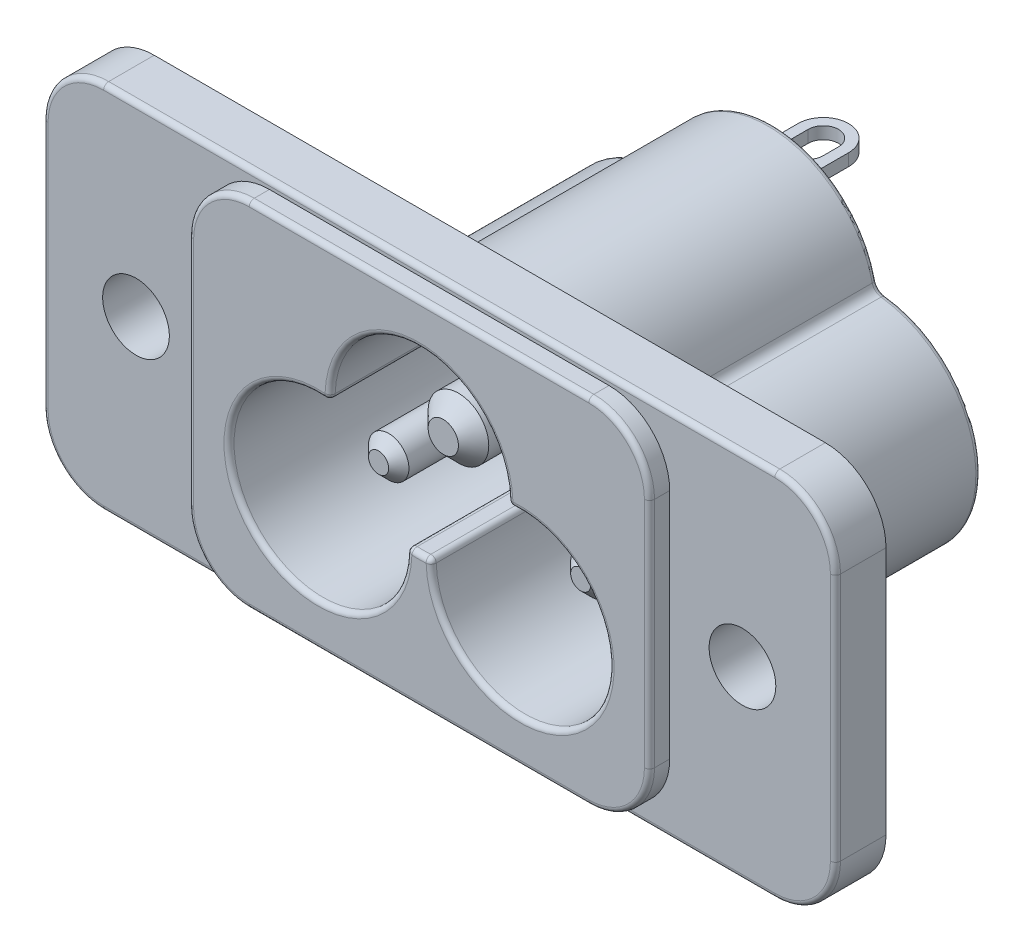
ISO-10303-21;
HEADER;
FILE_DESCRIPTION(('STEP AP214'),'2;1');
FILE_NAME('part.step','',(''),(''),'','','');
FILE_SCHEMA(('AUTOMOTIVE_DESIGN { 1 0 10303 214 1 1 1 1 }'));
ENDSEC;
DATA;
#1=APPLICATION_CONTEXT('core data for automotive mechanical design processes');
#2=APPLICATION_PROTOCOL_DEFINITION('international standard','automotive_design',2000,#1);
#3=PRODUCT_CONTEXT('',#1,'mechanical');
#4=PRODUCT('Part','Part','',(#3));
#5=PRODUCT_RELATED_PRODUCT_CATEGORY('part','',(#4));
#6=PRODUCT_DEFINITION_FORMATION('','',#4);
#7=PRODUCT_DEFINITION_CONTEXT('part definition',#1,'design');
#8=PRODUCT_DEFINITION('design','',#6,#7);
#9=PRODUCT_DEFINITION_SHAPE('','',#8);
#10=(LENGTH_UNIT() NAMED_UNIT(*) SI_UNIT(.MILLI.,.METRE.));
#11=(NAMED_UNIT(*) PLANE_ANGLE_UNIT() SI_UNIT($,.RADIAN.));
#12=(NAMED_UNIT(*) SI_UNIT($,.STERADIAN.) SOLID_ANGLE_UNIT());
#13=UNCERTAINTY_MEASURE_WITH_UNIT(LENGTH_MEASURE(1.E-05),#10,'distance_accuracy_value','');
#14=(GEOMETRIC_REPRESENTATION_CONTEXT(3) GLOBAL_UNCERTAINTY_ASSIGNED_CONTEXT((#13)) GLOBAL_UNIT_ASSIGNED_CONTEXT((#10,
#11,#12)) REPRESENTATION_CONTEXT('',''));
#15=CARTESIAN_POINT('',(0.,0.,0.));
#16=DIRECTION('',(0.,0.,1.));
#17=DIRECTION('',(1.,0.,0.));
#18=AXIS2_PLACEMENT_3D('',#15,#16,#17);
#19=CARTESIAN_POINT('',(17.1,9.15000000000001,-14.));
#20=DIRECTION('',(0.,0.,-1.));
#21=DIRECTION('',(-1.,0.,0.));
#22=AXIS2_PLACEMENT_3D('',#19,#20,#21);
#23=PLANE('',#22);
#24=DIRECTION('',(0.,1.,0.));
#25=VECTOR('',#24,1.);
#26=CARTESIAN_POINT('',(14.395985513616,3.19758289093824,-14.));
#27=LINE('',#26,#25);
#28=CARTESIAN_POINT('',(14.395985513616,3.19758289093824,-14.));
#29=VERTEX_POINT('',#28);
#30=CARTESIAN_POINT('',(14.395985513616,5.19758289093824,-14.));
#31=VERTEX_POINT('',#30);
#32=EDGE_CURVE('E725',#29,#31,#27,.T.);
#33=ORIENTED_EDGE('',*,*,#32,.T.);
#34=DIRECTION('',(-1.,0.,0.));
#35=VECTOR('',#34,1.);
#36=CARTESIAN_POINT('',(14.395985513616,5.19758289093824,-14.));
#37=LINE('',#36,#35);
#38=CARTESIAN_POINT('',(14.2164983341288,5.19758289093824,-14.));
#39=VERTEX_POINT('',#38);
#40=EDGE_CURVE('E694',#31,#39,#37,.T.);
#41=ORIENTED_EDGE('',*,*,#40,.T.);
#42=DIRECTION('',(0.,-1.,0.));
#43=VECTOR('',#42,1.);
#44=CARTESIAN_POINT('',(14.2164983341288,5.19758289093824,-14.));
#45=LINE('',#44,#43);
#46=CARTESIAN_POINT('',(14.2164983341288,3.40271109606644,-14.));
#47=VERTEX_POINT('',#46);
#48=EDGE_CURVE('E728',#39,#47,#45,.T.);
#49=ORIENTED_EDGE('',*,*,#48,.T.);
#50=DIRECTION('',(-1.,0.,0.));
#51=VECTOR('',#50,1.);
#52=CARTESIAN_POINT('',(14.2164983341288,3.40271109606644,-14.));
#53=LINE('',#52,#51);
#54=CARTESIAN_POINT('',(13.4472675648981,3.40271109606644,-14.));
#55=VERTEX_POINT('',#54);
#56=EDGE_CURVE('E730',#47,#55,#53,.T.);
#57=ORIENTED_EDGE('',*,*,#56,.T.);
#58=DIRECTION('',(0.,-1.,0.));
#59=VECTOR('',#58,1.);
#60=CARTESIAN_POINT('',(13.4472675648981,3.40271109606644,-14.));
#61=LINE('',#60,#59);
#62=CARTESIAN_POINT('',(13.4472675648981,3.19758289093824,-14.));
#63=VERTEX_POINT('',#62);
#64=EDGE_CURVE('E57',#55,#63,#61,.T.);
#65=ORIENTED_EDGE('',*,*,#64,.T.);
#66=DIRECTION('',(1.,0.,0.));
#67=VECTOR('',#66,1.);
#68=CARTESIAN_POINT('',(13.4472675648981,3.19758289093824,-14.));
#69=LINE('',#68,#67);
#70=EDGE_CURVE('E52',#63,#29,#69,.T.);
#71=ORIENTED_EDGE('',*,*,#70,.T.);
#72=EDGE_LOOP('',(#33,#41,#49,#57,#65,#71));
#73=FACE_BOUND('',#72,.T.);
#74=DIRECTION('',(1.,0.,0.));
#75=VECTOR('',#74,1.);
#76=CARTESIAN_POINT('',(25.4985496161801,3.19758289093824,-14.));
#77=LINE('',#76,#75);
#78=CARTESIAN_POINT('',(25.4985496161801,3.19758289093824,-14.));
#79=VERTEX_POINT('',#78);
#80=CARTESIAN_POINT('',(25.6780367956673,3.19758289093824,-14.));
#81=VERTEX_POINT('',#80);
#82=EDGE_CURVE('E734',#79,#81,#77,.T.);
#83=ORIENTED_EDGE('',*,*,#82,.T.);
#84=DIRECTION('',(0.,1.,0.));
#85=VECTOR('',#84,1.);
#86=CARTESIAN_POINT('',(25.6780367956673,3.19758289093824,-14.));
#87=LINE('',#86,#85);
#88=CARTESIAN_POINT('',(25.6780367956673,5.19758289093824,-14.));
#89=VERTEX_POINT('',#88);
#90=EDGE_CURVE('E777',#81,#89,#87,.T.);
#91=ORIENTED_EDGE('',*,*,#90,.T.);
#92=DIRECTION('',(-1.,0.,0.));
#93=VECTOR('',#92,1.);
#94=CARTESIAN_POINT('',(25.6780367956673,5.19758289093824,-14.));
#95=LINE('',#94,#93);
#96=CARTESIAN_POINT('',(25.640376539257,5.19758289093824,-14.));
#97=VERTEX_POINT('',#96);
#98=EDGE_CURVE('E779',#89,#97,#95,.T.);
#99=ORIENTED_EDGE('',*,*,#98,.T.);
#100=DIRECTION('',(-0.642922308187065,-0.765931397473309,0.));
#101=VECTOR('',#100,1.);
#102=CARTESIAN_POINT('',(25.640376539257,5.19758289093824,-14.));
#103=LINE('',#102,#101);
#104=CARTESIAN_POINT('',(24.3190624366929,3.62346430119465,-14.));
#105=VERTEX_POINT('',#104);
#106=EDGE_CURVE('E781',#97,#105,#103,.T.);
#107=ORIENTED_EDGE('',*,*,#106,.T.);
#108=DIRECTION('',(0.,1.,0.));
#109=VECTOR('',#108,1.);
#110=CARTESIAN_POINT('',(24.3190624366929,3.62346430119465,-14.));
#111=LINE('',#110,#109);
#112=CARTESIAN_POINT('',(24.3190624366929,5.19758289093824,-14.));
#113=VERTEX_POINT('',#112);
#114=EDGE_CURVE('E783',#105,#113,#111,.T.);
#115=ORIENTED_EDGE('',*,*,#114,.T.);
#116=DIRECTION('',(-1.,0.,0.));
#117=VECTOR('',#116,1.);
#118=CARTESIAN_POINT('',(24.3190624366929,5.19758289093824,-14.));
#119=LINE('',#118,#117);
#120=CARTESIAN_POINT('',(24.1395752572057,5.19758289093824,-14.));
#121=VERTEX_POINT('',#120);
#122=EDGE_CURVE('E785',#113,#121,#119,.T.);
#123=ORIENTED_EDGE('',*,*,#122,.T.);
#124=DIRECTION('',(0.,-1.,0.));
#125=VECTOR('',#124,1.);
#126=CARTESIAN_POINT('',(24.1395752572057,5.19758289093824,-14.));
#127=LINE('',#126,#125);
#128=CARTESIAN_POINT('',(24.1395752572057,3.19758289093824,-14.));
#129=VERTEX_POINT('',#128);
#130=EDGE_CURVE('E787',#121,#129,#127,.T.);
#131=ORIENTED_EDGE('',*,*,#130,.T.);
#132=DIRECTION('',(1.,0.,0.));
#133=VECTOR('',#132,1.);
#134=CARTESIAN_POINT('',(24.1395752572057,3.19758289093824,-14.));
#135=LINE('',#134,#133);
#136=CARTESIAN_POINT('',(24.1804406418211,3.19758289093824,-14.));
#137=VERTEX_POINT('',#136);
#138=EDGE_CURVE('E789',#129,#137,#135,.T.);
#139=ORIENTED_EDGE('',*,*,#138,.T.);
#140=DIRECTION('',(0.642871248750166,0.765974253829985,0.));
#141=VECTOR('',#140,1.);
#142=CARTESIAN_POINT('',(24.1804406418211,3.19758289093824,-14.));
#143=LINE('',#142,#141);
#144=CARTESIAN_POINT('',(25.4985496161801,4.76809571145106,-14.));
#145=VERTEX_POINT('',#144);
#146=EDGE_CURVE('E791',#137,#145,#143,.T.);
#147=ORIENTED_EDGE('',*,*,#146,.T.);
#148=DIRECTION('',(0.,-1.,0.));
#149=VECTOR('',#148,1.);
#150=CARTESIAN_POINT('',(25.4985496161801,4.76809571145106,-14.));
#151=LINE('',#150,#149);
#152=EDGE_CURVE('E748',#145,#79,#151,.T.);
#153=ORIENTED_EDGE('',*,*,#152,.T.);
#154=EDGE_LOOP('',(#83,#91,#99,#107,#115,#123,#131,#139,#147,#153));
#155=FACE_BOUND('',#154,.T.);
#156=DIRECTION('',(0.,1.,0.));
#157=VECTOR('',#156,1.);
#158=CARTESIAN_POINT('',(23.0441084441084,11.3436254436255,-14.));
#159=LINE('',#158,#157);
#160=CARTESIAN_POINT('',(23.0441084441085,11.3436254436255,-14.));
#161=VERTEX_POINT('',#160);
#162=CARTESIAN_POINT('',(23.0441084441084,13.3436254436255,-14.));
#163=VERTEX_POINT('',#162);
#164=EDGE_CURVE('E797',#161,#163,#159,.T.);
#165=ORIENTED_EDGE('',*,*,#164,.T.);
#166=DIRECTION('',(-1.,0.,0.));
#167=VECTOR('',#166,1.);
#168=CARTESIAN_POINT('',(23.0441084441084,13.3436254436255,-14.));
#169=LINE('',#168,#167);
#170=CARTESIAN_POINT('',(21.9159033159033,13.3436254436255,-14.));
#171=VERTEX_POINT('',#170);
#172=EDGE_CURVE('E863',#163,#171,#169,.T.);
#173=ORIENTED_EDGE('',*,*,#172,.T.);
#174=DIRECTION('',(0.,-1.,0.));
#175=VECTOR('',#174,1.);
#176=CARTESIAN_POINT('',(21.9159033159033,13.3436254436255,-14.));
#177=LINE('',#176,#175);
#178=CARTESIAN_POINT('',(21.9159033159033,13.1384972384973,-14.));
#179=VERTEX_POINT('',#178);
#180=EDGE_CURVE('E865',#171,#179,#177,.T.);
#181=ORIENTED_EDGE('',*,*,#180,.T.);
#182=DIRECTION('',(1.,0.,0.));
#183=VECTOR('',#182,1.);
#184=CARTESIAN_POINT('',(21.9159033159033,13.1384972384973,-14.));
#185=LINE('',#184,#183);
#186=CARTESIAN_POINT('',(22.8646212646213,13.1384972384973,-14.));
#187=VERTEX_POINT('',#186);
#188=EDGE_CURVE('E867',#179,#187,#185,.T.);
#189=ORIENTED_EDGE('',*,*,#188,.T.);
#190=DIRECTION('',(0.,-1.,0.));
#191=VECTOR('',#190,1.);
#192=CARTESIAN_POINT('',(22.8646212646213,13.1384972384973,-14.));
#193=LINE('',#192,#191);
#194=CARTESIAN_POINT('',(22.8646212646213,12.5231126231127,-14.));
#195=VERTEX_POINT('',#194);
#196=EDGE_CURVE('E869',#187,#195,#193,.T.);
#197=ORIENTED_EDGE('',*,*,#196,.T.);
#198=DIRECTION('',(-1.,0.,0.));
#199=VECTOR('',#198,1.);
#200=CARTESIAN_POINT('',(22.8646212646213,12.5231126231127,-14.));
#201=LINE('',#200,#199);
#202=CARTESIAN_POINT('',(21.9159033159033,12.5231126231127,-14.));
#203=VERTEX_POINT('',#202);
#204=EDGE_CURVE('E871',#195,#203,#201,.T.);
#205=ORIENTED_EDGE('',*,*,#204,.T.);
#206=DIRECTION('',(0.,-1.,0.));
#207=VECTOR('',#206,1.);
#208=CARTESIAN_POINT('',(21.9159033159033,12.5231126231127,-14.));
#209=LINE('',#208,#207);
#210=CARTESIAN_POINT('',(21.9159033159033,12.3179844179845,-14.));
#211=VERTEX_POINT('',#210);
#212=EDGE_CURVE('E873',#203,#211,#209,.T.);
#213=ORIENTED_EDGE('',*,*,#212,.T.);
#214=DIRECTION('',(1.,0.,0.));
#215=VECTOR('',#214,1.);
#216=CARTESIAN_POINT('',(21.9159033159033,12.3179844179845,-14.));
#217=LINE('',#216,#215);
#218=CARTESIAN_POINT('',(22.8646212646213,12.3179844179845,-14.));
#219=VERTEX_POINT('',#218);
#220=EDGE_CURVE('E875',#211,#219,#217,.T.);
#221=ORIENTED_EDGE('',*,*,#220,.T.);
#222=DIRECTION('',(0.,-1.,0.));
#223=VECTOR('',#222,1.);
#224=CARTESIAN_POINT('',(22.8646212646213,12.3179844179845,-14.));
#225=LINE('',#224,#223);
#226=CARTESIAN_POINT('',(22.8646212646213,11.5487536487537,-14.));
#227=VERTEX_POINT('',#226);
#228=EDGE_CURVE('E877',#219,#227,#225,.T.);
#229=ORIENTED_EDGE('',*,*,#228,.T.);
#230=DIRECTION('',(-1.,0.,0.));
#231=VECTOR('',#230,1.);
#232=CARTESIAN_POINT('',(22.8646212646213,11.5487536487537,-14.));
#233=LINE('',#232,#231);
#234=CARTESIAN_POINT('',(21.9159033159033,11.5487536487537,-14.));
#235=VERTEX_POINT('',#234);
#236=EDGE_CURVE('E879',#227,#235,#233,.T.);
#237=ORIENTED_EDGE('',*,*,#236,.T.);
#238=DIRECTION('',(0.,-1.,0.));
#239=VECTOR('',#238,1.);
#240=CARTESIAN_POINT('',(21.9159033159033,11.5487536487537,-14.));
#241=LINE('',#240,#239);
#242=CARTESIAN_POINT('',(21.9159033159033,11.3436254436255,-14.));
#243=VERTEX_POINT('',#242);
#244=EDGE_CURVE('E881',#235,#243,#241,.T.);
#245=ORIENTED_EDGE('',*,*,#244,.T.);
#246=DIRECTION('',(1.,0.,0.));
#247=VECTOR('',#246,1.);
#248=CARTESIAN_POINT('',(21.9159033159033,11.3436254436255,-14.));
#249=LINE('',#248,#247);
#250=EDGE_CURVE('E828',#243,#161,#249,.T.);
#251=ORIENTED_EDGE('',*,*,#250,.T.);
#252=EDGE_LOOP('',(#165,#173,#181,#189,#197,#205,#213,#221,#229,#237,#245,#251));
#253=FACE_BOUND('',#252,.T.);
#254=CARTESIAN_POINT('',(14.6,6.9,-14.));
#255=DIRECTION('',(0.,0.,-1.));
#256=DIRECTION('',(-1.,0.,0.));
#257=AXIS2_PLACEMENT_3D('',#254,#255,#256);
#258=CIRCLE('',#257,5.05);
#259=CARTESIAN_POINT('',(18.9534482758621,4.34070554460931,-14.));
#260=VERTEX_POINT('',#259);
#261=CARTESIAN_POINT('',(14.0244818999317,11.9170986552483,-14.));
#262=VERTEX_POINT('',#261);
#263=EDGE_CURVE('E1226',#260,#262,#258,.T.);
#264=ORIENTED_EDGE('',*,*,#263,.T.);
#265=CARTESIAN_POINT('',(13.9390089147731,12.6622123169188,-14.));
#266=DIRECTION('',(0.,0.,-1.));
#267=DIRECTION('',(-1.,0.,0.));
#268=AXIS2_PLACEMENT_3D('',#265,#266,#267);
#269=CIRCLE('',#268,0.75);
#270=CARTESIAN_POINT('',(14.6710336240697,12.4989952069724,-14.));
#271=VERTEX_POINT('',#270);
#272=EDGE_CURVE('E1228',#262,#271,#269,.F.);
#273=ORIENTED_EDGE('',*,*,#272,.T.);
#274=CARTESIAN_POINT('',(19.6,11.4,-14.));
#275=DIRECTION('',(0.,0.,-1.));
#276=DIRECTION('',(-1.,0.,0.));
#277=AXIS2_PLACEMENT_3D('',#274,#275,#276);
#278=CIRCLE('',#277,5.05);
#279=CARTESIAN_POINT('',(24.5289663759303,12.4989952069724,-14.));
#280=VERTEX_POINT('',#279);
#281=EDGE_CURVE('E1218',#271,#280,#278,.T.);
#282=ORIENTED_EDGE('',*,*,#281,.T.);
#283=CARTESIAN_POINT('',(25.2609910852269,12.6622123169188,-14.));
#284=DIRECTION('',(0.,0.,-1.));
#285=DIRECTION('',(-1.,0.,0.));
#286=AXIS2_PLACEMENT_3D('',#283,#284,#285);
#287=CIRCLE('',#286,0.75);
#288=CARTESIAN_POINT('',(25.1755181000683,11.9170986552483,-14.));
#289=VERTEX_POINT('',#288);
#290=EDGE_CURVE('E1220',#280,#289,#287,.F.);
#291=ORIENTED_EDGE('',*,*,#290,.T.);
#292=CARTESIAN_POINT('',(24.6,6.9,-14.));
#293=DIRECTION('',(0.,0.,-1.));
#294=DIRECTION('',(-1.,0.,0.));
#295=AXIS2_PLACEMENT_3D('',#292,#293,#294);
#296=CIRCLE('',#295,5.05);
#297=CARTESIAN_POINT('',(20.2465517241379,4.34070554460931,-14.));
#298=VERTEX_POINT('',#297);
#299=EDGE_CURVE('E1222',#289,#298,#296,.T.);
#300=ORIENTED_EDGE('',*,*,#299,.T.);
#301=CARTESIAN_POINT('',(19.6,3.96061230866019,-14.));
#302=DIRECTION('',(0.,0.,-1.));
#303=DIRECTION('',(-1.,0.,0.));
#304=AXIS2_PLACEMENT_3D('',#301,#302,#303);
#305=CIRCLE('',#304,0.75);
#306=EDGE_CURVE('E1224',#298,#260,#305,.F.);
#307=ORIENTED_EDGE('',*,*,#306,.T.);
#308=EDGE_LOOP('',(#264,#273,#282,#291,#300,#307));
#309=FACE_BOUND('',#308,.T.);
#310=DIRECTION('',(-1.,0.,0.));
#311=VECTOR('',#310,1.);
#312=CARTESIAN_POINT('',(20.85,14.2,-14.));
#313=LINE('',#312,#311);
#314=CARTESIAN_POINT('',(20.85,14.2,-14.));
#315=VERTEX_POINT('',#314);
#316=CARTESIAN_POINT('',(18.35,14.2,-14.));
#317=VERTEX_POINT('',#316);
#318=EDGE_CURVE('E969',#315,#317,#313,.T.);
#319=ORIENTED_EDGE('',*,*,#318,.F.);
#320=DIRECTION('',(0.,-1.,0.));
#321=VECTOR('',#320,1.);
#322=CARTESIAN_POINT('',(20.85,14.8,-14.));
#323=LINE('',#322,#321);
#324=CARTESIAN_POINT('',(20.85,14.8,-14.));
#325=VERTEX_POINT('',#324);
#326=EDGE_CURVE('E966',#325,#315,#323,.T.);
#327=ORIENTED_EDGE('',*,*,#326,.F.);
#328=DIRECTION('',(1.,0.,0.));
#329=VECTOR('',#328,1.);
#330=CARTESIAN_POINT('',(20.85,14.8,-14.));
#331=LINE('',#330,#329);
#332=CARTESIAN_POINT('',(18.35,14.8,-14.));
#333=VERTEX_POINT('',#332);
#334=EDGE_CURVE('E975',#333,#325,#331,.T.);
#335=ORIENTED_EDGE('',*,*,#334,.F.);
#336=DIRECTION('',(0.,1.,0.));
#337=VECTOR('',#336,1.);
#338=CARTESIAN_POINT('',(18.35,14.8,-14.));
#339=LINE('',#338,#337);
#340=EDGE_CURVE('E972',#317,#333,#339,.T.);
#341=ORIENTED_EDGE('',*,*,#340,.F.);
#342=EDGE_LOOP('',(#319,#327,#335,#341));
#343=FACE_BOUND('',#342,.T.);
#344=ADVANCED_FACE('F36',(#73,#155,#253,#309,#343),#23,.T.);
#345=CARTESIAN_POINT('',(19.6,3.96061230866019,-14.));
#346=DIRECTION('',(0.,0.,-1.));
#347=DIRECTION('',(-1.,0.,0.));
#348=AXIS2_PLACEMENT_3D('',#345,#346,#347);
#349=CYLINDRICAL_SURFACE('',#348,0.5);
#350=DIRECTION('',(0.,0.,1.));
#351=VECTOR('',#350,1.);
#352=CARTESIAN_POINT('',(20.0310344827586,4.21400779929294,-14.));
#353=LINE('',#352,#351);
#354=CARTESIAN_POINT('',(20.0310344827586,4.21400779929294,-11.2));
#355=VERTEX_POINT('',#354);
#356=CARTESIAN_POINT('',(20.0310344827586,4.21400779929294,-13.75));
#357=VERTEX_POINT('',#356);
#358=EDGE_CURVE('E1171',#355,#357,#353,.F.);
#359=ORIENTED_EDGE('',*,*,#358,.F.);
#360=CARTESIAN_POINT('',(19.6,3.96061230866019,-11.2));
#361=DIRECTION('',(0.,0.,-1.));
#362=DIRECTION('',(-1.,0.,0.));
#363=AXIS2_PLACEMENT_3D('',#360,#361,#362);
#364=CIRCLE('',#363,0.5);
#365=CARTESIAN_POINT('',(19.1689655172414,4.21400779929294,-11.2));
#366=VERTEX_POINT('',#365);
#367=EDGE_CURVE('E1033',#366,#355,#364,.T.);
#368=ORIENTED_EDGE('',*,*,#367,.F.);
#369=DIRECTION('',(0.,0.,1.));
#370=VECTOR('',#369,1.);
#371=CARTESIAN_POINT('',(19.1689655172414,4.21400779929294,-14.));
#372=LINE('',#371,#370);
#373=CARTESIAN_POINT('',(19.1689655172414,4.21400779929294,-13.75));
#374=VERTEX_POINT('',#373);
#375=EDGE_CURVE('E1165',#374,#366,#372,.T.);
#376=ORIENTED_EDGE('',*,*,#375,.F.);
#377=CARTESIAN_POINT('',(19.6,3.96061230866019,-13.75));
#378=DIRECTION('',(0.,0.,-1.));
#379=DIRECTION('',(-1.,0.,0.));
#380=AXIS2_PLACEMENT_3D('',#377,#378,#379);
#381=CIRCLE('',#380,0.5);
#382=EDGE_CURVE('E1204',#374,#357,#381,.T.);
#383=ORIENTED_EDGE('',*,*,#382,.T.);
#384=EDGE_LOOP('',(#359,#368,#376,#383));
#385=FACE_BOUND('',#384,.T.);
#386=ADVANCED_FACE('F1620',(#385),#349,.F.);
#387=CARTESIAN_POINT('',(24.6,6.9,2.3));
#388=DIRECTION('',(0.,0.,-1.));
#389=DIRECTION('',(-1.,0.,0.));
#390=AXIS2_PLACEMENT_3D('',#387,#388,#389);
#391=CYLINDRICAL_SURFACE('',#390,1.);
#392=CARTESIAN_POINT('',(24.6,6.9,0.));
#393=DIRECTION('',(0.,0.,1.));
#394=DIRECTION('',(1.,0.,0.));
#395=AXIS2_PLACEMENT_3D('',#392,#393,#394);
#396=CIRCLE('',#395,1.);
#397=CARTESIAN_POINT('',(25.6,6.9,0.));
#398=VERTEX_POINT('',#397);
#399=EDGE_CURVE('E1524',#398,#398,#396,.F.);
#400=ORIENTED_EDGE('',*,*,#399,.T.);
#401=EDGE_LOOP('',(#400));
#402=FACE_BOUND('',#401,.T.);
#403=CARTESIAN_POINT('',(24.6,6.9,-8.3));
#404=DIRECTION('',(0.,0.,1.));
#405=DIRECTION('',(1.,0.,0.));
#406=AXIS2_PLACEMENT_3D('',#403,#404,#405);
#407=CIRCLE('',#406,1.);
#408=CARTESIAN_POINT('',(25.6,6.9,-8.3));
#409=VERTEX_POINT('',#408);
#410=EDGE_CURVE('E1058',#409,#409,#407,.T.);
#411=ORIENTED_EDGE('',*,*,#410,.T.);
#412=EDGE_LOOP('',(#411));
#413=FACE_BOUND('',#412,.T.);
#414=ADVANCED_FACE('F1625',(#402,#413),#391,.T.);
#415=CARTESIAN_POINT('',(14.6,6.9,2.3));
#416=DIRECTION('',(0.,0.,-1.));
#417=DIRECTION('',(-1.,0.,0.));
#418=AXIS2_PLACEMENT_3D('',#415,#416,#417);
#419=CYLINDRICAL_SURFACE('',#418,1.);
#420=CARTESIAN_POINT('',(14.6,6.9,0.));
#421=DIRECTION('',(0.,0.,1.));
#422=DIRECTION('',(1.,0.,0.));
#423=AXIS2_PLACEMENT_3D('',#420,#421,#422);
#424=CIRCLE('',#423,1.);
#425=CARTESIAN_POINT('',(15.6,6.9,0.));
#426=VERTEX_POINT('',#425);
#427=EDGE_CURVE('E1518',#426,#426,#424,.F.);
#428=ORIENTED_EDGE('',*,*,#427,.T.);
#429=EDGE_LOOP('',(#428));
#430=FACE_BOUND('',#429,.T.);
#431=CARTESIAN_POINT('',(14.6,6.9,-8.3));
#432=DIRECTION('',(0.,0.,1.));
#433=DIRECTION('',(1.,0.,0.));
#434=AXIS2_PLACEMENT_3D('',#431,#432,#433);
#435=CIRCLE('',#434,1.);
#436=CARTESIAN_POINT('',(15.6,6.9,-8.3));
#437=VERTEX_POINT('',#436);
#438=EDGE_CURVE('E1064',#437,#437,#435,.T.);
#439=ORIENTED_EDGE('',*,*,#438,.T.);
#440=EDGE_LOOP('',(#439));
#441=FACE_BOUND('',#440,.T.);
#442=ADVANCED_FACE('F2487',(#430,#441),#419,.T.);
#443=CARTESIAN_POINT('',(22.1,9.15000000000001,-8.3));
#444=DIRECTION('',(0.,0.,1.));
#445=DIRECTION('',(1.,0.,0.));
#446=AXIS2_PLACEMENT_3D('',#443,#444,#445);
#447=PLANE('',#446);
#448=CARTESIAN_POINT('',(19.6,11.4,-8.3));
#449=DIRECTION('',(0.,0.,1.));
#450=DIRECTION('',(1.,0.,0.));
#451=AXIS2_PLACEMENT_3D('',#448,#449,#450);
#452=CIRCLE('',#451,1.5);
#453=CARTESIAN_POINT('',(21.1,11.4,-8.3));
#454=VERTEX_POINT('',#453);
#455=EDGE_CURVE('E1061',#454,#454,#452,.T.);
#456=ORIENTED_EDGE('',*,*,#455,.F.);
#457=EDGE_LOOP('',(#456));
#458=FACE_BOUND('',#457,.T.);
#459=CARTESIAN_POINT('',(14.9520085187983,11.5366572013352,-8.3));
#460=DIRECTION('',(0.,0.,1.));
#461=DIRECTION('',(1.,0.,0.));
#462=AXIS2_PLACEMENT_3D('',#459,#460,#461);
#463=CIRCLE('',#462,0.5);
#464=CARTESIAN_POINT('',(14.9141581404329,11.038091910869,-8.3));
#465=VERTEX_POINT('',#464);
#466=CARTESIAN_POINT('',(15.4517925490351,11.521962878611,-8.3));
#467=VERTEX_POINT('',#466);
#468=EDGE_CURVE('E1353',#465,#467,#463,.T.);
#469=ORIENTED_EDGE('',*,*,#468,.F.);
#470=CARTESIAN_POINT('',(14.6,6.9,-8.3));
#471=DIRECTION('',(0.,0.,1.));
#472=DIRECTION('',(1.,0.,0.));
#473=AXIS2_PLACEMENT_3D('',#470,#471,#472);
#474=CIRCLE('',#473,4.15);
#475=CARTESIAN_POINT('',(18.7482074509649,6.77803712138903,-8.3));
#476=VERTEX_POINT('',#475);
#477=EDGE_CURVE('E1359',#465,#476,#474,.T.);
#478=ORIENTED_EDGE('',*,*,#477,.T.);
#479=CARTESIAN_POINT('',(19.2479914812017,6.76334279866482,-8.3));
#480=DIRECTION('',(0.,0.,1.));
#481=DIRECTION('',(1.,0.,0.));
#482=AXIS2_PLACEMENT_3D('',#479,#480,#481);
#483=CIRCLE('',#482,0.5);
#484=CARTESIAN_POINT('',(19.2858418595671,7.26190808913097,-8.3));
#485=VERTEX_POINT('',#484);
#486=EDGE_CURVE('E1356',#485,#476,#483,.T.);
#487=ORIENTED_EDGE('',*,*,#486,.F.);
#488=CARTESIAN_POINT('',(19.6,11.4,-8.3));
#489=DIRECTION('',(0.,0.,1.));
#490=DIRECTION('',(1.,0.,0.));
#491=AXIS2_PLACEMENT_3D('',#488,#489,#490);
#492=CIRCLE('',#491,4.15);
#493=CARTESIAN_POINT('',(19.9141581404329,7.26190808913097,-8.3));
#494=VERTEX_POINT('',#493);
#495=EDGE_CURVE('E1350',#485,#494,#492,.T.);
#496=ORIENTED_EDGE('',*,*,#495,.T.);
#497=CARTESIAN_POINT('',(19.9520085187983,6.76334279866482,-8.3));
#498=DIRECTION('',(0.,0.,1.));
#499=DIRECTION('',(1.,0.,0.));
#500=AXIS2_PLACEMENT_3D('',#497,#498,#499);
#501=CIRCLE('',#500,0.5);
#502=CARTESIAN_POINT('',(20.4517925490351,6.77803712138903,-8.3));
#503=VERTEX_POINT('',#502);
#504=EDGE_CURVE('E1347',#503,#494,#501,.T.);
#505=ORIENTED_EDGE('',*,*,#504,.F.);
#506=CARTESIAN_POINT('',(24.6,6.9,-8.3));
#507=DIRECTION('',(0.,0.,1.));
#508=DIRECTION('',(1.,0.,0.));
#509=AXIS2_PLACEMENT_3D('',#506,#507,#508);
#510=CIRCLE('',#509,4.15);
#511=CARTESIAN_POINT('',(24.2858418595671,11.038091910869,-8.3));
#512=VERTEX_POINT('',#511);
#513=EDGE_CURVE('E1343',#503,#512,#510,.T.);
#514=ORIENTED_EDGE('',*,*,#513,.T.);
#515=CARTESIAN_POINT('',(24.2479914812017,11.5366572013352,-8.3));
#516=DIRECTION('',(0.,0.,1.));
#517=DIRECTION('',(1.,0.,0.));
#518=AXIS2_PLACEMENT_3D('',#515,#516,#517);
#519=CIRCLE('',#518,0.5);
#520=CARTESIAN_POINT('',(23.7482074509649,11.521962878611,-8.3));
#521=VERTEX_POINT('',#520);
#522=EDGE_CURVE('E1340',#521,#512,#519,.T.);
#523=ORIENTED_EDGE('',*,*,#522,.F.);
#524=CARTESIAN_POINT('',(19.6,11.4,-8.3));
#525=DIRECTION('',(0.,0.,1.));
#526=DIRECTION('',(1.,0.,0.));
#527=AXIS2_PLACEMENT_3D('',#524,#525,#526);
#528=CIRCLE('',#527,4.15);
#529=EDGE_CURVE('E1345',#521,#467,#528,.T.);
#530=ORIENTED_EDGE('',*,*,#529,.T.);
#531=EDGE_LOOP('',(#469,#478,#487,#496,#505,#514,#523,#530));
#532=FACE_BOUND('',#531,.T.);
#533=ORIENTED_EDGE('',*,*,#438,.F.);
#534=EDGE_LOOP('',(#533));
#535=FACE_BOUND('',#534,.T.);
#536=ORIENTED_EDGE('',*,*,#410,.F.);
#537=EDGE_LOOP('',(#536));
#538=FACE_BOUND('',#537,.T.);
#539=ADVANCED_FACE('F1699',(#458,#532,#535,#538),#447,.T.);
#540=CARTESIAN_POINT('',(36.2,15.3,0.));
#541=DIRECTION('',(0.,0.,1.));
#542=DIRECTION('',(1.,0.,0.));
#543=AXIS2_PLACEMENT_3D('',#540,#541,#542);
#544=PLANE('',#543);
#545=CARTESIAN_POINT('',(19.6,11.4,0.));
#546=DIRECTION('',(0.,0.,1.));
#547=DIRECTION('',(1.,0.,0.));
#548=AXIS2_PLACEMENT_3D('',#545,#546,#547);
#549=CIRCLE('',#548,5.55);
#550=CARTESIAN_POINT('',(25.0169828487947,12.6078066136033,0.));
#551=VERTEX_POINT('',#550);
#552=CARTESIAN_POINT('',(14.1830171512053,12.6078066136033,0.));
#553=VERTEX_POINT('',#552);
#554=EDGE_CURVE('E1181',#551,#553,#549,.T.);
#555=ORIENTED_EDGE('',*,*,#554,.T.);
#556=CARTESIAN_POINT('',(13.9390089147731,12.6622123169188,0.));
#557=DIRECTION('',(0.,0.,1.));
#558=DIRECTION('',(1.,0.,0.));
#559=AXIS2_PLACEMENT_3D('',#556,#557,#558);
#560=CIRCLE('',#559,0.25);
#561=CARTESIAN_POINT('',(13.967499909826,12.4138410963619,0.));
#562=VERTEX_POINT('',#561);
#563=EDGE_CURVE('E1191',#553,#562,#560,.F.);
#564=ORIENTED_EDGE('',*,*,#563,.T.);
#565=CARTESIAN_POINT('',(14.6,6.9,0.));
#566=DIRECTION('',(0.,0.,1.));
#567=DIRECTION('',(1.,0.,0.));
#568=AXIS2_PLACEMENT_3D('',#565,#566,#567);
#569=CIRCLE('',#568,5.55);
#570=CARTESIAN_POINT('',(19.3844827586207,4.08731005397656,0.));
#571=VERTEX_POINT('',#570);
#572=EDGE_CURVE('E1189',#562,#571,#569,.T.);
#573=ORIENTED_EDGE('',*,*,#572,.T.);
#574=CARTESIAN_POINT('',(19.6,3.96061230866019,0.));
#575=DIRECTION('',(0.,0.,1.));
#576=DIRECTION('',(1.,0.,0.));
#577=AXIS2_PLACEMENT_3D('',#574,#575,#576);
#578=CIRCLE('',#577,0.25);
#579=CARTESIAN_POINT('',(19.8155172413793,4.08731005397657,0.));
#580=VERTEX_POINT('',#579);
#581=EDGE_CURVE('E1187',#571,#580,#578,.F.);
#582=ORIENTED_EDGE('',*,*,#581,.T.);
#583=CARTESIAN_POINT('',(24.6,6.9,0.));
#584=DIRECTION('',(0.,0.,1.));
#585=DIRECTION('',(1.,0.,0.));
#586=AXIS2_PLACEMENT_3D('',#583,#584,#585);
#587=CIRCLE('',#586,5.55);
#588=CARTESIAN_POINT('',(25.232500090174,12.4138410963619,0.));
#589=VERTEX_POINT('',#588);
#590=EDGE_CURVE('E1185',#580,#589,#587,.T.);
#591=ORIENTED_EDGE('',*,*,#590,.T.);
#592=CARTESIAN_POINT('',(25.2609910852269,12.6622123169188,0.));
#593=DIRECTION('',(0.,0.,1.));
#594=DIRECTION('',(1.,0.,0.));
#595=AXIS2_PLACEMENT_3D('',#592,#593,#594);
#596=CIRCLE('',#595,0.25);
#597=EDGE_CURVE('E1183',#589,#551,#596,.F.);
#598=ORIENTED_EDGE('',*,*,#597,.T.);
#599=EDGE_LOOP('',(#555,#564,#573,#582,#591,#598));
#600=FACE_BOUND('',#599,.T.);
#601=CARTESIAN_POINT('',(34.6,9.15,0.));
#602=DIRECTION('',(0.,0.,1.));
#603=DIRECTION('',(1.,0.,0.));
#604=AXIS2_PLACEMENT_3D('',#601,#602,#603);
#605=CIRCLE('',#604,1.65);
#606=CARTESIAN_POINT('',(36.25,9.15,0.));
#607=VERTEX_POINT('',#606);
#608=EDGE_CURVE('E1109',#607,#607,#605,.T.);
#609=ORIENTED_EDGE('',*,*,#608,.T.);
#610=EDGE_LOOP('',(#609));
#611=FACE_BOUND('',#610,.T.);
#612=CARTESIAN_POINT('',(36.2,15.3,0.));
#613=DIRECTION('',(0.,0.,1.));
#614=DIRECTION('',(1.,0.,0.));
#615=AXIS2_PLACEMENT_3D('',#612,#613,#614);
#616=CIRCLE('',#615,3.);
#617=CARTESIAN_POINT('',(39.2,15.3,0.));
#618=VERTEX_POINT('',#617);
#619=CARTESIAN_POINT('',(36.2,18.3,0.));
#620=VERTEX_POINT('',#619);
#621=EDGE_CURVE('E1119',#618,#620,#616,.T.);
#622=ORIENTED_EDGE('',*,*,#621,.F.);
#623=DIRECTION('',(0.,1.,0.));
#624=VECTOR('',#623,1.);
#625=CARTESIAN_POINT('',(39.2,3.00000000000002,0.));
#626=LINE('',#625,#624);
#627=CARTESIAN_POINT('',(39.2,3.00000000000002,0.));
#628=VERTEX_POINT('',#627);
#629=EDGE_CURVE('E1142',#628,#618,#626,.T.);
#630=ORIENTED_EDGE('',*,*,#629,.F.);
#631=CARTESIAN_POINT('',(36.2,3.,0.));
#632=DIRECTION('',(0.,0.,1.));
#633=DIRECTION('',(1.,0.,0.));
#634=AXIS2_PLACEMENT_3D('',#631,#632,#633);
#635=CIRCLE('',#634,3.);
#636=CARTESIAN_POINT('',(36.2,0.,0.));
#637=VERTEX_POINT('',#636);
#638=EDGE_CURVE('E1139',#637,#628,#635,.T.);
#639=ORIENTED_EDGE('',*,*,#638,.F.);
#640=DIRECTION('',(1.,0.,0.));
#641=VECTOR('',#640,1.);
#642=CARTESIAN_POINT('',(3.00000000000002,0.,0.));
#643=LINE('',#642,#641);
#644=CARTESIAN_POINT('',(3.00000000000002,0.,0.));
#645=VERTEX_POINT('',#644);
#646=EDGE_CURVE('E1136',#645,#637,#643,.T.);
#647=ORIENTED_EDGE('',*,*,#646,.F.);
#648=CARTESIAN_POINT('',(3.,3.,0.));
#649=DIRECTION('',(0.,0.,1.));
#650=DIRECTION('',(1.,0.,0.));
#651=AXIS2_PLACEMENT_3D('',#648,#649,#650);
#652=CIRCLE('',#651,3.);
#653=CARTESIAN_POINT('',(0.,3.00000000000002,0.));
#654=VERTEX_POINT('',#653);
#655=EDGE_CURVE('E1133',#654,#645,#652,.T.);
#656=ORIENTED_EDGE('',*,*,#655,.F.);
#657=DIRECTION('',(0.,-1.,0.));
#658=VECTOR('',#657,1.);
#659=CARTESIAN_POINT('',(0.,3.00000000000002,0.));
#660=LINE('',#659,#658);
#661=CARTESIAN_POINT('',(0.,15.3,0.));
#662=VERTEX_POINT('',#661);
#663=EDGE_CURVE('E1130',#662,#654,#660,.T.);
#664=ORIENTED_EDGE('',*,*,#663,.F.);
#665=CARTESIAN_POINT('',(3.,15.3,0.));
#666=DIRECTION('',(0.,0.,1.));
#667=DIRECTION('',(-1.,0.,0.));
#668=AXIS2_PLACEMENT_3D('',#665,#666,#667);
#669=CIRCLE('',#668,3.);
#670=CARTESIAN_POINT('',(2.99999999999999,18.3,0.));
#671=VERTEX_POINT('',#670);
#672=EDGE_CURVE('E1127',#671,#662,#669,.T.);
#673=ORIENTED_EDGE('',*,*,#672,.F.);
#674=DIRECTION('',(-1.,0.,0.));
#675=VECTOR('',#674,1.);
#676=CARTESIAN_POINT('',(2.99999999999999,18.3,0.));
#677=LINE('',#676,#675);
#678=EDGE_CURVE('E1124',#620,#671,#677,.T.);
#679=ORIENTED_EDGE('',*,*,#678,.F.);
#680=EDGE_LOOP('',(#622,#630,#639,#647,#656,#664,#673,#679));
#681=FACE_BOUND('',#680,.T.);
#682=CARTESIAN_POINT('',(4.6,9.15,0.));
#683=DIRECTION('',(0.,0.,1.));
#684=DIRECTION('',(1.,0.,0.));
#685=AXIS2_PLACEMENT_3D('',#682,#683,#684);
#686=CIRCLE('',#685,1.65);
#687=CARTESIAN_POINT('',(6.25,9.15,0.));
#688=VERTEX_POINT('',#687);
#689=EDGE_CURVE('E1113',#688,#688,#686,.T.);
#690=ORIENTED_EDGE('',*,*,#689,.T.);
#691=EDGE_LOOP('',(#690));
#692=FACE_BOUND('',#691,.T.);
#693=ADVANCED_FACE('F1695',(#600,#611,#681,#692),#544,.F.);
#694=CARTESIAN_POINT('',(36.2,15.3,2.5));
#695=DIRECTION('',(0.,0.,1.));
#696=DIRECTION('',(1.,0.,0.));
#697=AXIS2_PLACEMENT_3D('',#694,#695,#696);
#698=PLANE('',#697);
#699=DIRECTION('',(0.,1.,0.));
#700=VECTOR('',#699,1.);
#701=CARTESIAN_POINT('',(38.95,15.3,2.5));
#702=LINE('',#701,#700);
#703=CARTESIAN_POINT('',(38.95,3.00000000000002,2.5));
#704=VERTEX_POINT('',#703);
#705=CARTESIAN_POINT('',(38.95,15.3,2.5));
#706=VERTEX_POINT('',#705);
#707=EDGE_CURVE('E1284',#704,#706,#702,.T.);
#708=ORIENTED_EDGE('',*,*,#707,.T.);
#709=CARTESIAN_POINT('',(36.2,15.3,2.5));
#710=DIRECTION('',(0.,0.,1.));
#711=DIRECTION('',(1.,0.,0.));
#712=AXIS2_PLACEMENT_3D('',#709,#710,#711);
#713=CIRCLE('',#712,2.75);
#714=CARTESIAN_POINT('',(36.2,18.05,2.5));
#715=VERTEX_POINT('',#714);
#716=EDGE_CURVE('E1286',#706,#715,#713,.T.);
#717=ORIENTED_EDGE('',*,*,#716,.T.);
#718=DIRECTION('',(-1.,0.,0.));
#719=VECTOR('',#718,1.);
#720=CARTESIAN_POINT('',(3.,18.05,2.5));
#721=LINE('',#720,#719);
#722=CARTESIAN_POINT('',(2.99999999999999,18.05,2.5));
#723=VERTEX_POINT('',#722);
#724=EDGE_CURVE('E1272',#715,#723,#721,.T.);
#725=ORIENTED_EDGE('',*,*,#724,.T.);
#726=CARTESIAN_POINT('',(3.,15.3,2.5));
#727=DIRECTION('',(0.,0.,1.));
#728=DIRECTION('',(1.,0.,0.));
#729=AXIS2_PLACEMENT_3D('',#726,#727,#728);
#730=CIRCLE('',#729,2.75);
#731=CARTESIAN_POINT('',(0.249999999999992,15.3,2.5));
#732=VERTEX_POINT('',#731);
#733=EDGE_CURVE('E1274',#723,#732,#730,.T.);
#734=ORIENTED_EDGE('',*,*,#733,.T.);
#735=DIRECTION('',(0.,-1.,0.));
#736=VECTOR('',#735,1.);
#737=CARTESIAN_POINT('',(0.25,3.00000000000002,2.5));
#738=LINE('',#737,#736);
#739=CARTESIAN_POINT('',(0.25,3.00000000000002,2.5));
#740=VERTEX_POINT('',#739);
#741=EDGE_CURVE('E1276',#732,#740,#738,.T.);
#742=ORIENTED_EDGE('',*,*,#741,.T.);
#743=CARTESIAN_POINT('',(3.,3.,2.5));
#744=DIRECTION('',(0.,0.,1.));
#745=DIRECTION('',(1.,0.,0.));
#746=AXIS2_PLACEMENT_3D('',#743,#744,#745);
#747=CIRCLE('',#746,2.75);
#748=CARTESIAN_POINT('',(3.00000000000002,0.25,2.5));
#749=VERTEX_POINT('',#748);
#750=EDGE_CURVE('E1278',#740,#749,#747,.T.);
#751=ORIENTED_EDGE('',*,*,#750,.T.);
#752=DIRECTION('',(1.,0.,0.));
#753=VECTOR('',#752,1.);
#754=CARTESIAN_POINT('',(36.2,0.25,2.5));
#755=LINE('',#754,#753);
#756=CARTESIAN_POINT('',(36.2,0.25,2.5));
#757=VERTEX_POINT('',#756);
#758=EDGE_CURVE('E1280',#749,#757,#755,.T.);
#759=ORIENTED_EDGE('',*,*,#758,.T.);
#760=CARTESIAN_POINT('',(36.2,3.,2.5));
#761=DIRECTION('',(0.,0.,1.));
#762=DIRECTION('',(1.,0.,0.));
#763=AXIS2_PLACEMENT_3D('',#760,#761,#762);
#764=CIRCLE('',#763,2.75);
#765=EDGE_CURVE('E1282',#757,#704,#764,.T.);
#766=ORIENTED_EDGE('',*,*,#765,.T.);
#767=EDGE_LOOP('',(#708,#717,#725,#734,#742,#751,#759,#766));
#768=FACE_BOUND('',#767,.T.);
#769=CARTESIAN_POINT('',(34.6,9.15,2.5));
#770=DIRECTION('',(0.,0.,1.));
#771=DIRECTION('',(1.,0.,0.));
#772=AXIS2_PLACEMENT_3D('',#769,#770,#771);
#773=CIRCLE('',#772,1.65);
#774=CARTESIAN_POINT('',(36.25,9.15,2.5));
#775=VERTEX_POINT('',#774);
#776=EDGE_CURVE('E1110',#775,#775,#773,.T.);
#777=ORIENTED_EDGE('',*,*,#776,.F.);
#778=EDGE_LOOP('',(#777));
#779=FACE_BOUND('',#778,.T.);
#780=CARTESIAN_POINT('',(4.6,9.15,2.5));
#781=DIRECTION('',(0.,0.,1.));
#782=DIRECTION('',(1.,0.,0.));
#783=AXIS2_PLACEMENT_3D('',#780,#781,#782);
#784=CIRCLE('',#783,1.65);
#785=CARTESIAN_POINT('',(6.25,9.15,2.5));
#786=VERTEX_POINT('',#785);
#787=EDGE_CURVE('E1116',#786,#786,#784,.T.);
#788=ORIENTED_EDGE('',*,*,#787,.F.);
#789=EDGE_LOOP('',(#788));
#790=FACE_BOUND('',#789,.T.);
#791=DIRECTION('',(0.,-1.,0.));
#792=VECTOR('',#791,1.);
#793=CARTESIAN_POINT('',(8.2,14.9,2.5));
#794=LINE('',#793,#792);
#795=CARTESIAN_POINT('',(8.2,14.9,2.5));
#796=VERTEX_POINT('',#795);
#797=CARTESIAN_POINT('',(8.2,3.4,2.5));
#798=VERTEX_POINT('',#797);
#799=EDGE_CURVE('E1071',#796,#798,#794,.T.);
#800=ORIENTED_EDGE('',*,*,#799,.F.);
#801=CARTESIAN_POINT('',(11.2,14.9,2.5));
#802=DIRECTION('',(0.,0.,1.));
#803=DIRECTION('',(-1.,0.,0.));
#804=AXIS2_PLACEMENT_3D('',#801,#802,#803);
#805=CIRCLE('',#804,3.);
#806=CARTESIAN_POINT('',(11.2,17.9,2.5));
#807=VERTEX_POINT('',#806);
#808=EDGE_CURVE('E1068',#807,#796,#805,.T.);
#809=ORIENTED_EDGE('',*,*,#808,.F.);
#810=DIRECTION('',(-1.,0.,0.));
#811=VECTOR('',#810,1.);
#812=CARTESIAN_POINT('',(11.2,17.9,2.5));
#813=LINE('',#812,#811);
#814=CARTESIAN_POINT('',(28.,17.9,2.5));
#815=VERTEX_POINT('',#814);
#816=EDGE_CURVE('E1090',#815,#807,#813,.T.);
#817=ORIENTED_EDGE('',*,*,#816,.F.);
#818=CARTESIAN_POINT('',(28.,14.9,2.5));
#819=DIRECTION('',(0.,0.,1.));
#820=DIRECTION('',(1.,0.,0.));
#821=AXIS2_PLACEMENT_3D('',#818,#819,#820);
#822=CIRCLE('',#821,3.);
#823=CARTESIAN_POINT('',(31.,14.9,2.5));
#824=VERTEX_POINT('',#823);
#825=EDGE_CURVE('E1087',#824,#815,#822,.T.);
#826=ORIENTED_EDGE('',*,*,#825,.F.);
#827=DIRECTION('',(0.,1.,0.));
#828=VECTOR('',#827,1.);
#829=CARTESIAN_POINT('',(31.,14.9,2.5));
#830=LINE('',#829,#828);
#831=CARTESIAN_POINT('',(31.,3.4,2.5));
#832=VERTEX_POINT('',#831);
#833=EDGE_CURVE('E1084',#832,#824,#830,.T.);
#834=ORIENTED_EDGE('',*,*,#833,.F.);
#835=CARTESIAN_POINT('',(28.,3.4,2.5));
#836=DIRECTION('',(0.,0.,1.));
#837=DIRECTION('',(-1.,0.,0.));
#838=AXIS2_PLACEMENT_3D('',#835,#836,#837);
#839=CIRCLE('',#838,3.);
#840=CARTESIAN_POINT('',(28.,0.399999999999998,2.5));
#841=VERTEX_POINT('',#840);
#842=EDGE_CURVE('E1081',#841,#832,#839,.T.);
#843=ORIENTED_EDGE('',*,*,#842,.F.);
#844=DIRECTION('',(1.,0.,0.));
#845=VECTOR('',#844,1.);
#846=CARTESIAN_POINT('',(11.2,0.399999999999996,2.5));
#847=LINE('',#846,#845);
#848=CARTESIAN_POINT('',(11.2,0.399999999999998,2.5));
#849=VERTEX_POINT('',#848);
#850=EDGE_CURVE('E1078',#849,#841,#847,.T.);
#851=ORIENTED_EDGE('',*,*,#850,.F.);
#852=CARTESIAN_POINT('',(11.2,3.4,2.5));
#853=DIRECTION('',(0.,0.,1.));
#854=DIRECTION('',(-1.,0.,0.));
#855=AXIS2_PLACEMENT_3D('',#852,#853,#854);
#856=CIRCLE('',#855,3.);
#857=EDGE_CURVE('E1075',#798,#849,#856,.T.);
#858=ORIENTED_EDGE('',*,*,#857,.F.);
#859=EDGE_LOOP('',(#800,#809,#817,#826,#834,#843,#851,#858));
#860=FACE_BOUND('',#859,.T.);
#861=ADVANCED_FACE('F1691',(#768,#779,#790,#860),#698,.T.);
#862=CARTESIAN_POINT('',(36.2,15.3,2.5));
#863=DIRECTION('',(0.,0.,-1.));
#864=DIRECTION('',(-1.,0.,0.));
#865=AXIS2_PLACEMENT_3D('',#862,#863,#864);
#866=CYLINDRICAL_SURFACE('',#865,3.);
#867=DIRECTION('',(0.,0.,-1.));
#868=VECTOR('',#867,1.);
#869=CARTESIAN_POINT('',(36.2,18.3,2.5));
#870=LINE('',#869,#868);
#871=CARTESIAN_POINT('',(36.2,18.3,2.25));
#872=VERTEX_POINT('',#871);
#873=EDGE_CURVE('E1159',#872,#620,#870,.T.);
#874=ORIENTED_EDGE('',*,*,#873,.F.);
#875=CARTESIAN_POINT('',(36.2,15.3,2.25));
#876=DIRECTION('',(0.,0.,1.));
#877=DIRECTION('',(1.,0.,0.));
#878=AXIS2_PLACEMENT_3D('',#875,#876,#877);
#879=CIRCLE('',#878,3.);
#880=CARTESIAN_POINT('',(39.2,15.3,2.25));
#881=VERTEX_POINT('',#880);
#882=EDGE_CURVE('E1289',#872,#881,#879,.F.);
#883=ORIENTED_EDGE('',*,*,#882,.T.);
#884=DIRECTION('',(0.,0.,-1.));
#885=VECTOR('',#884,1.);
#886=CARTESIAN_POINT('',(39.2,15.3,2.5));
#887=LINE('',#886,#885);
#888=EDGE_CURVE('E1145',#881,#618,#887,.T.);
#889=ORIENTED_EDGE('',*,*,#888,.T.);
#890=ORIENTED_EDGE('',*,*,#621,.T.);
#891=EDGE_LOOP('',(#874,#883,#889,#890));
#892=FACE_BOUND('',#891,.T.);
#893=ADVANCED_FACE('F1694',(#892),#866,.T.);
#894=CARTESIAN_POINT('',(2.99999999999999,18.3,2.5));
#895=DIRECTION('',(0.,-1.,0.));
#896=DIRECTION('',(1.,0.,0.));
#897=AXIS2_PLACEMENT_3D('',#894,#895,#896);
#898=PLANE('',#897);
#899=DIRECTION('',(0.,0.,-1.));
#900=VECTOR('',#899,1.);
#901=CARTESIAN_POINT('',(2.99999999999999,18.3,2.5));
#902=LINE('',#901,#900);
#903=CARTESIAN_POINT('',(2.99999999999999,18.3,2.25));
#904=VERTEX_POINT('',#903);
#905=EDGE_CURVE('E1157',#904,#671,#902,.T.);
#906=ORIENTED_EDGE('',*,*,#905,.F.);
#907=DIRECTION('',(-1.,0.,0.));
#908=VECTOR('',#907,1.);
#909=CARTESIAN_POINT('',(36.2,18.3,2.25));
#910=LINE('',#909,#908);
#911=EDGE_CURVE('E1367',#904,#872,#910,.F.);
#912=ORIENTED_EDGE('',*,*,#911,.T.);
#913=ORIENTED_EDGE('',*,*,#873,.T.);
#914=ORIENTED_EDGE('',*,*,#678,.T.);
#915=EDGE_LOOP('',(#906,#912,#913,#914));
#916=FACE_BOUND('',#915,.T.);
#917=ADVANCED_FACE('F1723',(#916),#898,.F.);
#918=CARTESIAN_POINT('',(3.,15.3,2.5));
#919=DIRECTION('',(0.,0.,-1.));
#920=DIRECTION('',(-1.,0.,0.));
#921=AXIS2_PLACEMENT_3D('',#918,#919,#920);
#922=CYLINDRICAL_SURFACE('',#921,3.);
#923=DIRECTION('',(0.,0.,-1.));
#924=VECTOR('',#923,1.);
#925=CARTESIAN_POINT('',(0.,15.3,2.5));
#926=LINE('',#925,#924);
#927=CARTESIAN_POINT('',(0.,15.3,2.25));
#928=VERTEX_POINT('',#927);
#929=EDGE_CURVE('E1155',#928,#662,#926,.T.);
#930=ORIENTED_EDGE('',*,*,#929,.F.);
#931=CARTESIAN_POINT('',(3.,15.3,2.25));
#932=DIRECTION('',(0.,0.,1.));
#933=DIRECTION('',(1.,0.,0.));
#934=AXIS2_PLACEMENT_3D('',#931,#932,#933);
#935=CIRCLE('',#934,3.);
#936=EDGE_CURVE('E1302',#928,#904,#935,.F.);
#937=ORIENTED_EDGE('',*,*,#936,.T.);
#938=ORIENTED_EDGE('',*,*,#905,.T.);
#939=ORIENTED_EDGE('',*,*,#672,.T.);
#940=EDGE_LOOP('',(#930,#937,#938,#939));
#941=FACE_BOUND('',#940,.T.);
#942=ADVANCED_FACE('F1719',(#941),#922,.T.);
#943=CARTESIAN_POINT('',(0.,3.00000000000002,2.5));
#944=DIRECTION('',(1.,0.,0.));
#945=DIRECTION('',(0.,1.,0.));
#946=AXIS2_PLACEMENT_3D('',#943,#944,#945);
#947=PLANE('',#946);
#948=DIRECTION('',(0.,0.,-1.));
#949=VECTOR('',#948,1.);
#950=CARTESIAN_POINT('',(0.,3.00000000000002,2.5));
#951=LINE('',#950,#949);
#952=CARTESIAN_POINT('',(0.,3.00000000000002,2.25));
#953=VERTEX_POINT('',#952);
#954=EDGE_CURVE('E1153',#953,#654,#951,.T.);
#955=ORIENTED_EDGE('',*,*,#954,.F.);
#956=DIRECTION('',(0.,-1.,0.));
#957=VECTOR('',#956,1.);
#958=CARTESIAN_POINT('',(0.,15.3,2.25));
#959=LINE('',#958,#957);
#960=EDGE_CURVE('E1300',#953,#928,#959,.F.);
#961=ORIENTED_EDGE('',*,*,#960,.T.);
#962=ORIENTED_EDGE('',*,*,#929,.T.);
#963=ORIENTED_EDGE('',*,*,#663,.T.);
#964=EDGE_LOOP('',(#955,#961,#962,#963));
#965=FACE_BOUND('',#964,.T.);
#966=ADVANCED_FACE('F1715',(#965),#947,.F.);
#967=CARTESIAN_POINT('',(3.,3.,2.5));
#968=DIRECTION('',(0.,0.,-1.));
#969=DIRECTION('',(-1.,0.,0.));
#970=AXIS2_PLACEMENT_3D('',#967,#968,#969);
#971=CYLINDRICAL_SURFACE('',#970,3.);
#972=DIRECTION('',(0.,0.,-1.));
#973=VECTOR('',#972,1.);
#974=CARTESIAN_POINT('',(3.00000000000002,0.,2.5));
#975=LINE('',#974,#973);
#976=CARTESIAN_POINT('',(3.00000000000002,0.,2.25));
#977=VERTEX_POINT('',#976);
#978=EDGE_CURVE('E1151',#977,#645,#975,.T.);
#979=ORIENTED_EDGE('',*,*,#978,.F.);
#980=CARTESIAN_POINT('',(3.,3.,2.25));
#981=DIRECTION('',(0.,0.,1.));
#982=DIRECTION('',(1.,0.,0.));
#983=AXIS2_PLACEMENT_3D('',#980,#981,#982);
#984=CIRCLE('',#983,3.);
#985=EDGE_CURVE('E1298',#977,#953,#984,.F.);
#986=ORIENTED_EDGE('',*,*,#985,.T.);
#987=ORIENTED_EDGE('',*,*,#954,.T.);
#988=ORIENTED_EDGE('',*,*,#655,.T.);
#989=EDGE_LOOP('',(#979,#986,#987,#988));
#990=FACE_BOUND('',#989,.T.);
#991=ADVANCED_FACE('F1711',(#990),#971,.T.);
#992=CARTESIAN_POINT('',(3.00000000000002,0.,2.5));
#993=DIRECTION('',(0.,1.,0.));
#994=DIRECTION('',(0.,0.,1.));
#995=AXIS2_PLACEMENT_3D('',#992,#993,#994);
#996=PLANE('',#995);
#997=DIRECTION('',(0.,0.,-1.));
#998=VECTOR('',#997,1.);
#999=CARTESIAN_POINT('',(36.2,0.,2.5));
#1000=LINE('',#999,#998);
#1001=CARTESIAN_POINT('',(36.2,0.,2.25));
#1002=VERTEX_POINT('',#1001);
#1003=EDGE_CURVE('E1149',#1002,#637,#1000,.T.);
#1004=ORIENTED_EDGE('',*,*,#1003,.F.);
#1005=DIRECTION('',(1.,0.,0.));
#1006=VECTOR('',#1005,1.);
#1007=CARTESIAN_POINT('',(3.00000000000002,0.,2.25));
#1008=LINE('',#1007,#1006);
#1009=EDGE_CURVE('E1296',#1002,#977,#1008,.F.);
#1010=ORIENTED_EDGE('',*,*,#1009,.T.);
#1011=ORIENTED_EDGE('',*,*,#978,.T.);
#1012=ORIENTED_EDGE('',*,*,#646,.T.);
#1013=EDGE_LOOP('',(#1004,#1010,#1011,#1012));
#1014=FACE_BOUND('',#1013,.T.);
#1015=ADVANCED_FACE('F1707',(#1014),#996,.F.);
#1016=CARTESIAN_POINT('',(36.2,3.,2.5));
#1017=DIRECTION('',(0.,0.,-1.));
#1018=DIRECTION('',(-1.,0.,0.));
#1019=AXIS2_PLACEMENT_3D('',#1016,#1017,#1018);
#1020=CYLINDRICAL_SURFACE('',#1019,3.);
#1021=DIRECTION('',(0.,0.,-1.));
#1022=VECTOR('',#1021,1.);
#1023=CARTESIAN_POINT('',(39.2,3.00000000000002,2.5));
#1024=LINE('',#1023,#1022);
#1025=CARTESIAN_POINT('',(39.2,3.00000000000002,2.25));
#1026=VERTEX_POINT('',#1025);
#1027=EDGE_CURVE('E1147',#1026,#628,#1024,.T.);
#1028=ORIENTED_EDGE('',*,*,#1027,.F.);
#1029=CARTESIAN_POINT('',(36.2,3.,2.25));
#1030=DIRECTION('',(0.,0.,1.));
#1031=DIRECTION('',(1.,0.,0.));
#1032=AXIS2_PLACEMENT_3D('',#1029,#1030,#1031);
#1033=CIRCLE('',#1032,3.);
#1034=EDGE_CURVE('E1294',#1026,#1002,#1033,.F.);
#1035=ORIENTED_EDGE('',*,*,#1034,.T.);
#1036=ORIENTED_EDGE('',*,*,#1003,.T.);
#1037=ORIENTED_EDGE('',*,*,#638,.T.);
#1038=EDGE_LOOP('',(#1028,#1035,#1036,#1037));
#1039=FACE_BOUND('',#1038,.T.);
#1040=ADVANCED_FACE('F1703',(#1039),#1020,.T.);
#1041=CARTESIAN_POINT('',(39.2,3.00000000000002,2.5));
#1042=DIRECTION('',(-1.,0.,0.));
#1043=DIRECTION('',(0.,0.,1.));
#1044=AXIS2_PLACEMENT_3D('',#1041,#1042,#1043);
#1045=PLANE('',#1044);
#1046=ORIENTED_EDGE('',*,*,#888,.F.);
#1047=DIRECTION('',(0.,1.,0.));
#1048=VECTOR('',#1047,1.);
#1049=CARTESIAN_POINT('',(39.2,3.00000000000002,2.25));
#1050=LINE('',#1049,#1048);
#1051=EDGE_CURVE('E1292',#881,#1026,#1050,.F.);
#1052=ORIENTED_EDGE('',*,*,#1051,.T.);
#1053=ORIENTED_EDGE('',*,*,#1027,.T.);
#1054=ORIENTED_EDGE('',*,*,#629,.T.);
#1055=EDGE_LOOP('',(#1046,#1052,#1053,#1054));
#1056=FACE_BOUND('',#1055,.T.);
#1057=ADVANCED_FACE('F1689',(#1056),#1045,.F.);
#1058=CARTESIAN_POINT('',(4.6,9.15,2.5));
#1059=DIRECTION('',(0.,0.,-1.));
#1060=DIRECTION('',(-1.,0.,0.));
#1061=AXIS2_PLACEMENT_3D('',#1058,#1059,#1060);
#1062=CYLINDRICAL_SURFACE('',#1061,1.65);
#1063=ORIENTED_EDGE('',*,*,#787,.T.);
#1064=EDGE_LOOP('',(#1063));
#1065=FACE_BOUND('',#1064,.T.);
#1066=ORIENTED_EDGE('',*,*,#689,.F.);
#1067=EDGE_LOOP('',(#1066));
#1068=FACE_BOUND('',#1067,.T.);
#1069=ADVANCED_FACE('F1685',(#1065,#1068),#1062,.F.);
#1070=CARTESIAN_POINT('',(34.6,9.15,2.5));
#1071=DIRECTION('',(0.,0.,-1.));
#1072=DIRECTION('',(-1.,0.,0.));
#1073=AXIS2_PLACEMENT_3D('',#1070,#1071,#1072);
#1074=CYLINDRICAL_SURFACE('',#1073,1.65);
#1075=ORIENTED_EDGE('',*,*,#776,.T.);
#1076=EDGE_LOOP('',(#1075));
#1077=FACE_BOUND('',#1076,.T.);
#1078=ORIENTED_EDGE('',*,*,#608,.F.);
#1079=EDGE_LOOP('',(#1078));
#1080=FACE_BOUND('',#1079,.T.);
#1081=ADVANCED_FACE('F1681',(#1077,#1080),#1074,.F.);
#1082=CARTESIAN_POINT('',(11.2,14.9,3.5));
#1083=DIRECTION('',(0.,0.,-1.));
#1084=DIRECTION('',(-1.,0.,0.));
#1085=AXIS2_PLACEMENT_3D('',#1082,#1083,#1084);
#1086=CYLINDRICAL_SURFACE('',#1085,3.);
#1087=DIRECTION('',(0.,0.,-1.));
#1088=VECTOR('',#1087,1.);
#1089=CARTESIAN_POINT('',(8.2,14.9,3.5));
#1090=LINE('',#1089,#1088);
#1091=CARTESIAN_POINT('',(8.2,14.9,3.25));
#1092=VERTEX_POINT('',#1091);
#1093=EDGE_CURVE('E1107',#1092,#796,#1090,.T.);
#1094=ORIENTED_EDGE('',*,*,#1093,.F.);
#1095=CARTESIAN_POINT('',(11.2,14.9,3.25));
#1096=DIRECTION('',(0.,0.,-1.));
#1097=DIRECTION('',(-1.,0.,0.));
#1098=AXIS2_PLACEMENT_3D('',#1095,#1096,#1097);
#1099=CIRCLE('',#1098,3.);
#1100=CARTESIAN_POINT('',(11.2,17.9,3.25));
#1101=VERTEX_POINT('',#1100);
#1102=EDGE_CURVE('E1270',#1092,#1101,#1099,.T.);
#1103=ORIENTED_EDGE('',*,*,#1102,.T.);
#1104=DIRECTION('',(0.,0.,-1.));
#1105=VECTOR('',#1104,1.);
#1106=CARTESIAN_POINT('',(11.2,17.9,3.5));
#1107=LINE('',#1106,#1105);
#1108=EDGE_CURVE('E1093',#1101,#807,#1107,.T.);
#1109=ORIENTED_EDGE('',*,*,#1108,.T.);
#1110=ORIENTED_EDGE('',*,*,#808,.T.);
#1111=EDGE_LOOP('',(#1094,#1103,#1109,#1110));
#1112=FACE_BOUND('',#1111,.T.);
#1113=ADVANCED_FACE('F1677',(#1112),#1086,.T.);
#1114=CARTESIAN_POINT('',(8.2,14.9,3.5));
#1115=DIRECTION('',(1.,0.,0.));
#1116=DIRECTION('',(0.,1.,0.));
#1117=AXIS2_PLACEMENT_3D('',#1114,#1115,#1116);
#1118=PLANE('',#1117);
#1119=DIRECTION('',(0.,0.,-1.));
#1120=VECTOR('',#1119,1.);
#1121=CARTESIAN_POINT('',(8.2,3.4,3.5));
#1122=LINE('',#1121,#1120);
#1123=CARTESIAN_POINT('',(8.2,3.4,3.25));
#1124=VERTEX_POINT('',#1123);
#1125=EDGE_CURVE('E1105',#1124,#798,#1122,.T.);
#1126=ORIENTED_EDGE('',*,*,#1125,.F.);
#1127=DIRECTION('',(0.,-1.,0.));
#1128=VECTOR('',#1127,1.);
#1129=CARTESIAN_POINT('',(8.2,14.9,3.25));
#1130=LINE('',#1129,#1128);
#1131=EDGE_CURVE('E1268',#1124,#1092,#1130,.F.);
#1132=ORIENTED_EDGE('',*,*,#1131,.T.);
#1133=ORIENTED_EDGE('',*,*,#1093,.T.);
#1134=ORIENTED_EDGE('',*,*,#799,.T.);
#1135=EDGE_LOOP('',(#1126,#1132,#1133,#1134));
#1136=FACE_BOUND('',#1135,.T.);
#1137=ADVANCED_FACE('F1673',(#1136),#1118,.F.);
#1138=CARTESIAN_POINT('',(11.2,3.4,3.5));
#1139=DIRECTION('',(0.,0.,-1.));
#1140=DIRECTION('',(-1.,0.,0.));
#1141=AXIS2_PLACEMENT_3D('',#1138,#1139,#1140);
#1142=CYLINDRICAL_SURFACE('',#1141,3.);
#1143=DIRECTION('',(0.,0.,-1.));
#1144=VECTOR('',#1143,1.);
#1145=CARTESIAN_POINT('',(11.2,0.399999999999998,3.5));
#1146=LINE('',#1145,#1144);
#1147=CARTESIAN_POINT('',(11.2,0.399999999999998,3.25));
#1148=VERTEX_POINT('',#1147);
#1149=EDGE_CURVE('E1103',#1148,#849,#1146,.T.);
#1150=ORIENTED_EDGE('',*,*,#1149,.F.);
#1151=CARTESIAN_POINT('',(11.2,3.4,3.25));
#1152=DIRECTION('',(0.,0.,-1.));
#1153=DIRECTION('',(-1.,0.,0.));
#1154=AXIS2_PLACEMENT_3D('',#1151,#1152,#1153);
#1155=CIRCLE('',#1154,3.);
#1156=EDGE_CURVE('E1266',#1148,#1124,#1155,.T.);
#1157=ORIENTED_EDGE('',*,*,#1156,.T.);
#1158=ORIENTED_EDGE('',*,*,#1125,.T.);
#1159=ORIENTED_EDGE('',*,*,#857,.T.);
#1160=EDGE_LOOP('',(#1150,#1157,#1158,#1159));
#1161=FACE_BOUND('',#1160,.T.);
#1162=ADVANCED_FACE('F1669',(#1161),#1142,.T.);
#1163=CARTESIAN_POINT('',(11.2,0.399999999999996,3.5));
#1164=DIRECTION('',(0.,1.,0.));
#1165=DIRECTION('',(-1.,0.,0.));
#1166=AXIS2_PLACEMENT_3D('',#1163,#1164,#1165);
#1167=PLANE('',#1166);
#1168=DIRECTION('',(0.,0.,-1.));
#1169=VECTOR('',#1168,1.);
#1170=CARTESIAN_POINT('',(28.,0.399999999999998,3.5));
#1171=LINE('',#1170,#1169);
#1172=CARTESIAN_POINT('',(28.,0.399999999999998,3.25));
#1173=VERTEX_POINT('',#1172);
#1174=EDGE_CURVE('E1101',#1173,#841,#1171,.T.);
#1175=ORIENTED_EDGE('',*,*,#1174,.F.);
#1176=DIRECTION('',(1.,0.,0.));
#1177=VECTOR('',#1176,1.);
#1178=CARTESIAN_POINT('',(11.2,0.399999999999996,3.25));
#1179=LINE('',#1178,#1177);
#1180=EDGE_CURVE('E1264',#1173,#1148,#1179,.F.);
#1181=ORIENTED_EDGE('',*,*,#1180,.T.);
#1182=ORIENTED_EDGE('',*,*,#1149,.T.);
#1183=ORIENTED_EDGE('',*,*,#850,.T.);
#1184=EDGE_LOOP('',(#1175,#1181,#1182,#1183));
#1185=FACE_BOUND('',#1184,.T.);
#1186=ADVANCED_FACE('F1665',(#1185),#1167,.F.);
#1187=CARTESIAN_POINT('',(28.,3.4,3.5));
#1188=DIRECTION('',(0.,0.,-1.));
#1189=DIRECTION('',(-1.,0.,0.));
#1190=AXIS2_PLACEMENT_3D('',#1187,#1188,#1189);
#1191=CYLINDRICAL_SURFACE('',#1190,3.);
#1192=DIRECTION('',(0.,0.,-1.));
#1193=VECTOR('',#1192,1.);
#1194=CARTESIAN_POINT('',(31.,3.4,3.5));
#1195=LINE('',#1194,#1193);
#1196=CARTESIAN_POINT('',(31.,3.4,3.25));
#1197=VERTEX_POINT('',#1196);
#1198=EDGE_CURVE('E1099',#1197,#832,#1195,.T.);
#1199=ORIENTED_EDGE('',*,*,#1198,.F.);
#1200=CARTESIAN_POINT('',(28.,3.4,3.25));
#1201=DIRECTION('',(0.,0.,-1.));
#1202=DIRECTION('',(-1.,0.,0.));
#1203=AXIS2_PLACEMENT_3D('',#1200,#1201,#1202);
#1204=CIRCLE('',#1203,3.);
#1205=EDGE_CURVE('E1262',#1197,#1173,#1204,.T.);
#1206=ORIENTED_EDGE('',*,*,#1205,.T.);
#1207=ORIENTED_EDGE('',*,*,#1174,.T.);
#1208=ORIENTED_EDGE('',*,*,#842,.T.);
#1209=EDGE_LOOP('',(#1199,#1206,#1207,#1208));
#1210=FACE_BOUND('',#1209,.T.);
#1211=ADVANCED_FACE('F1661',(#1210),#1191,.T.);
#1212=CARTESIAN_POINT('',(31.,14.9,3.5));
#1213=DIRECTION('',(-1.,0.,0.));
#1214=DIRECTION('',(0.,0.,1.));
#1215=AXIS2_PLACEMENT_3D('',#1212,#1213,#1214);
#1216=PLANE('',#1215);
#1217=DIRECTION('',(0.,0.,-1.));
#1218=VECTOR('',#1217,1.);
#1219=CARTESIAN_POINT('',(31.,14.9,3.5));
#1220=LINE('',#1219,#1218);
#1221=CARTESIAN_POINT('',(31.,14.9,3.25));
#1222=VERTEX_POINT('',#1221);
#1223=EDGE_CURVE('E1097',#1222,#824,#1220,.T.);
#1224=ORIENTED_EDGE('',*,*,#1223,.F.);
#1225=DIRECTION('',(0.,1.,0.));
#1226=VECTOR('',#1225,1.);
#1227=CARTESIAN_POINT('',(31.,14.9,3.25));
#1228=LINE('',#1227,#1226);
#1229=EDGE_CURVE('E1260',#1222,#1197,#1228,.F.);
#1230=ORIENTED_EDGE('',*,*,#1229,.T.);
#1231=ORIENTED_EDGE('',*,*,#1198,.T.);
#1232=ORIENTED_EDGE('',*,*,#833,.T.);
#1233=EDGE_LOOP('',(#1224,#1230,#1231,#1232));
#1234=FACE_BOUND('',#1233,.T.);
#1235=ADVANCED_FACE('F1657',(#1234),#1216,.F.);
#1236=CARTESIAN_POINT('',(28.,14.9,3.5));
#1237=DIRECTION('',(0.,0.,-1.));
#1238=DIRECTION('',(-1.,0.,0.));
#1239=AXIS2_PLACEMENT_3D('',#1236,#1237,#1238);
#1240=CYLINDRICAL_SURFACE('',#1239,3.);
#1241=DIRECTION('',(0.,0.,-1.));
#1242=VECTOR('',#1241,1.);
#1243=CARTESIAN_POINT('',(28.,17.9,3.5));
#1244=LINE('',#1243,#1242);
#1245=CARTESIAN_POINT('',(28.,17.9,3.25));
#1246=VERTEX_POINT('',#1245);
#1247=EDGE_CURVE('E1095',#1246,#815,#1244,.T.);
#1248=ORIENTED_EDGE('',*,*,#1247,.F.);
#1249=CARTESIAN_POINT('',(28.,14.9,3.25));
#1250=DIRECTION('',(0.,0.,-1.));
#1251=DIRECTION('',(-1.,0.,0.));
#1252=AXIS2_PLACEMENT_3D('',#1249,#1250,#1251);
#1253=CIRCLE('',#1252,3.);
#1254=EDGE_CURVE('E1257',#1246,#1222,#1253,.T.);
#1255=ORIENTED_EDGE('',*,*,#1254,.T.);
#1256=ORIENTED_EDGE('',*,*,#1223,.T.);
#1257=ORIENTED_EDGE('',*,*,#825,.T.);
#1258=EDGE_LOOP('',(#1248,#1255,#1256,#1257));
#1259=FACE_BOUND('',#1258,.T.);
#1260=ADVANCED_FACE('F1653',(#1259),#1240,.T.);
#1261=CARTESIAN_POINT('',(11.2,17.9,3.5));
#1262=DIRECTION('',(0.,-1.,0.));
#1263=DIRECTION('',(1.,0.,0.));
#1264=AXIS2_PLACEMENT_3D('',#1261,#1262,#1263);
#1265=PLANE('',#1264);
#1266=ORIENTED_EDGE('',*,*,#1108,.F.);
#1267=DIRECTION('',(-1.,0.,0.));
#1268=VECTOR('',#1267,1.);
#1269=CARTESIAN_POINT('',(11.2,17.9,3.25));
#1270=LINE('',#1269,#1268);
#1271=EDGE_CURVE('E1365',#1101,#1246,#1270,.F.);
#1272=ORIENTED_EDGE('',*,*,#1271,.T.);
#1273=ORIENTED_EDGE('',*,*,#1247,.T.);
#1274=ORIENTED_EDGE('',*,*,#816,.T.);
#1275=EDGE_LOOP('',(#1266,#1272,#1273,#1274));
#1276=FACE_BOUND('',#1275,.T.);
#1277=ADVANCED_FACE('F1649',(#1276),#1265,.F.);
#1278=CARTESIAN_POINT('',(11.2,14.9,3.5));
#1279=DIRECTION('',(0.,0.,-1.));
#1280=DIRECTION('',(-1.,0.,0.));
#1281=AXIS2_PLACEMENT_3D('',#1278,#1279,#1280);
#1282=PLANE('',#1281);
#1283=CARTESIAN_POINT('',(14.6,6.9,3.5));
#1284=DIRECTION('',(0.,0.,-1.));
#1285=DIRECTION('',(-1.,0.,0.));
#1286=AXIS2_PLACEMENT_3D('',#1283,#1284,#1285);
#1287=CIRCLE('',#1286,4.65);
#1288=CARTESIAN_POINT('',(19.2479914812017,6.76334279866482,3.5));
#1289=VERTEX_POINT('',#1288);
#1290=CARTESIAN_POINT('',(14.9520085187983,11.5366572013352,3.5));
#1291=VERTEX_POINT('',#1290);
#1292=EDGE_CURVE('E1252',#1289,#1291,#1287,.T.);
#1293=ORIENTED_EDGE('',*,*,#1292,.T.);
#1294=CARTESIAN_POINT('',(19.6,11.4,3.5));
#1295=DIRECTION('',(0.,0.,-1.));
#1296=DIRECTION('',(-1.,0.,0.));
#1297=AXIS2_PLACEMENT_3D('',#1294,#1295,#1296);
#1298=CIRCLE('',#1297,4.65);
#1299=CARTESIAN_POINT('',(24.2479914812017,11.5366572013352,3.5));
#1300=VERTEX_POINT('',#1299);
#1301=EDGE_CURVE('E1255',#1291,#1300,#1298,.T.);
#1302=ORIENTED_EDGE('',*,*,#1301,.T.);
#1303=CARTESIAN_POINT('',(24.6,6.9,3.5));
#1304=DIRECTION('',(0.,0.,-1.));
#1305=DIRECTION('',(-1.,0.,0.));
#1306=AXIS2_PLACEMENT_3D('',#1303,#1304,#1305);
#1307=CIRCLE('',#1306,4.65);
#1308=CARTESIAN_POINT('',(19.9520085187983,6.76334279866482,3.5));
#1309=VERTEX_POINT('',#1308);
#1310=EDGE_CURVE('E1250',#1300,#1309,#1307,.T.);
#1311=ORIENTED_EDGE('',*,*,#1310,.T.);
#1312=CARTESIAN_POINT('',(19.6,11.4,3.5));
#1313=DIRECTION('',(0.,0.,-1.));
#1314=DIRECTION('',(-1.,0.,0.));
#1315=AXIS2_PLACEMENT_3D('',#1312,#1313,#1314);
#1316=CIRCLE('',#1315,4.65);
#1317=EDGE_CURVE('E1248',#1309,#1289,#1316,.T.);
#1318=ORIENTED_EDGE('',*,*,#1317,.T.);
#1319=EDGE_LOOP('',(#1293,#1302,#1311,#1318));
#1320=FACE_BOUND('',#1319,.T.);
#1321=DIRECTION('',(0.,1.,0.));
#1322=VECTOR('',#1321,1.);
#1323=CARTESIAN_POINT('',(30.75,14.9,3.5));
#1324=LINE('',#1323,#1322);
#1325=CARTESIAN_POINT('',(30.75,3.4,3.5));
#1326=VERTEX_POINT('',#1325);
#1327=CARTESIAN_POINT('',(30.75,14.9,3.5));
#1328=VERTEX_POINT('',#1327);
#1329=EDGE_CURVE('E1243',#1326,#1328,#1324,.T.);
#1330=ORIENTED_EDGE('',*,*,#1329,.T.);
#1331=CARTESIAN_POINT('',(28.,14.9,3.5));
#1332=DIRECTION('',(0.,0.,-1.));
#1333=DIRECTION('',(-1.,0.,0.));
#1334=AXIS2_PLACEMENT_3D('',#1331,#1332,#1333);
#1335=CIRCLE('',#1334,2.75);
#1336=CARTESIAN_POINT('',(28.,17.65,3.5));
#1337=VERTEX_POINT('',#1336);
#1338=EDGE_CURVE('E1245',#1328,#1337,#1335,.F.);
#1339=ORIENTED_EDGE('',*,*,#1338,.T.);
#1340=DIRECTION('',(-1.,0.,0.));
#1341=VECTOR('',#1340,1.);
#1342=CARTESIAN_POINT('',(11.2,17.65,3.5));
#1343=LINE('',#1342,#1341);
#1344=CARTESIAN_POINT('',(11.2,17.65,3.5));
#1345=VERTEX_POINT('',#1344);
#1346=EDGE_CURVE('E1231',#1337,#1345,#1343,.T.);
#1347=ORIENTED_EDGE('',*,*,#1346,.T.);
#1348=CARTESIAN_POINT('',(11.2,14.9,3.5));
#1349=DIRECTION('',(0.,0.,-1.));
#1350=DIRECTION('',(-1.,0.,0.));
#1351=AXIS2_PLACEMENT_3D('',#1348,#1349,#1350);
#1352=CIRCLE('',#1351,2.75);
#1353=CARTESIAN_POINT('',(8.45,14.9,3.5));
#1354=VERTEX_POINT('',#1353);
#1355=EDGE_CURVE('E1233',#1345,#1354,#1352,.F.);
#1356=ORIENTED_EDGE('',*,*,#1355,.T.);
#1357=DIRECTION('',(0.,-1.,0.));
#1358=VECTOR('',#1357,1.);
#1359=CARTESIAN_POINT('',(8.45,14.9,3.5));
#1360=LINE('',#1359,#1358);
#1361=CARTESIAN_POINT('',(8.45,3.4,3.5));
#1362=VERTEX_POINT('',#1361);
#1363=EDGE_CURVE('E1235',#1354,#1362,#1360,.T.);
#1364=ORIENTED_EDGE('',*,*,#1363,.T.);
#1365=CARTESIAN_POINT('',(11.2,3.4,3.5));
#1366=DIRECTION('',(0.,0.,-1.));
#1367=DIRECTION('',(-1.,0.,0.));
#1368=AXIS2_PLACEMENT_3D('',#1365,#1366,#1367);
#1369=CIRCLE('',#1368,2.75);
#1370=CARTESIAN_POINT('',(11.2,0.649999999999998,3.5));
#1371=VERTEX_POINT('',#1370);
#1372=EDGE_CURVE('E1237',#1362,#1371,#1369,.F.);
#1373=ORIENTED_EDGE('',*,*,#1372,.T.);
#1374=DIRECTION('',(1.,0.,0.));
#1375=VECTOR('',#1374,1.);
#1376=CARTESIAN_POINT('',(11.2,0.649999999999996,3.5));
#1377=LINE('',#1376,#1375);
#1378=CARTESIAN_POINT('',(28.,0.649999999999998,3.5));
#1379=VERTEX_POINT('',#1378);
#1380=EDGE_CURVE('E1239',#1371,#1379,#1377,.T.);
#1381=ORIENTED_EDGE('',*,*,#1380,.T.);
#1382=CARTESIAN_POINT('',(28.,3.4,3.5));
#1383=DIRECTION('',(0.,0.,-1.));
#1384=DIRECTION('',(-1.,0.,0.));
#1385=AXIS2_PLACEMENT_3D('',#1382,#1383,#1384);
#1386=CIRCLE('',#1385,2.75);
#1387=EDGE_CURVE('E1241',#1379,#1326,#1386,.F.);
#1388=ORIENTED_EDGE('',*,*,#1387,.T.);
#1389=EDGE_LOOP('',(#1330,#1339,#1347,#1356,#1364,#1373,#1381,#1388));
#1390=FACE_BOUND('',#1389,.T.);
#1391=ADVANCED_FACE('F1645',(#1320,#1390),#1282,.F.);
#1392=CARTESIAN_POINT('',(14.6,6.9,-14.));
#1393=DIRECTION('',(0.,0.,1.));
#1394=DIRECTION('',(1.,0.,0.));
#1395=AXIS2_PLACEMENT_3D('',#1392,#1393,#1394);
#1396=CYLINDRICAL_SURFACE('',#1395,5.3);
#1397=CARTESIAN_POINT('',(14.6,6.9,-11.2));
#1398=DIRECTION('',(0.,0.,-1.));
#1399=DIRECTION('',(-1.,0.,0.));
#1400=AXIS2_PLACEMENT_3D('',#1397,#1398,#1399);
#1401=CIRCLE('',#1400,5.3);
#1402=CARTESIAN_POINT('',(11.9,2.33929829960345,-11.2));
#1403=VERTEX_POINT('',#1402);
#1404=CARTESIAN_POINT('',(13.3,1.76190696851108,-11.2));
#1405=VERTEX_POINT('',#1404);
#1406=EDGE_CURVE('E1011',#1403,#1405,#1401,.F.);
#1407=ORIENTED_EDGE('',*,*,#1406,.F.);
#1408=DIRECTION('',(0.,0.,1.));
#1409=VECTOR('',#1408,1.);
#1410=CARTESIAN_POINT('',(11.9,2.33929829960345,-14.));
#1411=LINE('',#1410,#1409);
#1412=CARTESIAN_POINT('',(11.9,2.33929829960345,-10.6));
#1413=VERTEX_POINT('',#1412);
#1414=EDGE_CURVE('E1008',#1413,#1403,#1411,.F.);
#1415=ORIENTED_EDGE('',*,*,#1414,.F.);
#1416=CARTESIAN_POINT('',(14.6,6.9,-10.6));
#1417=DIRECTION('',(0.,0.,1.));
#1418=DIRECTION('',(1.,0.,0.));
#1419=AXIS2_PLACEMENT_3D('',#1416,#1417,#1418);
#1420=CIRCLE('',#1419,5.3);
#1421=CARTESIAN_POINT('',(13.3,1.76190696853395,-10.6));
#1422=VERTEX_POINT('',#1421);
#1423=EDGE_CURVE('E1015',#1422,#1413,#1420,.F.);
#1424=ORIENTED_EDGE('',*,*,#1423,.F.);
#1425=DIRECTION('',(0.,0.,1.));
#1426=VECTOR('',#1425,1.);
#1427=CARTESIAN_POINT('',(13.3,1.76190696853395,-14.));
#1428=LINE('',#1427,#1426);
#1429=EDGE_CURVE('E1012',#1405,#1422,#1428,.T.);
#1430=ORIENTED_EDGE('',*,*,#1429,.F.);
#1431=EDGE_LOOP('',(#1407,#1415,#1424,#1430));
#1432=FACE_BOUND('',#1431,.T.);
#1433=ORIENTED_EDGE('',*,*,#375,.T.);
#1434=CARTESIAN_POINT('',(14.6,6.9,-11.2));
#1435=DIRECTION('',(0.,0.,-1.));
#1436=DIRECTION('',(-1.,0.,0.));
#1437=AXIS2_PLACEMENT_3D('',#1434,#1435,#1436);
#1438=CIRCLE('',#1437,5.3);
#1439=CARTESIAN_POINT('',(18.9,3.80161332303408,-11.2));
#1440=VERTEX_POINT('',#1439);
#1441=EDGE_CURVE('E1037',#1440,#366,#1438,.F.);
#1442=ORIENTED_EDGE('',*,*,#1441,.F.);
#1443=DIRECTION('',(0.,0.,1.));
#1444=VECTOR('',#1443,1.);
#1445=CARTESIAN_POINT('',(18.9,3.80161332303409,-14.));
#1446=LINE('',#1445,#1444);
#1447=CARTESIAN_POINT('',(18.9,3.80161332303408,-10.6));
#1448=VERTEX_POINT('',#1447);
#1449=EDGE_CURVE('E1029',#1448,#1440,#1446,.F.);
#1450=ORIENTED_EDGE('',*,*,#1449,.F.);
#1451=CARTESIAN_POINT('',(14.6,6.9,-10.6));
#1452=DIRECTION('',(0.,0.,1.));
#1453=DIRECTION('',(1.,0.,0.));
#1454=AXIS2_PLACEMENT_3D('',#1451,#1452,#1453);
#1455=CIRCLE('',#1454,5.3);
#1456=CARTESIAN_POINT('',(19.1689655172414,4.21400779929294,-10.6));
#1457=VERTEX_POINT('',#1456);
#1458=EDGE_CURVE('E1044',#1457,#1448,#1455,.F.);
#1459=ORIENTED_EDGE('',*,*,#1458,.F.);
#1460=CARTESIAN_POINT('',(19.1689655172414,4.21400779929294,-0.25));
#1461=VERTEX_POINT('',#1460);
#1462=EDGE_CURVE('E1164',#1457,#1461,#372,.T.);
#1463=ORIENTED_EDGE('',*,*,#1462,.T.);
#1464=CARTESIAN_POINT('',(14.6,6.9,-0.25));
#1465=DIRECTION('',(0.,0.,1.));
#1466=DIRECTION('',(1.,0.,0.));
#1467=AXIS2_PLACEMENT_3D('',#1464,#1465,#1466);
#1468=CIRCLE('',#1467,5.3);
#1469=CARTESIAN_POINT('',(13.9959909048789,12.1654698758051,-0.25));
#1470=VERTEX_POINT('',#1469);
#1471=EDGE_CURVE('E1202',#1461,#1470,#1468,.F.);
#1472=ORIENTED_EDGE('',*,*,#1471,.T.);
#1473=DIRECTION('',(0.,0.,1.));
#1474=VECTOR('',#1473,1.);
#1475=CARTESIAN_POINT('',(13.9959909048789,12.1654698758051,-14.));
#1476=LINE('',#1475,#1474);
#1477=CARTESIAN_POINT('',(13.9959909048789,12.1654698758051,-13.75));
#1478=VERTEX_POINT('',#1477);
#1479=EDGE_CURVE('E1161',#1470,#1478,#1476,.F.);
#1480=ORIENTED_EDGE('',*,*,#1479,.T.);
#1481=CARTESIAN_POINT('',(14.6,6.9,-13.75));
#1482=DIRECTION('',(0.,0.,-1.));
#1483=DIRECTION('',(-1.,0.,0.));
#1484=AXIS2_PLACEMENT_3D('',#1481,#1482,#1483);
#1485=CIRCLE('',#1484,5.3);
#1486=EDGE_CURVE('E1200',#1478,#374,#1485,.F.);
#1487=ORIENTED_EDGE('',*,*,#1486,.T.);
#1488=EDGE_LOOP('',(#1433,#1442,#1450,#1459,#1463,#1472,#1480,#1487));
#1489=FACE_BOUND('',#1488,.T.);
#1490=ADVANCED_FACE('F1641',(#1432,#1489),#1396,.T.);
#1491=CARTESIAN_POINT('',(19.6,11.4,-14.));
#1492=DIRECTION('',(0.,0.,1.));
#1493=DIRECTION('',(1.,0.,0.));
#1494=AXIS2_PLACEMENT_3D('',#1491,#1492,#1493);
#1495=CYLINDRICAL_SURFACE('',#1494,5.3);
#1496=DIRECTION('',(0.,0.,1.));
#1497=VECTOR('',#1496,1.);
#1498=CARTESIAN_POINT('',(14.4270253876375,12.5534009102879,-14.));
#1499=LINE('',#1498,#1497);
#1500=CARTESIAN_POINT('',(14.4270253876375,12.5534009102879,-13.75));
#1501=VERTEX_POINT('',#1500);
#1502=CARTESIAN_POINT('',(14.4270253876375,12.5534009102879,-0.25));
#1503=VERTEX_POINT('',#1502);
#1504=EDGE_CURVE('E1178',#1501,#1503,#1499,.T.);
#1505=ORIENTED_EDGE('',*,*,#1504,.T.);
#1506=CARTESIAN_POINT('',(19.6,11.4,-0.25));
#1507=DIRECTION('',(0.,0.,1.));
#1508=DIRECTION('',(1.,0.,0.));
#1509=AXIS2_PLACEMENT_3D('',#1506,#1507,#1508);
#1510=CIRCLE('',#1509,5.3);
#1511=CARTESIAN_POINT('',(24.7729746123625,12.5534009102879,-0.25));
#1512=VERTEX_POINT('',#1511);
#1513=EDGE_CURVE('E1363',#1503,#1512,#1510,.F.);
#1514=ORIENTED_EDGE('',*,*,#1513,.T.);
#1515=DIRECTION('',(0.,0.,1.));
#1516=VECTOR('',#1515,1.);
#1517=CARTESIAN_POINT('',(24.7729746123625,12.5534009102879,-14.));
#1518=LINE('',#1517,#1516);
#1519=CARTESIAN_POINT('',(24.7729746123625,12.5534009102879,-13.75));
#1520=VERTEX_POINT('',#1519);
#1521=EDGE_CURVE('E1175',#1512,#1520,#1518,.F.);
#1522=ORIENTED_EDGE('',*,*,#1521,.T.);
#1523=CARTESIAN_POINT('',(19.6,11.4,-13.75));
#1524=DIRECTION('',(0.,0.,-1.));
#1525=DIRECTION('',(-1.,0.,0.));
#1526=AXIS2_PLACEMENT_3D('',#1523,#1524,#1525);
#1527=CIRCLE('',#1526,5.3);
#1528=EDGE_CURVE('E1361',#1520,#1501,#1527,.F.);
#1529=ORIENTED_EDGE('',*,*,#1528,.T.);
#1530=EDGE_LOOP('',(#1505,#1514,#1522,#1529));
#1531=FACE_BOUND('',#1530,.T.);
#1532=ADVANCED_FACE('F1637',(#1531),#1495,.T.);
#1533=CARTESIAN_POINT('',(24.6,6.9,-14.));
#1534=DIRECTION('',(0.,0.,1.));
#1535=DIRECTION('',(1.,0.,0.));
#1536=AXIS2_PLACEMENT_3D('',#1533,#1534,#1535);
#1537=CYLINDRICAL_SURFACE('',#1536,5.3);
#1538=CARTESIAN_POINT('',(24.6,6.9,-11.2));
#1539=DIRECTION('',(0.,0.,-1.));
#1540=DIRECTION('',(-1.,0.,0.));
#1541=AXIS2_PLACEMENT_3D('',#1538,#1539,#1540);
#1542=CIRCLE('',#1541,5.3);
#1543=CARTESIAN_POINT('',(25.9,1.76190696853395,-11.2));
#1544=VERTEX_POINT('',#1543);
#1545=CARTESIAN_POINT('',(27.3,2.33929829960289,-11.2));
#1546=VERTEX_POINT('',#1545);
#1547=EDGE_CURVE('E989',#1544,#1546,#1542,.F.);
#1548=ORIENTED_EDGE('',*,*,#1547,.F.);
#1549=DIRECTION('',(0.,0.,1.));
#1550=VECTOR('',#1549,1.);
#1551=CARTESIAN_POINT('',(25.9,1.76190696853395,-14.));
#1552=LINE('',#1551,#1550);
#1553=CARTESIAN_POINT('',(25.9,1.76190696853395,-10.6));
#1554=VERTEX_POINT('',#1553);
#1555=EDGE_CURVE('E987',#1554,#1544,#1552,.F.);
#1556=ORIENTED_EDGE('',*,*,#1555,.F.);
#1557=CARTESIAN_POINT('',(24.6,6.9,-10.6));
#1558=DIRECTION('',(0.,0.,1.));
#1559=DIRECTION('',(1.,0.,0.));
#1560=AXIS2_PLACEMENT_3D('',#1557,#1558,#1559);
#1561=CIRCLE('',#1560,5.3);
#1562=CARTESIAN_POINT('',(27.3,2.33929829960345,-10.6));
#1563=VERTEX_POINT('',#1562);
#1564=EDGE_CURVE('E994',#1563,#1554,#1561,.F.);
#1565=ORIENTED_EDGE('',*,*,#1564,.F.);
#1566=DIRECTION('',(0.,0.,1.));
#1567=VECTOR('',#1566,1.);
#1568=CARTESIAN_POINT('',(27.3,2.33929829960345,-14.));
#1569=LINE('',#1568,#1567);
#1570=EDGE_CURVE('E991',#1546,#1563,#1569,.T.);
#1571=ORIENTED_EDGE('',*,*,#1570,.F.);
#1572=EDGE_LOOP('',(#1548,#1556,#1565,#1571));
#1573=FACE_BOUND('',#1572,.T.);
#1574=DIRECTION('',(0.,0.,1.));
#1575=VECTOR('',#1574,1.);
#1576=CARTESIAN_POINT('',(20.3,3.80161332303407,-14.));
#1577=LINE('',#1576,#1575);
#1578=CARTESIAN_POINT('',(20.3,3.80161332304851,-11.2));
#1579=VERTEX_POINT('',#1578);
#1580=CARTESIAN_POINT('',(20.3,3.80161332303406,-10.6));
#1581=VERTEX_POINT('',#1580);
#1582=EDGE_CURVE('E1034',#1579,#1581,#1577,.T.);
#1583=ORIENTED_EDGE('',*,*,#1582,.F.);
#1584=CARTESIAN_POINT('',(24.6,6.9,-11.2));
#1585=DIRECTION('',(0.,0.,-1.));
#1586=DIRECTION('',(-1.,0.,0.));
#1587=AXIS2_PLACEMENT_3D('',#1584,#1585,#1586);
#1588=CIRCLE('',#1587,5.3);
#1589=EDGE_CURVE('E1031',#355,#1579,#1588,.F.);
#1590=ORIENTED_EDGE('',*,*,#1589,.F.);
#1591=ORIENTED_EDGE('',*,*,#358,.T.);
#1592=CARTESIAN_POINT('',(24.6,6.9,-13.75));
#1593=DIRECTION('',(0.,0.,-1.));
#1594=DIRECTION('',(-1.,0.,0.));
#1595=AXIS2_PLACEMENT_3D('',#1592,#1593,#1594);
#1596=CIRCLE('',#1595,5.3);
#1597=CARTESIAN_POINT('',(25.2040090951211,12.1654698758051,-13.75));
#1598=VERTEX_POINT('',#1597);
#1599=EDGE_CURVE('E1210',#357,#1598,#1596,.F.);
#1600=ORIENTED_EDGE('',*,*,#1599,.T.);
#1601=DIRECTION('',(0.,0.,1.));
#1602=VECTOR('',#1601,1.);
#1603=CARTESIAN_POINT('',(25.2040090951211,12.1654698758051,-14.));
#1604=LINE('',#1603,#1602);
#1605=CARTESIAN_POINT('',(25.2040090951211,12.1654698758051,-0.25));
#1606=VERTEX_POINT('',#1605);
#1607=EDGE_CURVE('E1168',#1598,#1606,#1604,.T.);
#1608=ORIENTED_EDGE('',*,*,#1607,.T.);
#1609=CARTESIAN_POINT('',(24.6,6.9,-0.25));
#1610=DIRECTION('',(0.,0.,1.));
#1611=DIRECTION('',(1.,0.,0.));
#1612=AXIS2_PLACEMENT_3D('',#1609,#1610,#1611);
#1613=CIRCLE('',#1612,5.3);
#1614=CARTESIAN_POINT('',(20.0310344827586,4.21400779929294,-0.25));
#1615=VERTEX_POINT('',#1614);
#1616=EDGE_CURVE('E1212',#1606,#1615,#1613,.F.);
#1617=ORIENTED_EDGE('',*,*,#1616,.T.);
#1618=CARTESIAN_POINT('',(20.0310344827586,4.21400779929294,-10.6));
#1619=VERTEX_POINT('',#1618);
#1620=EDGE_CURVE('E1172',#1615,#1619,#353,.F.);
#1621=ORIENTED_EDGE('',*,*,#1620,.T.);
#1622=CARTESIAN_POINT('',(24.6,6.9,-10.6));
#1623=DIRECTION('',(0.,0.,1.));
#1624=DIRECTION('',(1.,0.,0.));
#1625=AXIS2_PLACEMENT_3D('',#1622,#1623,#1624);
#1626=CIRCLE('',#1625,5.3);
#1627=EDGE_CURVE('E1036',#1581,#1619,#1626,.F.);
#1628=ORIENTED_EDGE('',*,*,#1627,.F.);
#1629=EDGE_LOOP('',(#1583,#1590,#1591,#1600,#1608,#1617,#1621,#1628));
#1630=FACE_BOUND('',#1629,.T.);
#1631=ADVANCED_FACE('F1634',(#1573,#1630),#1537,.T.);
#1632=ORIENTED_EDGE('',*,*,#1462,.F.);
#1633=CARTESIAN_POINT('',(19.6,3.96061230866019,-10.6));
#1634=DIRECTION('',(0.,0.,1.));
#1635=DIRECTION('',(1.,0.,0.));
#1636=AXIS2_PLACEMENT_3D('',#1633,#1634,#1635);
#1637=CIRCLE('',#1636,0.5);
#1638=EDGE_CURVE('E1042',#1619,#1457,#1637,.T.);
#1639=ORIENTED_EDGE('',*,*,#1638,.F.);
#1640=ORIENTED_EDGE('',*,*,#1620,.F.);
#1641=CARTESIAN_POINT('',(19.6,3.96061230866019,-0.25));
#1642=DIRECTION('',(0.,0.,1.));
#1643=DIRECTION('',(1.,0.,0.));
#1644=AXIS2_PLACEMENT_3D('',#1641,#1642,#1643);
#1645=CIRCLE('',#1644,0.5);
#1646=EDGE_CURVE('E1207',#1615,#1461,#1645,.T.);
#1647=ORIENTED_EDGE('',*,*,#1646,.T.);
#1648=EDGE_LOOP('',(#1632,#1639,#1640,#1647));
#1649=FACE_BOUND('',#1648,.T.);
#1650=ADVANCED_FACE('F1628',(#1649),#349,.F.);
#1651=CARTESIAN_POINT('',(13.9390089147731,12.6622123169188,-14.));
#1652=DIRECTION('',(0.,0.,-1.));
#1653=DIRECTION('',(-1.,0.,0.));
#1654=AXIS2_PLACEMENT_3D('',#1651,#1652,#1653);
#1655=CYLINDRICAL_SURFACE('',#1654,0.5);
#1656=ORIENTED_EDGE('',*,*,#1479,.F.);
#1657=CARTESIAN_POINT('',(13.9390089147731,12.6622123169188,-0.25));
#1658=DIRECTION('',(0.,0.,1.));
#1659=DIRECTION('',(1.,0.,0.));
#1660=AXIS2_PLACEMENT_3D('',#1657,#1658,#1659);
#1661=CIRCLE('',#1660,0.5);
#1662=EDGE_CURVE('E1197',#1470,#1503,#1661,.T.);
#1663=ORIENTED_EDGE('',*,*,#1662,.T.);
#1664=ORIENTED_EDGE('',*,*,#1504,.F.);
#1665=CARTESIAN_POINT('',(13.9390089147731,12.6622123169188,-13.75));
#1666=DIRECTION('',(0.,0.,-1.));
#1667=DIRECTION('',(-1.,0.,0.));
#1668=AXIS2_PLACEMENT_3D('',#1665,#1666,#1667);
#1669=CIRCLE('',#1668,0.5);
#1670=EDGE_CURVE('E1194',#1501,#1478,#1669,.T.);
#1671=ORIENTED_EDGE('',*,*,#1670,.T.);
#1672=EDGE_LOOP('',(#1656,#1663,#1664,#1671));
#1673=FACE_BOUND('',#1672,.T.);
#1674=ADVANCED_FACE('F1732',(#1673),#1655,.F.);
#1675=CARTESIAN_POINT('',(25.2609910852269,12.6622123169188,-14.));
#1676=DIRECTION('',(0.,0.,-1.));
#1677=DIRECTION('',(-1.,0.,0.));
#1678=AXIS2_PLACEMENT_3D('',#1675,#1676,#1677);
#1679=CYLINDRICAL_SURFACE('',#1678,0.5);
#1680=ORIENTED_EDGE('',*,*,#1521,.F.);
#1681=CARTESIAN_POINT('',(25.2609910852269,12.6622123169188,-0.25));
#1682=DIRECTION('',(0.,0.,1.));
#1683=DIRECTION('',(1.,0.,0.));
#1684=AXIS2_PLACEMENT_3D('',#1681,#1682,#1683);
#1685=CIRCLE('',#1684,0.5);
#1686=EDGE_CURVE('E1216',#1512,#1606,#1685,.T.);
#1687=ORIENTED_EDGE('',*,*,#1686,.T.);
#1688=ORIENTED_EDGE('',*,*,#1607,.F.);
#1689=CARTESIAN_POINT('',(25.2609910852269,12.6622123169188,-13.75));
#1690=DIRECTION('',(0.,0.,-1.));
#1691=DIRECTION('',(-1.,0.,0.));
#1692=AXIS2_PLACEMENT_3D('',#1689,#1690,#1691);
#1693=CIRCLE('',#1692,0.5);
#1694=EDGE_CURVE('E1214',#1598,#1520,#1693,.T.);
#1695=ORIENTED_EDGE('',*,*,#1694,.T.);
#1696=EDGE_LOOP('',(#1680,#1687,#1688,#1695));
#1697=FACE_BOUND('',#1696,.T.);
#1698=ADVANCED_FACE('F1736',(#1697),#1679,.F.);
#1699=CARTESIAN_POINT('',(24.6,6.9,-8.3));
#1700=DIRECTION('',(0.,0.,1.));
#1701=DIRECTION('',(1.,0.,0.));
#1702=AXIS2_PLACEMENT_3D('',#1699,#1700,#1701);
#1703=CYLINDRICAL_SURFACE('',#1702,4.4);
#1704=DIRECTION('',(0.,0.,1.));
#1705=VECTOR('',#1704,1.);
#1706=CARTESIAN_POINT('',(20.2019005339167,6.77068996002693,-8.3));
#1707=LINE('',#1706,#1705);
#1708=CARTESIAN_POINT('',(20.2019005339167,6.77068996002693,-8.05));
#1709=VERTEX_POINT('',#1708);
#1710=CARTESIAN_POINT('',(20.2019005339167,6.77068996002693,3.25));
#1711=VERTEX_POINT('',#1710);
#1712=EDGE_CURVE('E1317',#1709,#1711,#1707,.T.);
#1713=ORIENTED_EDGE('',*,*,#1712,.T.);
#1714=CARTESIAN_POINT('',(24.6,6.9,3.25));
#1715=DIRECTION('',(0.,0.,-1.));
#1716=DIRECTION('',(-1.,0.,0.));
#1717=AXIS2_PLACEMENT_3D('',#1714,#1715,#1716);
#1718=CIRCLE('',#1717,4.4);
#1719=CARTESIAN_POINT('',(24.2669166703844,11.2873745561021,3.25));
#1720=VERTEX_POINT('',#1719);
#1721=EDGE_CURVE('E1319',#1711,#1720,#1718,.F.);
#1722=ORIENTED_EDGE('',*,*,#1721,.T.);
#1723=DIRECTION('',(0.,0.,1.));
#1724=VECTOR('',#1723,1.);
#1725=CARTESIAN_POINT('',(24.2669166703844,11.2873745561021,-8.3));
#1726=LINE('',#1725,#1724);
#1727=CARTESIAN_POINT('',(24.2669166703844,11.2873745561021,-8.05));
#1728=VERTEX_POINT('',#1727);
#1729=EDGE_CURVE('E1313',#1720,#1728,#1726,.F.);
#1730=ORIENTED_EDGE('',*,*,#1729,.T.);
#1731=CARTESIAN_POINT('',(24.6,6.9,-8.05));
#1732=DIRECTION('',(0.,0.,1.));
#1733=DIRECTION('',(1.,0.,0.));
#1734=AXIS2_PLACEMENT_3D('',#1731,#1732,#1733);
#1735=CIRCLE('',#1734,4.4);
#1736=EDGE_CURVE('E1315',#1728,#1709,#1735,.F.);
#1737=ORIENTED_EDGE('',*,*,#1736,.T.);
#1738=EDGE_LOOP('',(#1713,#1722,#1730,#1737));
#1739=FACE_BOUND('',#1738,.T.);
#1740=ADVANCED_FACE('F1632',(#1739),#1703,.F.);
#1741=CARTESIAN_POINT('',(19.6,11.4,-8.3));
#1742=DIRECTION('',(0.,0.,1.));
#1743=DIRECTION('',(1.,0.,0.));
#1744=AXIS2_PLACEMENT_3D('',#1741,#1742,#1743);
#1745=CYLINDRICAL_SURFACE('',#1744,4.4);
#1746=DIRECTION('',(0.,0.,1.));
#1747=VECTOR('',#1746,1.);
#1748=CARTESIAN_POINT('',(19.2669166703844,7.0126254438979,-8.3));
#1749=LINE('',#1748,#1747);
#1750=CARTESIAN_POINT('',(19.2669166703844,7.0126254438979,-8.05));
#1751=VERTEX_POINT('',#1750);
#1752=CARTESIAN_POINT('',(19.2669166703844,7.0126254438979,3.25));
#1753=VERTEX_POINT('',#1752);
#1754=EDGE_CURVE('E1335',#1751,#1753,#1749,.T.);
#1755=ORIENTED_EDGE('',*,*,#1754,.T.);
#1756=CARTESIAN_POINT('',(19.6,11.4,3.25));
#1757=DIRECTION('',(0.,0.,-1.));
#1758=DIRECTION('',(-1.,0.,0.));
#1759=AXIS2_PLACEMENT_3D('',#1756,#1757,#1758);
#1760=CIRCLE('',#1759,4.4);
#1761=CARTESIAN_POINT('',(19.9330833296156,7.0126254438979,3.25));
#1762=VERTEX_POINT('',#1761);
#1763=EDGE_CURVE('E1338',#1753,#1762,#1760,.F.);
#1764=ORIENTED_EDGE('',*,*,#1763,.T.);
#1765=DIRECTION('',(0.,0.,1.));
#1766=VECTOR('',#1765,1.);
#1767=CARTESIAN_POINT('',(19.9330833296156,7.0126254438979,-8.3));
#1768=LINE('',#1767,#1766);
#1769=CARTESIAN_POINT('',(19.9330833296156,7.0126254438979,-8.05));
#1770=VERTEX_POINT('',#1769);
#1771=EDGE_CURVE('E1333',#1762,#1770,#1768,.F.);
#1772=ORIENTED_EDGE('',*,*,#1771,.T.);
#1773=CARTESIAN_POINT('',(19.6,11.4,-8.05));
#1774=DIRECTION('',(0.,0.,1.));
#1775=DIRECTION('',(1.,0.,0.));
#1776=AXIS2_PLACEMENT_3D('',#1773,#1774,#1775);
#1777=CIRCLE('',#1776,4.4);
#1778=EDGE_CURVE('E1331',#1770,#1751,#1777,.F.);
#1779=ORIENTED_EDGE('',*,*,#1778,.T.);
#1780=EDGE_LOOP('',(#1755,#1764,#1772,#1779));
#1781=FACE_BOUND('',#1780,.T.);
#1782=ADVANCED_FACE('F2501',(#1781),#1745,.F.);
#1783=CARTESIAN_POINT('',(14.6,6.9,-8.3));
#1784=DIRECTION('',(0.,0.,1.));
#1785=DIRECTION('',(1.,0.,0.));
#1786=AXIS2_PLACEMENT_3D('',#1783,#1784,#1785);
#1787=CYLINDRICAL_SURFACE('',#1786,4.4);
#1788=DIRECTION('',(0.,0.,1.));
#1789=VECTOR('',#1788,1.);
#1790=CARTESIAN_POINT('',(14.9330833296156,11.2873745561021,-8.3));
#1791=LINE('',#1790,#1789);
#1792=CARTESIAN_POINT('',(14.9330833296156,11.2873745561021,-8.05));
#1793=VERTEX_POINT('',#1792);
#1794=CARTESIAN_POINT('',(14.9330833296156,11.2873745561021,3.25));
#1795=VERTEX_POINT('',#1794);
#1796=EDGE_CURVE('E1304',#1793,#1795,#1791,.T.);
#1797=ORIENTED_EDGE('',*,*,#1796,.T.);
#1798=CARTESIAN_POINT('',(14.6,6.9,3.25));
#1799=DIRECTION('',(0.,0.,-1.));
#1800=DIRECTION('',(-1.,0.,0.));
#1801=AXIS2_PLACEMENT_3D('',#1798,#1799,#1800);
#1802=CIRCLE('',#1801,4.4);
#1803=CARTESIAN_POINT('',(18.9980994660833,6.77068996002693,3.25));
#1804=VERTEX_POINT('',#1803);
#1805=EDGE_CURVE('E1310',#1795,#1804,#1802,.F.);
#1806=ORIENTED_EDGE('',*,*,#1805,.T.);
#1807=DIRECTION('',(0.,0.,1.));
#1808=VECTOR('',#1807,1.);
#1809=CARTESIAN_POINT('',(18.9980994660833,6.77068996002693,-8.3));
#1810=LINE('',#1809,#1808);
#1811=CARTESIAN_POINT('',(18.9980994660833,6.77068996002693,-8.05));
#1812=VERTEX_POINT('',#1811);
#1813=EDGE_CURVE('E1308',#1804,#1812,#1810,.F.);
#1814=ORIENTED_EDGE('',*,*,#1813,.T.);
#1815=CARTESIAN_POINT('',(14.6,6.9,-8.05));
#1816=DIRECTION('',(0.,0.,1.));
#1817=DIRECTION('',(1.,0.,0.));
#1818=AXIS2_PLACEMENT_3D('',#1815,#1816,#1817);
#1819=CIRCLE('',#1818,4.4);
#1820=EDGE_CURVE('E1306',#1812,#1793,#1819,.F.);
#1821=ORIENTED_EDGE('',*,*,#1820,.T.);
#1822=EDGE_LOOP('',(#1797,#1806,#1814,#1821));
#1823=FACE_BOUND('',#1822,.T.);
#1824=ADVANCED_FACE('F2504',(#1823),#1787,.F.);
#1825=CARTESIAN_POINT('',(19.6,11.4,-8.3));
#1826=DIRECTION('',(0.,0.,1.));
#1827=DIRECTION('',(1.,0.,0.));
#1828=AXIS2_PLACEMENT_3D('',#1825,#1826,#1827);
#1829=CYLINDRICAL_SURFACE('',#1828,4.4);
#1830=CARTESIAN_POINT('',(19.6,11.4,-8.05));
#1831=DIRECTION('',(0.,0.,1.));
#1832=DIRECTION('',(1.,0.,0.));
#1833=AXIS2_PLACEMENT_3D('',#1830,#1831,#1832);
#1834=CIRCLE('',#1833,4.4);
#1835=CARTESIAN_POINT('',(15.2019005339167,11.5293100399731,-8.05));
#1836=VERTEX_POINT('',#1835);
#1837=CARTESIAN_POINT('',(23.9980994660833,11.5293100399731,-8.05));
#1838=VERTEX_POINT('',#1837);
#1839=EDGE_CURVE('E1324',#1836,#1838,#1834,.F.);
#1840=ORIENTED_EDGE('',*,*,#1839,.T.);
#1841=DIRECTION('',(0.,0.,1.));
#1842=VECTOR('',#1841,1.);
#1843=CARTESIAN_POINT('',(23.9980994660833,11.5293100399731,-8.3));
#1844=LINE('',#1843,#1842);
#1845=CARTESIAN_POINT('',(23.9980994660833,11.5293100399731,3.25));
#1846=VERTEX_POINT('',#1845);
#1847=EDGE_CURVE('E1329',#1838,#1846,#1844,.T.);
#1848=ORIENTED_EDGE('',*,*,#1847,.T.);
#1849=CARTESIAN_POINT('',(19.6,11.4,3.25));
#1850=DIRECTION('',(0.,0.,-1.));
#1851=DIRECTION('',(-1.,0.,0.));
#1852=AXIS2_PLACEMENT_3D('',#1849,#1850,#1851);
#1853=CIRCLE('',#1852,4.4);
#1854=CARTESIAN_POINT('',(15.2019005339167,11.5293100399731,3.25));
#1855=VERTEX_POINT('',#1854);
#1856=EDGE_CURVE('E1326',#1846,#1855,#1853,.F.);
#1857=ORIENTED_EDGE('',*,*,#1856,.T.);
#1858=DIRECTION('',(0.,0.,1.));
#1859=VECTOR('',#1858,1.);
#1860=CARTESIAN_POINT('',(15.2019005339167,11.5293100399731,-8.3));
#1861=LINE('',#1860,#1859);
#1862=EDGE_CURVE('E1322',#1855,#1836,#1861,.F.);
#1863=ORIENTED_EDGE('',*,*,#1862,.T.);
#1864=EDGE_LOOP('',(#1840,#1848,#1857,#1863));
#1865=FACE_BOUND('',#1864,.T.);
#1866=ADVANCED_FACE('F1765',(#1865),#1829,.F.);
#1867=CARTESIAN_POINT('',(24.6,6.9,-0.25));
#1868=DIRECTION('',(0.,0.,1.));
#1869=DIRECTION('',(1.,0.,0.));
#1870=AXIS2_PLACEMENT_3D('',#1867,#1868,#1869);
#1871=TOROIDAL_SURFACE('',#1870,5.55,0.25);
#1872=CARTESIAN_POINT('',(19.8155172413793,4.08731005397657,-0.25));
#1873=DIRECTION('',(0.506790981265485,-0.862068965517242,0.));
#1874=DIRECTION('',(0.862068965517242,0.506790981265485,0.));
#1875=AXIS2_PLACEMENT_3D('',#1872,#1873,#1874);
#1876=CIRCLE('',#1875,0.25);
#1877=EDGE_CURVE('E1381',#1615,#580,#1876,.T.);
#1878=ORIENTED_EDGE('',*,*,#1877,.F.);
#1879=ORIENTED_EDGE('',*,*,#1616,.F.);
#1880=CARTESIAN_POINT('',(25.232500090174,12.4138410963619,-0.25));
#1881=DIRECTION('',(0.993484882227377,-0.113963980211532,0.));
#1882=DIRECTION('',(0.113963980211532,0.993484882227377,0.));
#1883=AXIS2_PLACEMENT_3D('',#1880,#1881,#1882);
#1884=CIRCLE('',#1883,0.25);
#1885=EDGE_CURVE('E1072',#589,#1606,#1884,.T.);
#1886=ORIENTED_EDGE('',*,*,#1885,.F.);
#1887=ORIENTED_EDGE('',*,*,#590,.F.);
#1888=EDGE_LOOP('',(#1878,#1879,#1886,#1887));
#1889=FACE_BOUND('',#1888,.T.);
#1890=ADVANCED_FACE('F1761',(#1889),#1871,.F.);
#1891=CARTESIAN_POINT('',(25.2609910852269,12.6622123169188,-0.25));
#1892=DIRECTION('',(0.,0.,1.));
#1893=DIRECTION('',(1.,0.,0.));
#1894=AXIS2_PLACEMENT_3D('',#1891,#1892,#1893);
#1895=DEGENERATE_TOROIDAL_SURFACE('',#1894,0.25,0.25,.T.);
#1896=ORIENTED_EDGE('',*,*,#1885,.T.);
#1897=ORIENTED_EDGE('',*,*,#1686,.F.);
#1898=CARTESIAN_POINT('',(25.0169828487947,12.6078066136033,-0.25));
#1899=DIRECTION('',(0.217622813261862,-0.976032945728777,0.));
#1900=DIRECTION('',(0.976032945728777,0.217622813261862,0.));
#1901=AXIS2_PLACEMENT_3D('',#1898,#1899,#1900);
#1902=CIRCLE('',#1901,0.25);
#1903=EDGE_CURVE('E1378',#551,#1512,#1902,.T.);
#1904=ORIENTED_EDGE('',*,*,#1903,.F.);
#1905=ORIENTED_EDGE('',*,*,#597,.F.);
#1906=EDGE_LOOP('',(#1896,#1897,#1904,#1905));
#1907=FACE_BOUND('',#1906,.T.);
#1908=ADVANCED_FACE('F1757',(#1907),#1895,.F.);
#1909=CARTESIAN_POINT('',(19.6,3.96061230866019,-0.25));
#1910=DIRECTION('',(0.,0.,1.));
#1911=DIRECTION('',(1.,0.,0.));
#1912=AXIS2_PLACEMENT_3D('',#1909,#1910,#1911);
#1913=DEGENERATE_TOROIDAL_SURFACE('',#1912,0.25,0.25,.T.);
#1914=ORIENTED_EDGE('',*,*,#1877,.T.);
#1915=ORIENTED_EDGE('',*,*,#581,.F.);
#1916=CARTESIAN_POINT('',(19.3844827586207,4.08731005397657,-0.25));
#1917=DIRECTION('',(0.506790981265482,0.862068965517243,0.));
#1918=DIRECTION('',(-0.862068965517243,0.506790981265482,0.));
#1919=AXIS2_PLACEMENT_3D('',#1916,#1917,#1918);
#1920=CIRCLE('',#1919,0.25);
#1921=EDGE_CURVE('E1375',#1461,#571,#1920,.T.);
#1922=ORIENTED_EDGE('',*,*,#1921,.F.);
#1923=ORIENTED_EDGE('',*,*,#1646,.F.);
#1924=EDGE_LOOP('',(#1914,#1915,#1922,#1923));
#1925=FACE_BOUND('',#1924,.T.);
#1926=ADVANCED_FACE('F1753',(#1925),#1913,.F.);
#1927=CARTESIAN_POINT('',(19.6,11.4,-0.25));
#1928=DIRECTION('',(0.,0.,1.));
#1929=DIRECTION('',(1.,0.,0.));
#1930=AXIS2_PLACEMENT_3D('',#1927,#1928,#1929);
#1931=TOROIDAL_SURFACE('',#1930,5.55,0.25);
#1932=ORIENTED_EDGE('',*,*,#1903,.T.);
#1933=ORIENTED_EDGE('',*,*,#1513,.F.);
#1934=CARTESIAN_POINT('',(14.1830171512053,12.6078066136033,-0.25));
#1935=DIRECTION('',(0.217622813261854,0.976032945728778,0.));
#1936=DIRECTION('',(-0.976032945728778,0.217622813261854,0.));
#1937=AXIS2_PLACEMENT_3D('',#1934,#1935,#1936);
#1938=CIRCLE('',#1937,0.25);
#1939=EDGE_CURVE('E1372',#553,#1503,#1938,.T.);
#1940=ORIENTED_EDGE('',*,*,#1939,.F.);
#1941=ORIENTED_EDGE('',*,*,#554,.F.);
#1942=EDGE_LOOP('',(#1932,#1933,#1940,#1941));
#1943=FACE_BOUND('',#1942,.T.);
#1944=ADVANCED_FACE('F1749',(#1943),#1931,.F.);
#1945=CARTESIAN_POINT('',(14.6,6.9,-0.25));
#1946=DIRECTION('',(0.,0.,1.));
#1947=DIRECTION('',(1.,0.,0.));
#1948=AXIS2_PLACEMENT_3D('',#1945,#1946,#1947);
#1949=TOROIDAL_SURFACE('',#1948,5.55,0.25);
#1950=ORIENTED_EDGE('',*,*,#1921,.T.);
#1951=ORIENTED_EDGE('',*,*,#572,.F.);
#1952=CARTESIAN_POINT('',(13.967499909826,12.4138410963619,-0.25));
#1953=DIRECTION('',(-0.993484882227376,-0.113963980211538,0.));
#1954=DIRECTION('',(0.113963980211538,-0.993484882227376,0.));
#1955=AXIS2_PLACEMENT_3D('',#1952,#1953,#1954);
#1956=CIRCLE('',#1955,0.25);
#1957=EDGE_CURVE('E1370',#1470,#562,#1956,.T.);
#1958=ORIENTED_EDGE('',*,*,#1957,.F.);
#1959=ORIENTED_EDGE('',*,*,#1471,.F.);
#1960=EDGE_LOOP('',(#1950,#1951,#1958,#1959));
#1961=FACE_BOUND('',#1960,.T.);
#1962=ADVANCED_FACE('F1745',(#1961),#1949,.F.);
#1963=CARTESIAN_POINT('',(13.9390089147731,12.6622123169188,-0.25));
#1964=DIRECTION('',(0.,0.,1.));
#1965=DIRECTION('',(1.,0.,0.));
#1966=AXIS2_PLACEMENT_3D('',#1963,#1964,#1965);
#1967=DEGENERATE_TOROIDAL_SURFACE('',#1966,0.25,0.25,.T.);
#1968=ORIENTED_EDGE('',*,*,#1939,.T.);
#1969=ORIENTED_EDGE('',*,*,#1662,.F.);
#1970=ORIENTED_EDGE('',*,*,#1957,.T.);
#1971=ORIENTED_EDGE('',*,*,#563,.F.);
#1972=EDGE_LOOP('',(#1968,#1969,#1970,#1971));
#1973=FACE_BOUND('',#1972,.T.);
#1974=ADVANCED_FACE('F1741',(#1973),#1967,.F.);
#1975=CARTESIAN_POINT('',(24.6,6.9,-13.75));
#1976=DIRECTION('',(0.,0.,-1.));
#1977=DIRECTION('',(-1.,0.,0.));
#1978=AXIS2_PLACEMENT_3D('',#1975,#1976,#1977);
#1979=TOROIDAL_SURFACE('',#1978,5.05,0.25);
#1980=CARTESIAN_POINT('',(25.1755181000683,11.9170986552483,-13.75));
#1981=DIRECTION('',(-0.993484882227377,0.113963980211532,0.));
#1982=DIRECTION('',(-0.113963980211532,-0.993484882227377,0.));
#1983=AXIS2_PLACEMENT_3D('',#1980,#1981,#1982);
#1984=CIRCLE('',#1983,0.25);
#1985=EDGE_CURVE('E1397',#1598,#289,#1984,.T.);
#1986=ORIENTED_EDGE('',*,*,#1985,.F.);
#1987=ORIENTED_EDGE('',*,*,#1599,.F.);
#1988=CARTESIAN_POINT('',(20.2465517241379,4.34070554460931,-13.75));
#1989=DIRECTION('',(-0.506790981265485,0.862068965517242,0.));
#1990=DIRECTION('',(-0.862068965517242,-0.506790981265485,0.));
#1991=AXIS2_PLACEMENT_3D('',#1988,#1989,#1990);
#1992=CIRCLE('',#1991,0.25);
#1993=EDGE_CURVE('E1373',#298,#357,#1992,.T.);
#1994=ORIENTED_EDGE('',*,*,#1993,.F.);
#1995=ORIENTED_EDGE('',*,*,#299,.F.);
#1996=EDGE_LOOP('',(#1986,#1987,#1994,#1995));
#1997=FACE_BOUND('',#1996,.T.);
#1998=ADVANCED_FACE('F1744',(#1997),#1979,.T.);
#1999=CARTESIAN_POINT('',(19.6,3.96061230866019,-13.75));
#2000=DIRECTION('',(0.,0.,-1.));
#2001=DIRECTION('',(-1.,0.,0.));
#2002=AXIS2_PLACEMENT_3D('',#1999,#2000,#2001);
#2003=TOROIDAL_SURFACE('',#2002,0.75,0.25);
#2004=ORIENTED_EDGE('',*,*,#1993,.T.);
#2005=ORIENTED_EDGE('',*,*,#382,.F.);
#2006=CARTESIAN_POINT('',(18.9534482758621,4.34070554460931,-13.75));
#2007=DIRECTION('',(-0.506790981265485,-0.862068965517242,0.));
#2008=DIRECTION('',(0.862068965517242,-0.506790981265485,0.));
#2009=AXIS2_PLACEMENT_3D('',#2006,#2007,#2008);
#2010=CIRCLE('',#2009,0.25);
#2011=EDGE_CURVE('E1394',#260,#374,#2010,.T.);
#2012=ORIENTED_EDGE('',*,*,#2011,.F.);
#2013=ORIENTED_EDGE('',*,*,#306,.F.);
#2014=EDGE_LOOP('',(#2004,#2005,#2012,#2013));
#2015=FACE_BOUND('',#2014,.T.);
#2016=ADVANCED_FACE('F1783',(#2015),#2003,.T.);
#2017=CARTESIAN_POINT('',(25.2609910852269,12.6622123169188,-13.75));
#2018=DIRECTION('',(0.,0.,-1.));
#2019=DIRECTION('',(-1.,0.,0.));
#2020=AXIS2_PLACEMENT_3D('',#2017,#2018,#2019);
#2021=TOROIDAL_SURFACE('',#2020,0.75,0.25);
#2022=ORIENTED_EDGE('',*,*,#1985,.T.);
#2023=ORIENTED_EDGE('',*,*,#290,.F.);
#2024=CARTESIAN_POINT('',(24.5289663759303,12.4989952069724,-13.75));
#2025=DIRECTION('',(-0.217622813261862,0.976032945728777,0.));
#2026=DIRECTION('',(-0.976032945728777,-0.217622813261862,0.));
#2027=AXIS2_PLACEMENT_3D('',#2024,#2025,#2026);
#2028=CIRCLE('',#2027,0.25);
#2029=EDGE_CURVE('E1391',#1520,#280,#2028,.T.);
#2030=ORIENTED_EDGE('',*,*,#2029,.F.);
#2031=ORIENTED_EDGE('',*,*,#1694,.F.);
#2032=EDGE_LOOP('',(#2022,#2023,#2030,#2031));
#2033=FACE_BOUND('',#2032,.T.);
#2034=ADVANCED_FACE('F1779',(#2033),#2021,.T.);
#2035=CARTESIAN_POINT('',(14.6,6.9,-13.75));
#2036=DIRECTION('',(0.,0.,-1.));
#2037=DIRECTION('',(-1.,0.,0.));
#2038=AXIS2_PLACEMENT_3D('',#2035,#2036,#2037);
#2039=TOROIDAL_SURFACE('',#2038,5.05,0.25);
#2040=ORIENTED_EDGE('',*,*,#2011,.T.);
#2041=ORIENTED_EDGE('',*,*,#1486,.F.);
#2042=CARTESIAN_POINT('',(14.0244818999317,11.9170986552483,-13.75));
#2043=DIRECTION('',(0.993484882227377,0.113963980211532,0.));
#2044=DIRECTION('',(-0.113963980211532,0.993484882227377,0.));
#2045=AXIS2_PLACEMENT_3D('',#2042,#2043,#2044);
#2046=CIRCLE('',#2045,0.25);
#2047=EDGE_CURVE('E1388',#262,#1478,#2046,.T.);
#2048=ORIENTED_EDGE('',*,*,#2047,.F.);
#2049=ORIENTED_EDGE('',*,*,#263,.F.);
#2050=EDGE_LOOP('',(#2040,#2041,#2048,#2049));
#2051=FACE_BOUND('',#2050,.T.);
#2052=ADVANCED_FACE('F1775',(#2051),#2039,.T.);
#2053=CARTESIAN_POINT('',(19.6,11.4,-13.75));
#2054=DIRECTION('',(0.,0.,-1.));
#2055=DIRECTION('',(-1.,0.,0.));
#2056=AXIS2_PLACEMENT_3D('',#2053,#2054,#2055);
#2057=TOROIDAL_SURFACE('',#2056,5.05,0.25);
#2058=ORIENTED_EDGE('',*,*,#2029,.T.);
#2059=ORIENTED_EDGE('',*,*,#281,.F.);
#2060=CARTESIAN_POINT('',(14.6710336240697,12.4989952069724,-13.75));
#2061=DIRECTION('',(-0.217622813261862,-0.976032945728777,0.));
#2062=DIRECTION('',(0.976032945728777,-0.217622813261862,0.));
#2063=AXIS2_PLACEMENT_3D('',#2060,#2061,#2062);
#2064=CIRCLE('',#2063,0.25);
#2065=EDGE_CURVE('E1386',#1501,#271,#2064,.T.);
#2066=ORIENTED_EDGE('',*,*,#2065,.F.);
#2067=ORIENTED_EDGE('',*,*,#1528,.F.);
#2068=EDGE_LOOP('',(#2058,#2059,#2066,#2067));
#2069=FACE_BOUND('',#2068,.T.);
#2070=ADVANCED_FACE('F1771',(#2069),#2057,.T.);
#2071=CARTESIAN_POINT('',(13.9390089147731,12.6622123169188,-13.75));
#2072=DIRECTION('',(0.,0.,-1.));
#2073=DIRECTION('',(-1.,0.,0.));
#2074=AXIS2_PLACEMENT_3D('',#2071,#2072,#2073);
#2075=TOROIDAL_SURFACE('',#2074,0.75,0.25);
#2076=ORIENTED_EDGE('',*,*,#2047,.T.);
#2077=ORIENTED_EDGE('',*,*,#1670,.F.);
#2078=ORIENTED_EDGE('',*,*,#2065,.T.);
#2079=ORIENTED_EDGE('',*,*,#272,.F.);
#2080=EDGE_LOOP('',(#2076,#2077,#2078,#2079));
#2081=FACE_BOUND('',#2080,.T.);
#2082=ADVANCED_FACE('F1767',(#2081),#2075,.T.);
#2083=CARTESIAN_POINT('',(11.2,3.4,3.25));
#2084=DIRECTION('',(0.,0.,-1.));
#2085=DIRECTION('',(-1.,0.,0.));
#2086=AXIS2_PLACEMENT_3D('',#2083,#2084,#2085);
#2087=TOROIDAL_SURFACE('',#2086,2.75,0.25);
#2088=CARTESIAN_POINT('',(8.45,3.4,3.25));
#2089=DIRECTION('',(0.,1.,0.));
#2090=DIRECTION('',(0.,0.,1.));
#2091=AXIS2_PLACEMENT_3D('',#2088,#2089,#2090);
#2092=CIRCLE('',#2091,0.25);
#2093=EDGE_CURVE('E1419',#1124,#1362,#2092,.T.);
#2094=ORIENTED_EDGE('',*,*,#2093,.F.);
#2095=ORIENTED_EDGE('',*,*,#1156,.F.);
#2096=CARTESIAN_POINT('',(11.2,0.649999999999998,3.25));
#2097=DIRECTION('',(1.,0.,0.));
#2098=DIRECTION('',(0.,0.,-1.));
#2099=AXIS2_PLACEMENT_3D('',#2096,#2097,#2098);
#2100=CIRCLE('',#2099,0.25);
#2101=EDGE_CURVE('E1389',#1371,#1148,#2100,.T.);
#2102=ORIENTED_EDGE('',*,*,#2101,.F.);
#2103=ORIENTED_EDGE('',*,*,#1372,.F.);
#2104=EDGE_LOOP('',(#2094,#2095,#2102,#2103));
#2105=FACE_BOUND('',#2104,.T.);
#2106=ADVANCED_FACE('F1770',(#2105),#2087,.T.);
#2107=CARTESIAN_POINT('',(11.2,0.649999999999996,3.25));
#2108=DIRECTION('',(1.,0.,0.));
#2109=DIRECTION('',(0.,1.,0.));
#2110=AXIS2_PLACEMENT_3D('',#2107,#2108,#2109);
#2111=CYLINDRICAL_SURFACE('',#2110,0.25);
#2112=ORIENTED_EDGE('',*,*,#2101,.T.);
#2113=ORIENTED_EDGE('',*,*,#1180,.F.);
#2114=CARTESIAN_POINT('',(28.,0.649999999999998,3.25));
#2115=DIRECTION('',(1.,0.,0.));
#2116=DIRECTION('',(0.,0.,-1.));
#2117=AXIS2_PLACEMENT_3D('',#2114,#2115,#2116);
#2118=CIRCLE('',#2117,0.25);
#2119=EDGE_CURVE('E1416',#1379,#1173,#2118,.T.);
#2120=ORIENTED_EDGE('',*,*,#2119,.F.);
#2121=ORIENTED_EDGE('',*,*,#1380,.F.);
#2122=EDGE_LOOP('',(#2112,#2113,#2120,#2121));
#2123=FACE_BOUND('',#2122,.T.);
#2124=ADVANCED_FACE('F1815',(#2123),#2111,.T.);
#2125=CARTESIAN_POINT('',(8.45,14.9,3.25));
#2126=DIRECTION('',(0.,-1.,0.));
#2127=DIRECTION('',(1.,0.,0.));
#2128=AXIS2_PLACEMENT_3D('',#2125,#2126,#2127);
#2129=CYLINDRICAL_SURFACE('',#2128,0.25);
#2130=ORIENTED_EDGE('',*,*,#2093,.T.);
#2131=ORIENTED_EDGE('',*,*,#1363,.F.);
#2132=CARTESIAN_POINT('',(8.45,14.9,3.25));
#2133=DIRECTION('',(0.,1.,0.));
#2134=DIRECTION('',(0.,0.,1.));
#2135=AXIS2_PLACEMENT_3D('',#2132,#2133,#2134);
#2136=CIRCLE('',#2135,0.25);
#2137=EDGE_CURVE('E1413',#1092,#1354,#2136,.T.);
#2138=ORIENTED_EDGE('',*,*,#2137,.F.);
#2139=ORIENTED_EDGE('',*,*,#1131,.F.);
#2140=EDGE_LOOP('',(#2130,#2131,#2138,#2139));
#2141=FACE_BOUND('',#2140,.T.);
#2142=ADVANCED_FACE('F1811',(#2141),#2129,.T.);
#2143=CARTESIAN_POINT('',(28.,3.4,3.25));
#2144=DIRECTION('',(0.,0.,-1.));
#2145=DIRECTION('',(-1.,0.,0.));
#2146=AXIS2_PLACEMENT_3D('',#2143,#2144,#2145);
#2147=TOROIDAL_SURFACE('',#2146,2.75,0.25);
#2148=ORIENTED_EDGE('',*,*,#2119,.T.);
#2149=ORIENTED_EDGE('',*,*,#1205,.F.);
#2150=CARTESIAN_POINT('',(30.75,3.4,3.25));
#2151=DIRECTION('',(0.,1.,0.));
#2152=DIRECTION('',(0.,0.,1.));
#2153=AXIS2_PLACEMENT_3D('',#2150,#2151,#2152);
#2154=CIRCLE('',#2153,0.25);
#2155=EDGE_CURVE('E1410',#1326,#1197,#2154,.T.);
#2156=ORIENTED_EDGE('',*,*,#2155,.F.);
#2157=ORIENTED_EDGE('',*,*,#1387,.F.);
#2158=EDGE_LOOP('',(#2148,#2149,#2156,#2157));
#2159=FACE_BOUND('',#2158,.T.);
#2160=ADVANCED_FACE('F1807',(#2159),#2147,.T.);
#2161=CARTESIAN_POINT('',(11.2,14.9,3.25));
#2162=DIRECTION('',(0.,0.,-1.));
#2163=DIRECTION('',(-1.,0.,0.));
#2164=AXIS2_PLACEMENT_3D('',#2161,#2162,#2163);
#2165=TOROIDAL_SURFACE('',#2164,2.75,0.25);
#2166=ORIENTED_EDGE('',*,*,#2137,.T.);
#2167=ORIENTED_EDGE('',*,*,#1355,.F.);
#2168=CARTESIAN_POINT('',(11.2,17.65,3.25));
#2169=DIRECTION('',(1.,0.,0.));
#2170=DIRECTION('',(0.,0.,-1.));
#2171=AXIS2_PLACEMENT_3D('',#2168,#2169,#2170);
#2172=CIRCLE('',#2171,0.25);
#2173=EDGE_CURVE('E1407',#1101,#1345,#2172,.T.);
#2174=ORIENTED_EDGE('',*,*,#2173,.F.);
#2175=ORIENTED_EDGE('',*,*,#1102,.F.);
#2176=EDGE_LOOP('',(#2166,#2167,#2174,#2175));
#2177=FACE_BOUND('',#2176,.T.);
#2178=ADVANCED_FACE('F1803',(#2177),#2165,.T.);
#2179=CARTESIAN_POINT('',(30.75,14.9,3.25));
#2180=DIRECTION('',(0.,1.,0.));
#2181=DIRECTION('',(0.,0.,1.));
#2182=AXIS2_PLACEMENT_3D('',#2179,#2180,#2181);
#2183=CYLINDRICAL_SURFACE('',#2182,0.25);
#2184=ORIENTED_EDGE('',*,*,#2155,.T.);
#2185=ORIENTED_EDGE('',*,*,#1229,.F.);
#2186=CARTESIAN_POINT('',(30.75,14.9,3.25));
#2187=DIRECTION('',(0.,1.,0.));
#2188=DIRECTION('',(0.,0.,1.));
#2189=AXIS2_PLACEMENT_3D('',#2186,#2187,#2188);
#2190=CIRCLE('',#2189,0.25);
#2191=EDGE_CURVE('E1404',#1328,#1222,#2190,.T.);
#2192=ORIENTED_EDGE('',*,*,#2191,.F.);
#2193=ORIENTED_EDGE('',*,*,#1329,.F.);
#2194=EDGE_LOOP('',(#2184,#2185,#2192,#2193));
#2195=FACE_BOUND('',#2194,.T.);
#2196=ADVANCED_FACE('F1799',(#2195),#2183,.T.);
#2197=CARTESIAN_POINT('',(11.2,17.65,3.25));
#2198=DIRECTION('',(-1.,0.,0.));
#2199=DIRECTION('',(0.,-1.,0.));
#2200=AXIS2_PLACEMENT_3D('',#2197,#2198,#2199);
#2201=CYLINDRICAL_SURFACE('',#2200,0.25);
#2202=ORIENTED_EDGE('',*,*,#2173,.T.);
#2203=ORIENTED_EDGE('',*,*,#1346,.F.);
#2204=CARTESIAN_POINT('',(28.,17.65,3.25));
#2205=DIRECTION('',(1.,0.,0.));
#2206=DIRECTION('',(0.,0.,-1.));
#2207=AXIS2_PLACEMENT_3D('',#2204,#2205,#2206);
#2208=CIRCLE('',#2207,0.25);
#2209=EDGE_CURVE('E1402',#1246,#1337,#2208,.T.);
#2210=ORIENTED_EDGE('',*,*,#2209,.F.);
#2211=ORIENTED_EDGE('',*,*,#1271,.F.);
#2212=EDGE_LOOP('',(#2202,#2203,#2210,#2211));
#2213=FACE_BOUND('',#2212,.T.);
#2214=ADVANCED_FACE('F1795',(#2213),#2201,.T.);
#2215=CARTESIAN_POINT('',(28.,14.9,3.25));
#2216=DIRECTION('',(0.,0.,-1.));
#2217=DIRECTION('',(-1.,0.,0.));
#2218=AXIS2_PLACEMENT_3D('',#2215,#2216,#2217);
#2219=TOROIDAL_SURFACE('',#2218,2.75,0.25);
#2220=ORIENTED_EDGE('',*,*,#2191,.T.);
#2221=ORIENTED_EDGE('',*,*,#1254,.F.);
#2222=ORIENTED_EDGE('',*,*,#2209,.T.);
#2223=ORIENTED_EDGE('',*,*,#1338,.F.);
#2224=EDGE_LOOP('',(#2220,#2221,#2222,#2223));
#2225=FACE_BOUND('',#2224,.T.);
#2226=ADVANCED_FACE('F1791',(#2225),#2219,.T.);
#2227=CARTESIAN_POINT('',(3.,3.,2.25));
#2228=DIRECTION('',(0.,0.,1.));
#2229=DIRECTION('',(1.,0.,0.));
#2230=AXIS2_PLACEMENT_3D('',#2227,#2228,#2229);
#2231=TOROIDAL_SURFACE('',#2230,2.75,0.25);
#2232=CARTESIAN_POINT('',(0.25,3.00000000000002,2.25));
#2233=DIRECTION('',(0.,1.,0.));
#2234=DIRECTION('',(-1.,0.,0.));
#2235=AXIS2_PLACEMENT_3D('',#2232,#2233,#2234);
#2236=CIRCLE('',#2235,0.25);
#2237=EDGE_CURVE('E1441',#953,#740,#2236,.T.);
#2238=ORIENTED_EDGE('',*,*,#2237,.F.);
#2239=ORIENTED_EDGE('',*,*,#985,.F.);
#2240=CARTESIAN_POINT('',(3.00000000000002,0.25,2.25));
#2241=DIRECTION('',(1.,0.,0.));
#2242=DIRECTION('',(0.,0.,-1.));
#2243=AXIS2_PLACEMENT_3D('',#2240,#2241,#2242);
#2244=CIRCLE('',#2243,0.25);
#2245=EDGE_CURVE('E1405',#749,#977,#2244,.T.);
#2246=ORIENTED_EDGE('',*,*,#2245,.F.);
#2247=ORIENTED_EDGE('',*,*,#750,.F.);
#2248=EDGE_LOOP('',(#2238,#2239,#2246,#2247));
#2249=FACE_BOUND('',#2248,.T.);
#2250=ADVANCED_FACE('F1794',(#2249),#2231,.T.);
#2251=CARTESIAN_POINT('',(36.2,0.25,2.25));
#2252=DIRECTION('',(-1.,0.,0.));
#2253=DIRECTION('',(0.,0.,1.));
#2254=AXIS2_PLACEMENT_3D('',#2251,#2252,#2253);
#2255=CYLINDRICAL_SURFACE('',#2254,0.25);
#2256=ORIENTED_EDGE('',*,*,#2245,.T.);
#2257=ORIENTED_EDGE('',*,*,#1009,.F.);
#2258=CARTESIAN_POINT('',(36.2,0.25,2.25));
#2259=DIRECTION('',(1.,0.,0.));
#2260=DIRECTION('',(0.,0.,-1.));
#2261=AXIS2_PLACEMENT_3D('',#2258,#2259,#2260);
#2262=CIRCLE('',#2261,0.25);
#2263=EDGE_CURVE('E1438',#757,#1002,#2262,.T.);
#2264=ORIENTED_EDGE('',*,*,#2263,.F.);
#2265=ORIENTED_EDGE('',*,*,#758,.F.);
#2266=EDGE_LOOP('',(#2256,#2257,#2264,#2265));
#2267=FACE_BOUND('',#2266,.T.);
#2268=ADVANCED_FACE('F1847',(#2267),#2255,.T.);
#2269=CARTESIAN_POINT('',(0.249999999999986,15.3,2.25));
#2270=DIRECTION('',(0.,1.,0.));
#2271=DIRECTION('',(-1.,0.,0.));
#2272=AXIS2_PLACEMENT_3D('',#2269,#2270,#2271);
#2273=CYLINDRICAL_SURFACE('',#2272,0.25);
#2274=ORIENTED_EDGE('',*,*,#2237,.T.);
#2275=ORIENTED_EDGE('',*,*,#741,.F.);
#2276=CARTESIAN_POINT('',(0.249999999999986,15.3,2.25));
#2277=DIRECTION('',(0.,1.,0.));
#2278=DIRECTION('',(0.,0.,1.));
#2279=AXIS2_PLACEMENT_3D('',#2276,#2277,#2278);
#2280=CIRCLE('',#2279,0.25);
#2281=EDGE_CURVE('E1435',#928,#732,#2280,.T.);
#2282=ORIENTED_EDGE('',*,*,#2281,.F.);
#2283=ORIENTED_EDGE('',*,*,#960,.F.);
#2284=EDGE_LOOP('',(#2274,#2275,#2282,#2283));
#2285=FACE_BOUND('',#2284,.T.);
#2286=ADVANCED_FACE('F1843',(#2285),#2273,.T.);
#2287=CARTESIAN_POINT('',(36.2,3.,2.25));
#2288=DIRECTION('',(0.,0.,1.));
#2289=DIRECTION('',(1.,0.,0.));
#2290=AXIS2_PLACEMENT_3D('',#2287,#2288,#2289);
#2291=TOROIDAL_SURFACE('',#2290,2.75,0.25);
#2292=ORIENTED_EDGE('',*,*,#2263,.T.);
#2293=ORIENTED_EDGE('',*,*,#1034,.F.);
#2294=CARTESIAN_POINT('',(38.95,3.00000000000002,2.25));
#2295=DIRECTION('',(0.,1.,0.));
#2296=DIRECTION('',(0.,0.,1.));
#2297=AXIS2_PLACEMENT_3D('',#2294,#2295,#2296);
#2298=CIRCLE('',#2297,0.25);
#2299=EDGE_CURVE('E1432',#704,#1026,#2298,.T.);
#2300=ORIENTED_EDGE('',*,*,#2299,.F.);
#2301=ORIENTED_EDGE('',*,*,#765,.F.);
#2302=EDGE_LOOP('',(#2292,#2293,#2300,#2301));
#2303=FACE_BOUND('',#2302,.T.);
#2304=ADVANCED_FACE('F1839',(#2303),#2291,.T.);
#2305=CARTESIAN_POINT('',(3.,15.3,2.25));
#2306=DIRECTION('',(0.,0.,1.));
#2307=DIRECTION('',(1.,0.,0.));
#2308=AXIS2_PLACEMENT_3D('',#2305,#2306,#2307);
#2309=TOROIDAL_SURFACE('',#2308,2.75,0.25);
#2310=ORIENTED_EDGE('',*,*,#2281,.T.);
#2311=ORIENTED_EDGE('',*,*,#733,.F.);
#2312=CARTESIAN_POINT('',(2.99999999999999,18.05,2.25));
#2313=DIRECTION('',(1.,0.,0.));
#2314=DIRECTION('',(0.,1.,0.));
#2315=AXIS2_PLACEMENT_3D('',#2312,#2313,#2314);
#2316=CIRCLE('',#2315,0.25);
#2317=EDGE_CURVE('E1429',#904,#723,#2316,.T.);
#2318=ORIENTED_EDGE('',*,*,#2317,.F.);
#2319=ORIENTED_EDGE('',*,*,#936,.F.);
#2320=EDGE_LOOP('',(#2310,#2311,#2318,#2319));
#2321=FACE_BOUND('',#2320,.T.);
#2322=ADVANCED_FACE('F1835',(#2321),#2309,.T.);
#2323=CARTESIAN_POINT('',(38.95,15.3,2.25));
#2324=DIRECTION('',(0.,-1.,0.));
#2325=DIRECTION('',(0.,0.,-1.));
#2326=AXIS2_PLACEMENT_3D('',#2323,#2324,#2325);
#2327=CYLINDRICAL_SURFACE('',#2326,0.25);
#2328=ORIENTED_EDGE('',*,*,#2299,.T.);
#2329=ORIENTED_EDGE('',*,*,#1051,.F.);
#2330=CARTESIAN_POINT('',(38.95,15.3,2.25));
#2331=DIRECTION('',(0.,1.,0.));
#2332=DIRECTION('',(0.,0.,1.));
#2333=AXIS2_PLACEMENT_3D('',#2330,#2331,#2332);
#2334=CIRCLE('',#2333,0.25);
#2335=EDGE_CURVE('E1426',#706,#881,#2334,.T.);
#2336=ORIENTED_EDGE('',*,*,#2335,.F.);
#2337=ORIENTED_EDGE('',*,*,#707,.F.);
#2338=EDGE_LOOP('',(#2328,#2329,#2336,#2337));
#2339=FACE_BOUND('',#2338,.T.);
#2340=ADVANCED_FACE('F1831',(#2339),#2327,.T.);
#2341=CARTESIAN_POINT('',(36.2,18.05,2.25));
#2342=DIRECTION('',(1.,0.,0.));
#2343=DIRECTION('',(0.,1.,0.));
#2344=AXIS2_PLACEMENT_3D('',#2341,#2342,#2343);
#2345=CYLINDRICAL_SURFACE('',#2344,0.25);
#2346=ORIENTED_EDGE('',*,*,#2317,.T.);
#2347=ORIENTED_EDGE('',*,*,#724,.F.);
#2348=CARTESIAN_POINT('',(36.2,18.05,2.25));
#2349=DIRECTION('',(1.,0.,0.));
#2350=DIRECTION('',(0.,0.,-1.));
#2351=AXIS2_PLACEMENT_3D('',#2348,#2349,#2350);
#2352=CIRCLE('',#2351,0.25);
#2353=EDGE_CURVE('E1424',#872,#715,#2352,.T.);
#2354=ORIENTED_EDGE('',*,*,#2353,.F.);
#2355=ORIENTED_EDGE('',*,*,#911,.F.);
#2356=EDGE_LOOP('',(#2346,#2347,#2354,#2355));
#2357=FACE_BOUND('',#2356,.T.);
#2358=ADVANCED_FACE('F1827',(#2357),#2345,.T.);
#2359=CARTESIAN_POINT('',(36.2,15.3,2.25));
#2360=DIRECTION('',(0.,0.,1.));
#2361=DIRECTION('',(1.,0.,0.));
#2362=AXIS2_PLACEMENT_3D('',#2359,#2360,#2361);
#2363=TOROIDAL_SURFACE('',#2362,2.75,0.25);
#2364=ORIENTED_EDGE('',*,*,#2335,.T.);
#2365=ORIENTED_EDGE('',*,*,#882,.F.);
#2366=ORIENTED_EDGE('',*,*,#2353,.T.);
#2367=ORIENTED_EDGE('',*,*,#716,.F.);
#2368=EDGE_LOOP('',(#2364,#2365,#2366,#2367));
#2369=FACE_BOUND('',#2368,.T.);
#2370=ADVANCED_FACE('F1823',(#2369),#2363,.T.);
#2371=CARTESIAN_POINT('',(24.6,6.9,-8.05));
#2372=DIRECTION('',(0.,0.,1.));
#2373=DIRECTION('',(1.,0.,0.));
#2374=AXIS2_PLACEMENT_3D('',#2371,#2372,#2373);
#2375=TOROIDAL_SURFACE('',#2374,4.15,0.25);
#2376=CARTESIAN_POINT('',(24.2858418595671,11.038091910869,-8.05));
#2377=DIRECTION('',(0.997130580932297,0.075700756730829,0.));
#2378=DIRECTION('',(-0.075700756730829,0.997130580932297,0.));
#2379=AXIS2_PLACEMENT_3D('',#2376,#2377,#2378);
#2380=CIRCLE('',#2379,0.25);
#2381=EDGE_CURVE('E1427',#512,#1728,#2380,.T.);
#2382=ORIENTED_EDGE('',*,*,#2381,.F.);
#2383=ORIENTED_EDGE('',*,*,#513,.F.);
#2384=CARTESIAN_POINT('',(20.4517925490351,6.77803712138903,-8.05));
#2385=DIRECTION('',(0.0293886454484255,-0.999568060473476,0.));
#2386=DIRECTION('',(0.999568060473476,0.0293886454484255,0.));
#2387=AXIS2_PLACEMENT_3D('',#2384,#2385,#2386);
#2388=CIRCLE('',#2387,0.25);
#2389=EDGE_CURVE('E1505',#1709,#503,#2388,.T.);
#2390=ORIENTED_EDGE('',*,*,#2389,.F.);
#2391=ORIENTED_EDGE('',*,*,#1736,.F.);
#2392=EDGE_LOOP('',(#2382,#2383,#2390,#2391));
#2393=FACE_BOUND('',#2392,.T.);
#2394=ADVANCED_FACE('F1826',(#2393),#2375,.F.);
#2395=CARTESIAN_POINT('',(24.2479914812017,11.5366572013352,-8.05));
#2396=DIRECTION('',(0.,0.,1.));
#2397=DIRECTION('',(1.,0.,0.));
#2398=AXIS2_PLACEMENT_3D('',#2395,#2396,#2397);
#2399=TOROIDAL_SURFACE('',#2398,0.5,0.25);
#2400=ORIENTED_EDGE('',*,*,#522,.T.);
#2401=ORIENTED_EDGE('',*,*,#2381,.T.);
#2402=CARTESIAN_POINT('',(24.2479914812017,11.5366572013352,-8.05));
#2403=DIRECTION('',(0.,0.,1.));
#2404=DIRECTION('',(1.,0.,0.));
#2405=AXIS2_PLACEMENT_3D('',#2402,#2403,#2404);
#2406=CIRCLE('',#2405,0.25);
#2407=EDGE_CURVE('E1502',#1838,#1728,#2406,.T.);
#2408=ORIENTED_EDGE('',*,*,#2407,.F.);
#2409=CARTESIAN_POINT('',(23.7482074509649,11.521962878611,-8.05));
#2410=DIRECTION('',(-0.029388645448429,0.999568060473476,0.));
#2411=DIRECTION('',(-0.999568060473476,-0.029388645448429,0.));
#2412=AXIS2_PLACEMENT_3D('',#2409,#2410,#2411);
#2413=CIRCLE('',#2412,0.25);
#2414=EDGE_CURVE('E1499',#521,#1838,#2413,.F.);
#2415=ORIENTED_EDGE('',*,*,#2414,.F.);
#2416=EDGE_LOOP('',(#2400,#2401,#2408,#2415));
#2417=FACE_BOUND('',#2416,.T.);
#2418=ADVANCED_FACE('F1927',(#2417),#2399,.F.);
#2419=CARTESIAN_POINT('',(19.9520085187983,6.76334279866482,-8.05));
#2420=DIRECTION('',(0.,0.,1.));
#2421=DIRECTION('',(1.,0.,0.));
#2422=AXIS2_PLACEMENT_3D('',#2419,#2420,#2421);
#2423=TOROIDAL_SURFACE('',#2422,0.5,0.25);
#2424=ORIENTED_EDGE('',*,*,#2389,.T.);
#2425=ORIENTED_EDGE('',*,*,#504,.T.);
#2426=CARTESIAN_POINT('',(19.9141581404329,7.26190808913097,-8.05));
#2427=DIRECTION('',(-0.997130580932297,-0.0757007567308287,0.));
#2428=DIRECTION('',(0.0757007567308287,-0.997130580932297,0.));
#2429=AXIS2_PLACEMENT_3D('',#2426,#2427,#2428);
#2430=CIRCLE('',#2429,0.25);
#2431=EDGE_CURVE('E1497',#1770,#494,#2430,.F.);
#2432=ORIENTED_EDGE('',*,*,#2431,.F.);
#2433=CARTESIAN_POINT('',(19.9520085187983,6.76334279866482,-8.05));
#2434=DIRECTION('',(0.,0.,1.));
#2435=DIRECTION('',(1.,0.,0.));
#2436=AXIS2_PLACEMENT_3D('',#2433,#2434,#2435);
#2437=CIRCLE('',#2436,0.25);
#2438=EDGE_CURVE('E1494',#1709,#1770,#2437,.T.);
#2439=ORIENTED_EDGE('',*,*,#2438,.F.);
#2440=EDGE_LOOP('',(#2424,#2425,#2432,#2439));
#2441=FACE_BOUND('',#2440,.T.);
#2442=ADVANCED_FACE('F1923',(#2441),#2423,.F.);
#2443=CARTESIAN_POINT('',(24.2479914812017,11.5366572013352,-8.3));
#2444=DIRECTION('',(0.,0.,1.));
#2445=DIRECTION('',(1.,0.,0.));
#2446=AXIS2_PLACEMENT_3D('',#2443,#2444,#2445);
#2447=CYLINDRICAL_SURFACE('',#2446,0.25);
#2448=ORIENTED_EDGE('',*,*,#2407,.T.);
#2449=ORIENTED_EDGE('',*,*,#1729,.F.);
#2450=CARTESIAN_POINT('',(24.2479914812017,11.5366572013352,3.25));
#2451=DIRECTION('',(0.,0.,1.));
#2452=DIRECTION('',(1.,0.,0.));
#2453=AXIS2_PLACEMENT_3D('',#2450,#2451,#2452);
#2454=CIRCLE('',#2453,0.25);
#2455=EDGE_CURVE('E1489',#1846,#1720,#2454,.T.);
#2456=ORIENTED_EDGE('',*,*,#2455,.F.);
#2457=ORIENTED_EDGE('',*,*,#1847,.F.);
#2458=EDGE_LOOP('',(#2448,#2449,#2456,#2457));
#2459=FACE_BOUND('',#2458,.T.);
#2460=ADVANCED_FACE('F1919',(#2459),#2447,.T.);
#2461=CARTESIAN_POINT('',(19.6,11.4,-8.05));
#2462=DIRECTION('',(0.,0.,1.));
#2463=DIRECTION('',(1.,0.,0.));
#2464=AXIS2_PLACEMENT_3D('',#2461,#2462,#2463);
#2465=TOROIDAL_SURFACE('',#2464,4.15,0.25);
#2466=ORIENTED_EDGE('',*,*,#2414,.T.);
#2467=ORIENTED_EDGE('',*,*,#1839,.F.);
#2468=CARTESIAN_POINT('',(15.4517925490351,11.521962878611,-8.05));
#2469=DIRECTION('',(0.0293886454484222,0.999568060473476,0.));
#2470=DIRECTION('',(-0.999568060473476,0.0293886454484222,0.));
#2471=AXIS2_PLACEMENT_3D('',#2468,#2469,#2470);
#2472=CIRCLE('',#2471,0.25);
#2473=EDGE_CURVE('E1486',#467,#1836,#2472,.T.);
#2474=ORIENTED_EDGE('',*,*,#2473,.F.);
#2475=ORIENTED_EDGE('',*,*,#529,.F.);
#2476=EDGE_LOOP('',(#2466,#2467,#2474,#2475));
#2477=FACE_BOUND('',#2476,.T.);
#2478=ADVANCED_FACE('F1915',(#2477),#2465,.F.);
#2479=CARTESIAN_POINT('',(14.6,6.9,-8.05));
#2480=DIRECTION('',(0.,0.,1.));
#2481=DIRECTION('',(1.,0.,0.));
#2482=AXIS2_PLACEMENT_3D('',#2479,#2480,#2481);
#2483=TOROIDAL_SURFACE('',#2482,4.15,0.25);
#2484=CARTESIAN_POINT('',(18.7482074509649,6.77803712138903,-8.05));
#2485=DIRECTION('',(-0.0293886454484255,-0.999568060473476,0.));
#2486=DIRECTION('',(0.999568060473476,-0.0293886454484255,0.));
#2487=AXIS2_PLACEMENT_3D('',#2484,#2485,#2486);
#2488=CIRCLE('',#2487,0.25);
#2489=EDGE_CURVE('E1480',#476,#1812,#2488,.T.);
#2490=ORIENTED_EDGE('',*,*,#2489,.F.);
#2491=ORIENTED_EDGE('',*,*,#477,.F.);
#2492=CARTESIAN_POINT('',(14.9141581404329,11.038091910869,-8.05));
#2493=DIRECTION('',(-0.997130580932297,0.075700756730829,0.));
#2494=DIRECTION('',(-0.075700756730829,-0.997130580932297,0.));
#2495=AXIS2_PLACEMENT_3D('',#2492,#2493,#2494);
#2496=CIRCLE('',#2495,0.25);
#2497=EDGE_CURVE('E1483',#1793,#465,#2496,.T.);
#2498=ORIENTED_EDGE('',*,*,#2497,.F.);
#2499=ORIENTED_EDGE('',*,*,#1820,.F.);
#2500=EDGE_LOOP('',(#2490,#2491,#2498,#2499));
#2501=FACE_BOUND('',#2500,.T.);
#2502=ADVANCED_FACE('F1911',(#2501),#2483,.F.);
#2503=CARTESIAN_POINT('',(19.6,11.4,-8.05));
#2504=DIRECTION('',(0.,0.,1.));
#2505=DIRECTION('',(1.,0.,0.));
#2506=AXIS2_PLACEMENT_3D('',#2503,#2504,#2505);
#2507=TOROIDAL_SURFACE('',#2506,4.15,0.25);
#2508=ORIENTED_EDGE('',*,*,#2431,.T.);
#2509=ORIENTED_EDGE('',*,*,#495,.F.);
#2510=CARTESIAN_POINT('',(19.2858418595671,7.26190808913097,-8.05));
#2511=DIRECTION('',(0.997130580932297,-0.0757007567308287,0.));
#2512=DIRECTION('',(0.0757007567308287,0.997130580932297,0.));
#2513=AXIS2_PLACEMENT_3D('',#2510,#2511,#2512);
#2514=CIRCLE('',#2513,0.25);
#2515=EDGE_CURVE('E1477',#1751,#485,#2514,.T.);
#2516=ORIENTED_EDGE('',*,*,#2515,.F.);
#2517=ORIENTED_EDGE('',*,*,#1778,.F.);
#2518=EDGE_LOOP('',(#2508,#2509,#2516,#2517));
#2519=FACE_BOUND('',#2518,.T.);
#2520=ADVANCED_FACE('F1907',(#2519),#2507,.F.);
#2521=CARTESIAN_POINT('',(19.9520085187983,6.76334279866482,-8.3));
#2522=DIRECTION('',(0.,0.,1.));
#2523=DIRECTION('',(1.,0.,0.));
#2524=AXIS2_PLACEMENT_3D('',#2521,#2522,#2523);
#2525=CYLINDRICAL_SURFACE('',#2524,0.25);
#2526=ORIENTED_EDGE('',*,*,#2438,.T.);
#2527=ORIENTED_EDGE('',*,*,#1771,.F.);
#2528=CARTESIAN_POINT('',(19.9520085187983,6.76334279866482,3.25));
#2529=DIRECTION('',(0.,0.,1.));
#2530=DIRECTION('',(1.,0.,0.));
#2531=AXIS2_PLACEMENT_3D('',#2528,#2529,#2530);
#2532=CIRCLE('',#2531,0.25);
#2533=EDGE_CURVE('E1474',#1711,#1762,#2532,.T.);
#2534=ORIENTED_EDGE('',*,*,#2533,.F.);
#2535=ORIENTED_EDGE('',*,*,#1712,.F.);
#2536=EDGE_LOOP('',(#2526,#2527,#2534,#2535));
#2537=FACE_BOUND('',#2536,.T.);
#2538=ADVANCED_FACE('F1903',(#2537),#2525,.T.);
#2539=CARTESIAN_POINT('',(24.6,6.9,3.25));
#2540=DIRECTION('',(0.,0.,-1.));
#2541=DIRECTION('',(-1.,0.,0.));
#2542=AXIS2_PLACEMENT_3D('',#2539,#2540,#2541);
#2543=TOROIDAL_SURFACE('',#2542,4.65,0.25);
#2544=CARTESIAN_POINT('',(24.2479914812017,11.5366572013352,3.25));
#2545=DIRECTION('',(-0.997130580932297,-0.075700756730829,0.));
#2546=DIRECTION('',(0.075700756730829,-0.997130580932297,0.));
#2547=AXIS2_PLACEMENT_3D('',#2544,#2545,#2546);
#2548=CIRCLE('',#2547,0.25);
#2549=EDGE_CURVE('E1491',#1720,#1300,#2548,.T.);
#2550=ORIENTED_EDGE('',*,*,#2549,.F.);
#2551=ORIENTED_EDGE('',*,*,#1721,.F.);
#2552=CARTESIAN_POINT('',(19.9520085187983,6.76334279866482,3.25));
#2553=DIRECTION('',(-0.029388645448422,0.999568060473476,0.));
#2554=DIRECTION('',(-0.999568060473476,-0.029388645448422,0.));
#2555=AXIS2_PLACEMENT_3D('',#2552,#2553,#2554);
#2556=CIRCLE('',#2555,0.25);
#2557=EDGE_CURVE('E1471',#1309,#1711,#2556,.T.);
#2558=ORIENTED_EDGE('',*,*,#2557,.F.);
#2559=ORIENTED_EDGE('',*,*,#1310,.F.);
#2560=EDGE_LOOP('',(#2550,#2551,#2558,#2559));
#2561=FACE_BOUND('',#2560,.T.);
#2562=ADVANCED_FACE('F1899',(#2561),#2543,.T.);
#2563=CARTESIAN_POINT('',(24.2479914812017,11.5366572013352,3.25));
#2564=DIRECTION('',(0.,0.,1.));
#2565=DIRECTION('',(1.,0.,0.));
#2566=AXIS2_PLACEMENT_3D('',#2563,#2564,#2565);
#2567=SPHERICAL_SURFACE('',#2566,0.25);
#2568=ORIENTED_EDGE('',*,*,#2455,.T.);
#2569=ORIENTED_EDGE('',*,*,#2549,.T.);
#2570=CARTESIAN_POINT('',(24.2479914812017,11.5366572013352,3.25));
#2571=DIRECTION('',(0.029388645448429,-0.999568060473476,0.));
#2572=DIRECTION('',(0.999568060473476,0.029388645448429,0.));
#2573=AXIS2_PLACEMENT_3D('',#2570,#2571,#2572);
#2574=CIRCLE('',#2573,0.25);
#2575=EDGE_CURVE('E1468',#1846,#1300,#2574,.F.);
#2576=ORIENTED_EDGE('',*,*,#2575,.F.);
#2577=EDGE_LOOP('',(#2568,#2569,#2576));
#2578=FACE_BOUND('',#2577,.T.);
#2579=ADVANCED_FACE('F1895',(#2578),#2567,.T.);
#2580=CARTESIAN_POINT('',(14.9520085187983,11.5366572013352,-8.05));
#2581=DIRECTION('',(0.,0.,1.));
#2582=DIRECTION('',(1.,0.,0.));
#2583=AXIS2_PLACEMENT_3D('',#2580,#2581,#2582);
#2584=TOROIDAL_SURFACE('',#2583,0.5,0.25);
#2585=ORIENTED_EDGE('',*,*,#468,.T.);
#2586=ORIENTED_EDGE('',*,*,#2473,.T.);
#2587=CARTESIAN_POINT('',(14.9520085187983,11.5366572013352,-8.05));
#2588=DIRECTION('',(0.,0.,1.));
#2589=DIRECTION('',(1.,0.,0.));
#2590=AXIS2_PLACEMENT_3D('',#2587,#2588,#2589);
#2591=CIRCLE('',#2590,0.25);
#2592=EDGE_CURVE('E1465',#1793,#1836,#2591,.T.);
#2593=ORIENTED_EDGE('',*,*,#2592,.F.);
#2594=ORIENTED_EDGE('',*,*,#2497,.T.);
#2595=EDGE_LOOP('',(#2585,#2586,#2593,#2594));
#2596=FACE_BOUND('',#2595,.T.);
#2597=ADVANCED_FACE('F1891',(#2596),#2584,.F.);
#2598=CARTESIAN_POINT('',(19.2479914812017,6.76334279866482,-8.05));
#2599=DIRECTION('',(0.,0.,1.));
#2600=DIRECTION('',(1.,0.,0.));
#2601=AXIS2_PLACEMENT_3D('',#2598,#2599,#2600);
#2602=TOROIDAL_SURFACE('',#2601,0.5,0.25);
#2603=ORIENTED_EDGE('',*,*,#486,.T.);
#2604=ORIENTED_EDGE('',*,*,#2489,.T.);
#2605=CARTESIAN_POINT('',(19.2479914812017,6.76334279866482,-8.05));
#2606=DIRECTION('',(0.,0.,1.));
#2607=DIRECTION('',(1.,0.,0.));
#2608=AXIS2_PLACEMENT_3D('',#2605,#2606,#2607);
#2609=CIRCLE('',#2608,0.25);
#2610=EDGE_CURVE('E1462',#1751,#1812,#2609,.T.);
#2611=ORIENTED_EDGE('',*,*,#2610,.F.);
#2612=ORIENTED_EDGE('',*,*,#2515,.T.);
#2613=EDGE_LOOP('',(#2603,#2604,#2611,#2612));
#2614=FACE_BOUND('',#2613,.T.);
#2615=ADVANCED_FACE('F1887',(#2614),#2602,.F.);
#2616=CARTESIAN_POINT('',(19.9520085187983,6.76334279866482,3.25));
#2617=DIRECTION('',(0.,0.,1.));
#2618=DIRECTION('',(1.,0.,0.));
#2619=AXIS2_PLACEMENT_3D('',#2616,#2617,#2618);
#2620=SPHERICAL_SURFACE('',#2619,0.25);
#2621=ORIENTED_EDGE('',*,*,#2557,.T.);
#2622=ORIENTED_EDGE('',*,*,#2533,.T.);
#2623=CARTESIAN_POINT('',(19.9520085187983,6.76334279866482,3.25));
#2624=DIRECTION('',(0.997130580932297,0.0757007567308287,0.));
#2625=DIRECTION('',(-0.0757007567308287,0.997130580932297,0.));
#2626=AXIS2_PLACEMENT_3D('',#2623,#2624,#2625);
#2627=CIRCLE('',#2626,0.25);
#2628=EDGE_CURVE('E1459',#1309,#1762,#2627,.F.);
#2629=ORIENTED_EDGE('',*,*,#2628,.F.);
#2630=EDGE_LOOP('',(#2621,#2622,#2629));
#2631=FACE_BOUND('',#2630,.T.);
#2632=ADVANCED_FACE('F1883',(#2631),#2620,.T.);
#2633=CARTESIAN_POINT('',(19.6,11.4,3.25));
#2634=DIRECTION('',(0.,0.,-1.));
#2635=DIRECTION('',(-1.,0.,0.));
#2636=AXIS2_PLACEMENT_3D('',#2633,#2634,#2635);
#2637=TOROIDAL_SURFACE('',#2636,4.65,0.25);
#2638=ORIENTED_EDGE('',*,*,#2575,.T.);
#2639=ORIENTED_EDGE('',*,*,#1301,.F.);
#2640=CARTESIAN_POINT('',(14.9520085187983,11.5366572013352,3.25));
#2641=DIRECTION('',(-0.0293886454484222,-0.999568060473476,0.));
#2642=DIRECTION('',(0.999568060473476,-0.0293886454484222,0.));
#2643=AXIS2_PLACEMENT_3D('',#2640,#2641,#2642);
#2644=CIRCLE('',#2643,0.25);
#2645=EDGE_CURVE('E1456',#1855,#1291,#2644,.T.);
#2646=ORIENTED_EDGE('',*,*,#2645,.F.);
#2647=ORIENTED_EDGE('',*,*,#1856,.F.);
#2648=EDGE_LOOP('',(#2638,#2639,#2646,#2647));
#2649=FACE_BOUND('',#2648,.T.);
#2650=ADVANCED_FACE('F1879',(#2649),#2637,.T.);
#2651=CARTESIAN_POINT('',(14.9520085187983,11.5366572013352,-8.3));
#2652=DIRECTION('',(0.,0.,1.));
#2653=DIRECTION('',(1.,0.,0.));
#2654=AXIS2_PLACEMENT_3D('',#2651,#2652,#2653);
#2655=CYLINDRICAL_SURFACE('',#2654,0.25);
#2656=ORIENTED_EDGE('',*,*,#2592,.T.);
#2657=ORIENTED_EDGE('',*,*,#1862,.F.);
#2658=CARTESIAN_POINT('',(14.9520085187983,11.5366572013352,3.25));
#2659=DIRECTION('',(0.,0.,1.));
#2660=DIRECTION('',(1.,0.,0.));
#2661=AXIS2_PLACEMENT_3D('',#2658,#2659,#2660);
#2662=CIRCLE('',#2661,0.25);
#2663=EDGE_CURVE('E1454',#1795,#1855,#2662,.T.);
#2664=ORIENTED_EDGE('',*,*,#2663,.F.);
#2665=ORIENTED_EDGE('',*,*,#1796,.F.);
#2666=EDGE_LOOP('',(#2656,#2657,#2664,#2665));
#2667=FACE_BOUND('',#2666,.T.);
#2668=ADVANCED_FACE('F1875',(#2667),#2655,.T.);
#2669=CARTESIAN_POINT('',(19.2479914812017,6.76334279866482,-8.3));
#2670=DIRECTION('',(0.,0.,1.));
#2671=DIRECTION('',(1.,0.,0.));
#2672=AXIS2_PLACEMENT_3D('',#2669,#2670,#2671);
#2673=CYLINDRICAL_SURFACE('',#2672,0.25);
#2674=ORIENTED_EDGE('',*,*,#2610,.T.);
#2675=ORIENTED_EDGE('',*,*,#1813,.F.);
#2676=CARTESIAN_POINT('',(19.2479914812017,6.76334279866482,3.25));
#2677=DIRECTION('',(0.,0.,1.));
#2678=DIRECTION('',(1.,0.,0.));
#2679=AXIS2_PLACEMENT_3D('',#2676,#2677,#2678);
#2680=CIRCLE('',#2679,0.25);
#2681=EDGE_CURVE('E1451',#1753,#1804,#2680,.T.);
#2682=ORIENTED_EDGE('',*,*,#2681,.F.);
#2683=ORIENTED_EDGE('',*,*,#1754,.F.);
#2684=EDGE_LOOP('',(#2674,#2675,#2682,#2683));
#2685=FACE_BOUND('',#2684,.T.);
#2686=ADVANCED_FACE('F1871',(#2685),#2673,.T.);
#2687=CARTESIAN_POINT('',(19.6,11.4,3.25));
#2688=DIRECTION('',(0.,0.,-1.));
#2689=DIRECTION('',(-1.,0.,0.));
#2690=AXIS2_PLACEMENT_3D('',#2687,#2688,#2689);
#2691=TOROIDAL_SURFACE('',#2690,4.65,0.25);
#2692=ORIENTED_EDGE('',*,*,#2628,.T.);
#2693=ORIENTED_EDGE('',*,*,#1763,.F.);
#2694=CARTESIAN_POINT('',(19.2479914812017,6.76334279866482,3.25));
#2695=DIRECTION('',(-0.997130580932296,0.0757007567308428,0.));
#2696=DIRECTION('',(-0.0757007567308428,-0.997130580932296,0.));
#2697=AXIS2_PLACEMENT_3D('',#2694,#2695,#2696);
#2698=CIRCLE('',#2697,0.25);
#2699=EDGE_CURVE('E1449',#1289,#1753,#2698,.T.);
#2700=ORIENTED_EDGE('',*,*,#2699,.F.);
#2701=ORIENTED_EDGE('',*,*,#1317,.F.);
#2702=EDGE_LOOP('',(#2692,#2693,#2700,#2701));
#2703=FACE_BOUND('',#2702,.T.);
#2704=ADVANCED_FACE('F1867',(#2703),#2691,.T.);
#2705=CARTESIAN_POINT('',(14.9520085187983,11.5366572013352,3.25));
#2706=DIRECTION('',(0.,0.,1.));
#2707=DIRECTION('',(1.,0.,0.));
#2708=AXIS2_PLACEMENT_3D('',#2705,#2706,#2707);
#2709=SPHERICAL_SURFACE('',#2708,0.25);
#2710=ORIENTED_EDGE('',*,*,#2663,.T.);
#2711=ORIENTED_EDGE('',*,*,#2645,.T.);
#2712=CARTESIAN_POINT('',(14.9520085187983,11.5366572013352,3.25));
#2713=DIRECTION('',(0.997130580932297,-0.0757007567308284,0.));
#2714=DIRECTION('',(0.0757007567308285,0.997130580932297,0.));
#2715=AXIS2_PLACEMENT_3D('',#2712,#2713,#2714);
#2716=CIRCLE('',#2715,0.25);
#2717=EDGE_CURVE('E1447',#1795,#1291,#2716,.F.);
#2718=ORIENTED_EDGE('',*,*,#2717,.F.);
#2719=EDGE_LOOP('',(#2710,#2711,#2718));
#2720=FACE_BOUND('',#2719,.T.);
#2721=ADVANCED_FACE('F1863',(#2720),#2709,.T.);
#2722=CARTESIAN_POINT('',(19.2479914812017,6.76334279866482,3.25));
#2723=DIRECTION('',(0.,0.,1.));
#2724=DIRECTION('',(1.,0.,0.));
#2725=AXIS2_PLACEMENT_3D('',#2722,#2723,#2724);
#2726=SPHERICAL_SURFACE('',#2725,0.25);
#2727=ORIENTED_EDGE('',*,*,#2699,.T.);
#2728=ORIENTED_EDGE('',*,*,#2681,.T.);
#2729=CARTESIAN_POINT('',(19.2479914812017,6.76334279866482,3.25));
#2730=DIRECTION('',(0.0293886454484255,0.999568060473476,0.));
#2731=DIRECTION('',(-0.999568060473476,0.0293886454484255,0.));
#2732=AXIS2_PLACEMENT_3D('',#2729,#2730,#2731);
#2733=CIRCLE('',#2732,0.25);
#2734=EDGE_CURVE('E1067',#1289,#1804,#2733,.F.);
#2735=ORIENTED_EDGE('',*,*,#2734,.F.);
#2736=EDGE_LOOP('',(#2727,#2728,#2735));
#2737=FACE_BOUND('',#2736,.T.);
#2738=ADVANCED_FACE('F1859',(#2737),#2726,.T.);
#2739=CARTESIAN_POINT('',(14.6,6.9,3.25));
#2740=DIRECTION('',(0.,0.,-1.));
#2741=DIRECTION('',(-1.,0.,0.));
#2742=AXIS2_PLACEMENT_3D('',#2739,#2740,#2741);
#2743=TOROIDAL_SURFACE('',#2742,4.65,0.25);
#2744=ORIENTED_EDGE('',*,*,#2717,.T.);
#2745=ORIENTED_EDGE('',*,*,#1292,.F.);
#2746=ORIENTED_EDGE('',*,*,#2734,.T.);
#2747=ORIENTED_EDGE('',*,*,#1805,.F.);
#2748=EDGE_LOOP('',(#2744,#2745,#2746,#2747));
#2749=FACE_BOUND('',#2748,.T.);
#2750=ADVANCED_FACE('F1855',(#2749),#2743,.T.);
#2751=CARTESIAN_POINT('',(19.6,11.4,2.3));
#2752=DIRECTION('',(0.,0.,-1.));
#2753=DIRECTION('',(-1.,0.,0.));
#2754=AXIS2_PLACEMENT_3D('',#2751,#2752,#2753);
#2755=CYLINDRICAL_SURFACE('',#2754,1.5);
#2756=CARTESIAN_POINT('',(19.6,11.4,1.55));
#2757=DIRECTION('',(0.,0.,1.));
#2758=DIRECTION('',(1.,0.,0.));
#2759=AXIS2_PLACEMENT_3D('',#2756,#2757,#2758);
#2760=CIRCLE('',#2759,1.5);
#2761=CARTESIAN_POINT('',(21.1,11.4,1.55));
#2762=VERTEX_POINT('',#2761);
#2763=EDGE_CURVE('E1512',#2762,#2762,#2760,.F.);
#2764=ORIENTED_EDGE('',*,*,#2763,.T.);
#2765=EDGE_LOOP('',(#2764));
#2766=FACE_BOUND('',#2765,.T.);
#2767=ORIENTED_EDGE('',*,*,#455,.T.);
#2768=EDGE_LOOP('',(#2767));
#2769=FACE_BOUND('',#2768,.T.);
#2770=ADVANCED_FACE('F1858',(#2766,#2769),#2755,.T.);
#2771=CARTESIAN_POINT('',(19.6,11.4,2.3));
#2772=DIRECTION('',(0.,0.,1.));
#2773=DIRECTION('',(1.,0.,0.));
#2774=AXIS2_PLACEMENT_3D('',#2771,#2772,#2773);
#2775=PLANE('',#2774);
#2776=CARTESIAN_POINT('',(19.6,11.4,2.3));
#2777=DIRECTION('',(0.,0.,1.));
#2778=DIRECTION('',(1.,0.,0.));
#2779=AXIS2_PLACEMENT_3D('',#2776,#2777,#2778);
#2780=CIRCLE('',#2779,0.750000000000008);
#2781=CARTESIAN_POINT('',(20.35,11.4,2.3));
#2782=VERTEX_POINT('',#2781);
#2783=EDGE_CURVE('E1369',#2782,#2782,#2780,.T.);
#2784=ORIENTED_EDGE('',*,*,#2783,.T.);
#2785=EDGE_LOOP('',(#2784));
#2786=FACE_BOUND('',#2785,.T.);
#2787=ADVANCED_FACE('F2483',(#2786),#2775,.T.);
#2788=CARTESIAN_POINT('',(14.6,6.9,0.5));
#2789=DIRECTION('',(0.,0.,1.));
#2790=DIRECTION('',(1.,0.,0.));
#2791=AXIS2_PLACEMENT_3D('',#2788,#2789,#2790);
#2792=PLANE('',#2791);
#2793=CARTESIAN_POINT('',(14.6,6.9,0.5));
#2794=DIRECTION('',(0.,0.,1.));
#2795=DIRECTION('',(1.,0.,0.));
#2796=AXIS2_PLACEMENT_3D('',#2793,#2794,#2795);
#2797=CIRCLE('',#2796,0.499999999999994);
#2798=CARTESIAN_POINT('',(15.1,6.9,0.5));
#2799=VERTEX_POINT('',#2798);
#2800=EDGE_CURVE('E1515',#2799,#2799,#2797,.T.);
#2801=ORIENTED_EDGE('',*,*,#2800,.T.);
#2802=EDGE_LOOP('',(#2801));
#2803=FACE_BOUND('',#2802,.T.);
#2804=ADVANCED_FACE('F2479',(#2803),#2792,.T.);
#2805=CARTESIAN_POINT('',(24.6,6.9,0.5));
#2806=DIRECTION('',(0.,0.,1.));
#2807=DIRECTION('',(1.,0.,0.));
#2808=AXIS2_PLACEMENT_3D('',#2805,#2806,#2807);
#2809=PLANE('',#2808);
#2810=CARTESIAN_POINT('',(24.6,6.9,0.5));
#2811=DIRECTION('',(0.,0.,1.));
#2812=DIRECTION('',(1.,0.,0.));
#2813=AXIS2_PLACEMENT_3D('',#2810,#2811,#2812);
#2814=CIRCLE('',#2813,0.499999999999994);
#2815=CARTESIAN_POINT('',(25.1,6.9,0.5));
#2816=VERTEX_POINT('',#2815);
#2817=EDGE_CURVE('E1521',#2816,#2816,#2814,.T.);
#2818=ORIENTED_EDGE('',*,*,#2817,.T.);
#2819=EDGE_LOOP('',(#2818));
#2820=FACE_BOUND('',#2819,.T.);
#2821=ADVANCED_FACE('F1939',(#2820),#2809,.T.);
#2822=CARTESIAN_POINT('',(19.6,11.4,2.3));
#2823=DIRECTION('',(0.,0.,-1.));
#2824=DIRECTION('',(-1.,0.,0.));
#2825=AXIS2_PLACEMENT_3D('',#2822,#2823,#2824);
#2826=CONICAL_SURFACE('',#2825,0.750000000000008,0.785398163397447);
#2827=ORIENTED_EDGE('',*,*,#2763,.F.);
#2828=EDGE_LOOP('',(#2827));
#2829=FACE_BOUND('',#2828,.T.);
#2830=ORIENTED_EDGE('',*,*,#2783,.F.);
#2831=EDGE_LOOP('',(#2830));
#2832=FACE_BOUND('',#2831,.T.);
#2833=ADVANCED_FACE('F1935',(#2829,#2832),#2826,.T.);
#2834=CARTESIAN_POINT('',(14.6,6.9,0.5));
#2835=DIRECTION('',(0.,0.,-1.));
#2836=DIRECTION('',(-1.,0.,0.));
#2837=AXIS2_PLACEMENT_3D('',#2834,#2835,#2836);
#2838=CONICAL_SURFACE('',#2837,0.499999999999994,0.785398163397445);
#2839=ORIENTED_EDGE('',*,*,#427,.F.);
#2840=EDGE_LOOP('',(#2839));
#2841=FACE_BOUND('',#2840,.T.);
#2842=ORIENTED_EDGE('',*,*,#2800,.F.);
#2843=EDGE_LOOP('',(#2842));
#2844=FACE_BOUND('',#2843,.T.);
#2845=ADVANCED_FACE('F1938',(#2841,#2844),#2838,.T.);
#2846=CARTESIAN_POINT('',(24.6,6.9,0.5));
#2847=DIRECTION('',(0.,0.,-1.));
#2848=DIRECTION('',(-1.,0.,0.));
#2849=AXIS2_PLACEMENT_3D('',#2846,#2847,#2848);
#2850=CONICAL_SURFACE('',#2849,0.499999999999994,0.785398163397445);
#2851=ORIENTED_EDGE('',*,*,#399,.F.);
#2852=EDGE_LOOP('',(#2851));
#2853=FACE_BOUND('',#2852,.T.);
#2854=ORIENTED_EDGE('',*,*,#2817,.F.);
#2855=EDGE_LOOP('',(#2854));
#2856=FACE_BOUND('',#2855,.T.);
#2857=ADVANCED_FACE('F1943',(#2853,#2856),#2850,.T.);
#2858=CARTESIAN_POINT('',(18.9,500000.,-10.6));
#2859=DIRECTION('',(-1.,0.,0.));
#2860=DIRECTION('',(0.,0.,1.));
#2861=AXIS2_PLACEMENT_3D('',#2858,#2859,#2860);
#2862=PLANE('',#2861);
#2863=DIRECTION('',(0.,-1.,0.));
#2864=VECTOR('',#2863,1.);
#2865=CARTESIAN_POINT('',(18.9,500000.,-11.2));
#2866=LINE('',#2865,#2864);
#2867=CARTESIAN_POINT('',(18.9,-1.80000000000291,-11.2));
#2868=VERTEX_POINT('',#2867);
#2869=EDGE_CURVE('E1046',#1440,#2868,#2866,.T.);
#2870=ORIENTED_EDGE('',*,*,#2869,.T.);
#2871=DIRECTION('',(0.,0.,-1.));
#2872=VECTOR('',#2871,1.);
#2873=CARTESIAN_POINT('',(18.9,-1.80000000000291,-10.6));
#2874=LINE('',#2873,#2872);
#2875=CARTESIAN_POINT('',(18.9,-1.80000000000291,-10.6));
#2876=VERTEX_POINT('',#2875);
#2877=EDGE_CURVE('E1544',#2868,#2876,#2874,.F.);
#2878=ORIENTED_EDGE('',*,*,#2877,.T.);
#2879=DIRECTION('',(0.,-1.,0.));
#2880=VECTOR('',#2879,1.);
#2881=CARTESIAN_POINT('',(18.9,500000.,-10.6));
#2882=LINE('',#2881,#2880);
#2883=EDGE_CURVE('E1055',#1448,#2876,#2882,.T.);
#2884=ORIENTED_EDGE('',*,*,#2883,.F.);
#2885=ORIENTED_EDGE('',*,*,#1449,.T.);
#2886=EDGE_LOOP('',(#2870,#2878,#2884,#2885));
#2887=FACE_BOUND('',#2886,.T.);
#2888=ADVANCED_FACE('F1947',(#2887),#2862,.T.);
#2889=CARTESIAN_POINT('',(18.9,500000.,-11.2));
#2890=DIRECTION('',(0.,0.,-1.));
#2891=DIRECTION('',(-1.,0.,0.));
#2892=AXIS2_PLACEMENT_3D('',#2889,#2890,#2891);
#2893=PLANE('',#2892);
#2894=CARTESIAN_POINT('',(19.6,-1.8,-11.2));
#2895=DIRECTION('',(0.,0.,-1.));
#2896=DIRECTION('',(-1.,0.,0.));
#2897=AXIS2_PLACEMENT_3D('',#2894,#2895,#2896);
#2898=CIRCLE('',#2897,0.7);
#2899=CARTESIAN_POINT('',(20.3,-1.80000000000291,-11.2));
#2900=VERTEX_POINT('',#2899);
#2901=CARTESIAN_POINT('',(19.6,-2.5,-11.2));
#2902=VERTEX_POINT('',#2901);
#2903=EDGE_CURVE('E1540',#2900,#2902,#2898,.T.);
#2904=ORIENTED_EDGE('',*,*,#2903,.T.);
#2905=CARTESIAN_POINT('',(19.6,-1.8,-11.2));
#2906=DIRECTION('',(0.,0.,-1.));
#2907=DIRECTION('',(-1.,0.,0.));
#2908=AXIS2_PLACEMENT_3D('',#2905,#2906,#2907);
#2909=CIRCLE('',#2908,0.7);
#2910=EDGE_CURVE('E1542',#2902,#2868,#2909,.T.);
#2911=ORIENTED_EDGE('',*,*,#2910,.T.);
#2912=ORIENTED_EDGE('',*,*,#2869,.F.);
#2913=ORIENTED_EDGE('',*,*,#1441,.T.);
#2914=ORIENTED_EDGE('',*,*,#367,.T.);
#2915=ORIENTED_EDGE('',*,*,#1589,.T.);
#2916=DIRECTION('',(0.,-1.,0.));
#2917=VECTOR('',#2916,1.);
#2918=CARTESIAN_POINT('',(20.3,500000.,-11.2));
#2919=LINE('',#2918,#2917);
#2920=EDGE_CURVE('E1049',#1579,#2900,#2919,.T.);
#2921=ORIENTED_EDGE('',*,*,#2920,.T.);
#2922=EDGE_LOOP('',(#2904,#2911,#2912,#2913,#2914,#2915,#2921));
#2923=FACE_BOUND('',#2922,.T.);
#2924=ADVANCED_FACE('F2456',(#2923),#2893,.T.);
#2925=CARTESIAN_POINT('',(20.3,500000.,-10.6));
#2926=DIRECTION('',(1.,0.,0.));
#2927=DIRECTION('',(0.,0.,-1.));
#2928=AXIS2_PLACEMENT_3D('',#2925,#2926,#2927);
#2929=PLANE('',#2928);
#2930=DIRECTION('',(0.,-1.,0.));
#2931=VECTOR('',#2930,1.);
#2932=CARTESIAN_POINT('',(20.3,500000.,-10.6));
#2933=LINE('',#2932,#2931);
#2934=CARTESIAN_POINT('',(20.3,-1.80000000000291,-10.6));
#2935=VERTEX_POINT('',#2934);
#2936=EDGE_CURVE('E1052',#1581,#2935,#2933,.T.);
#2937=ORIENTED_EDGE('',*,*,#2936,.T.);
#2938=DIRECTION('',(0.,0.,1.));
#2939=VECTOR('',#2938,1.);
#2940=CARTESIAN_POINT('',(20.3,-1.80000000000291,-10.6));
#2941=LINE('',#2940,#2939);
#2942=EDGE_CURVE('E1551',#2935,#2900,#2941,.F.);
#2943=ORIENTED_EDGE('',*,*,#2942,.T.);
#2944=ORIENTED_EDGE('',*,*,#2920,.F.);
#2945=ORIENTED_EDGE('',*,*,#1582,.T.);
#2946=EDGE_LOOP('',(#2937,#2943,#2944,#2945));
#2947=FACE_BOUND('',#2946,.T.);
#2948=ADVANCED_FACE('F2464',(#2947),#2929,.T.);
#2949=CARTESIAN_POINT('',(18.9,500000.,-10.6));
#2950=DIRECTION('',(0.,0.,1.));
#2951=DIRECTION('',(1.,0.,0.));
#2952=AXIS2_PLACEMENT_3D('',#2949,#2950,#2951);
#2953=PLANE('',#2952);
#2954=ORIENTED_EDGE('',*,*,#2883,.T.);
#2955=CARTESIAN_POINT('',(19.6,-1.8,-10.6));
#2956=DIRECTION('',(0.,0.,1.));
#2957=DIRECTION('',(1.,0.,0.));
#2958=AXIS2_PLACEMENT_3D('',#2955,#2956,#2957);
#2959=CIRCLE('',#2958,0.7);
#2960=CARTESIAN_POINT('',(19.6,-2.5,-10.6));
#2961=VERTEX_POINT('',#2960);
#2962=EDGE_CURVE('E1549',#2876,#2961,#2959,.T.);
#2963=ORIENTED_EDGE('',*,*,#2962,.T.);
#2964=CARTESIAN_POINT('',(19.6,-1.8,-10.6));
#2965=DIRECTION('',(0.,0.,1.));
#2966=DIRECTION('',(1.,0.,0.));
#2967=AXIS2_PLACEMENT_3D('',#2964,#2965,#2966);
#2968=CIRCLE('',#2967,0.7);
#2969=EDGE_CURVE('E1547',#2961,#2935,#2968,.T.);
#2970=ORIENTED_EDGE('',*,*,#2969,.T.);
#2971=ORIENTED_EDGE('',*,*,#2936,.F.);
#2972=ORIENTED_EDGE('',*,*,#1627,.T.);
#2973=ORIENTED_EDGE('',*,*,#1638,.T.);
#2974=ORIENTED_EDGE('',*,*,#1458,.T.);
#2975=EDGE_LOOP('',(#2954,#2963,#2970,#2971,#2972,#2973,#2974));
#2976=FACE_BOUND('',#2975,.T.);
#2977=ADVANCED_FACE('F1949',(#2976),#2953,.T.);
#2978=CARTESIAN_POINT('',(11.9,500000.,-10.6));
#2979=DIRECTION('',(-1.,0.,0.));
#2980=DIRECTION('',(0.,0.,1.));
#2981=AXIS2_PLACEMENT_3D('',#2978,#2979,#2980);
#2982=PLANE('',#2981);
#2983=DIRECTION('',(0.,-1.,0.));
#2984=VECTOR('',#2983,1.);
#2985=CARTESIAN_POINT('',(11.9,500000.,-11.2));
#2986=LINE('',#2985,#2984);
#2987=CARTESIAN_POINT('',(11.9,-1.80000000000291,-11.2));
#2988=VERTEX_POINT('',#2987);
#2989=EDGE_CURVE('E1017',#1403,#2988,#2986,.T.);
#2990=ORIENTED_EDGE('',*,*,#2989,.T.);
#2991=DIRECTION('',(0.,0.,-1.));
#2992=VECTOR('',#2991,1.);
#2993=CARTESIAN_POINT('',(11.9,-1.80000000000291,-10.6));
#2994=LINE('',#2993,#2992);
#2995=CARTESIAN_POINT('',(11.9,-1.80000000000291,-10.6));
#2996=VERTEX_POINT('',#2995);
#2997=EDGE_CURVE('E1564',#2988,#2996,#2994,.F.);
#2998=ORIENTED_EDGE('',*,*,#2997,.T.);
#2999=DIRECTION('',(0.,-1.,0.));
#3000=VECTOR('',#2999,1.);
#3001=CARTESIAN_POINT('',(11.9,500000.,-10.6));
#3002=LINE('',#3001,#3000);
#3003=EDGE_CURVE('E1026',#1413,#2996,#3002,.T.);
#3004=ORIENTED_EDGE('',*,*,#3003,.F.);
#3005=ORIENTED_EDGE('',*,*,#1414,.T.);
#3006=EDGE_LOOP('',(#2990,#2998,#3004,#3005));
#3007=FACE_BOUND('',#3006,.T.);
#3008=ADVANCED_FACE('F2472',(#3007),#2982,.T.);
#3009=CARTESIAN_POINT('',(11.9,500000.,-11.2));
#3010=DIRECTION('',(0.,0.,-1.));
#3011=DIRECTION('',(-1.,0.,0.));
#3012=AXIS2_PLACEMENT_3D('',#3009,#3010,#3011);
#3013=PLANE('',#3012);
#3014=DIRECTION('',(0.,-1.,0.));
#3015=VECTOR('',#3014,1.);
#3016=CARTESIAN_POINT('',(13.3,500000.,-11.2));
#3017=LINE('',#3016,#3015);
#3018=CARTESIAN_POINT('',(13.3,-1.80000000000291,-11.2));
#3019=VERTEX_POINT('',#3018);
#3020=EDGE_CURVE('E1020',#1405,#3019,#3017,.T.);
#3021=ORIENTED_EDGE('',*,*,#3020,.T.);
#3022=CARTESIAN_POINT('',(12.6,-1.8,-11.2));
#3023=DIRECTION('',(0.,0.,-1.));
#3024=DIRECTION('',(-1.,0.,0.));
#3025=AXIS2_PLACEMENT_3D('',#3022,#3023,#3024);
#3026=CIRCLE('',#3025,0.7);
#3027=CARTESIAN_POINT('',(12.6,-2.5,-11.2));
#3028=VERTEX_POINT('',#3027);
#3029=EDGE_CURVE('E1562',#3019,#3028,#3026,.T.);
#3030=ORIENTED_EDGE('',*,*,#3029,.T.);
#3031=CARTESIAN_POINT('',(12.6,-1.8,-11.2));
#3032=DIRECTION('',(0.,0.,-1.));
#3033=DIRECTION('',(-1.,0.,0.));
#3034=AXIS2_PLACEMENT_3D('',#3031,#3032,#3033);
#3035=CIRCLE('',#3034,0.7);
#3036=EDGE_CURVE('E1560',#3028,#2988,#3035,.T.);
#3037=ORIENTED_EDGE('',*,*,#3036,.T.);
#3038=ORIENTED_EDGE('',*,*,#2989,.F.);
#3039=ORIENTED_EDGE('',*,*,#1406,.T.);
#3040=EDGE_LOOP('',(#3021,#3030,#3037,#3038,#3039));
#3041=FACE_BOUND('',#3040,.T.);
#3042=ADVANCED_FACE('F2725',(#3041),#3013,.T.);
#3043=CARTESIAN_POINT('',(13.3,500000.,-10.6));
#3044=DIRECTION('',(1.,0.,0.));
#3045=DIRECTION('',(0.,0.,-1.));
#3046=AXIS2_PLACEMENT_3D('',#3043,#3044,#3045);
#3047=PLANE('',#3046);
#3048=DIRECTION('',(0.,-1.,0.));
#3049=VECTOR('',#3048,1.);
#3050=CARTESIAN_POINT('',(13.3,500000.,-10.6));
#3051=LINE('',#3050,#3049);
#3052=CARTESIAN_POINT('',(13.3,-1.80000000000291,-10.6));
#3053=VERTEX_POINT('',#3052);
#3054=EDGE_CURVE('E1023',#1422,#3053,#3051,.T.);
#3055=ORIENTED_EDGE('',*,*,#3054,.T.);
#3056=DIRECTION('',(0.,0.,1.));
#3057=VECTOR('',#3056,1.);
#3058=CARTESIAN_POINT('',(13.3,-1.80000000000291,-10.6));
#3059=LINE('',#3058,#3057);
#3060=EDGE_CURVE('E1557',#3053,#3019,#3059,.F.);
#3061=ORIENTED_EDGE('',*,*,#3060,.T.);
#3062=ORIENTED_EDGE('',*,*,#3020,.F.);
#3063=ORIENTED_EDGE('',*,*,#1429,.T.);
#3064=EDGE_LOOP('',(#3055,#3061,#3062,#3063));
#3065=FACE_BOUND('',#3064,.T.);
#3066=ADVANCED_FACE('F2735',(#3065),#3047,.T.);
#3067=CARTESIAN_POINT('',(11.9,500000.,-10.6));
#3068=DIRECTION('',(0.,0.,1.));
#3069=DIRECTION('',(1.,0.,0.));
#3070=AXIS2_PLACEMENT_3D('',#3067,#3068,#3069);
#3071=PLANE('',#3070);
#3072=CARTESIAN_POINT('',(12.6,-1.8,-10.6));
#3073=DIRECTION('',(0.,0.,1.));
#3074=DIRECTION('',(1.,0.,0.));
#3075=AXIS2_PLACEMENT_3D('',#3072,#3073,#3074);
#3076=CIRCLE('',#3075,0.7);
#3077=CARTESIAN_POINT('',(12.6,-2.5,-10.6));
#3078=VERTEX_POINT('',#3077);
#3079=EDGE_CURVE('E1553',#2996,#3078,#3076,.T.);
#3080=ORIENTED_EDGE('',*,*,#3079,.T.);
#3081=CARTESIAN_POINT('',(12.6,-1.8,-10.6));
#3082=DIRECTION('',(0.,0.,1.));
#3083=DIRECTION('',(1.,0.,0.));
#3084=AXIS2_PLACEMENT_3D('',#3081,#3082,#3083);
#3085=CIRCLE('',#3084,0.7);
#3086=EDGE_CURVE('E1555',#3078,#3053,#3085,.T.);
#3087=ORIENTED_EDGE('',*,*,#3086,.T.);
#3088=ORIENTED_EDGE('',*,*,#3054,.F.);
#3089=ORIENTED_EDGE('',*,*,#1423,.T.);
#3090=ORIENTED_EDGE('',*,*,#3003,.T.);
#3091=EDGE_LOOP('',(#3080,#3087,#3088,#3089,#3090));
#3092=FACE_BOUND('',#3091,.T.);
#3093=ADVANCED_FACE('F2700',(#3092),#3071,.T.);
#3094=CARTESIAN_POINT('',(25.9,500000.,-10.6));
#3095=DIRECTION('',(-1.,0.,0.));
#3096=DIRECTION('',(0.,0.,1.));
#3097=AXIS2_PLACEMENT_3D('',#3094,#3095,#3096);
#3098=PLANE('',#3097);
#3099=DIRECTION('',(0.,-1.,0.));
#3100=VECTOR('',#3099,1.);
#3101=CARTESIAN_POINT('',(25.9,500000.,-11.2));
#3102=LINE('',#3101,#3100);
#3103=CARTESIAN_POINT('',(25.9,-1.80000000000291,-11.2));
#3104=VERTEX_POINT('',#3103);
#3105=EDGE_CURVE('E996',#1544,#3104,#3102,.T.);
#3106=ORIENTED_EDGE('',*,*,#3105,.T.);
#3107=DIRECTION('',(0.,0.,-1.));
#3108=VECTOR('',#3107,1.);
#3109=CARTESIAN_POINT('',(25.9,-1.80000000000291,-10.6));
#3110=LINE('',#3109,#3108);
#3111=CARTESIAN_POINT('',(25.9,-1.80000000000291,-10.6));
#3112=VERTEX_POINT('',#3111);
#3113=EDGE_CURVE('E1538',#3104,#3112,#3110,.F.);
#3114=ORIENTED_EDGE('',*,*,#3113,.T.);
#3115=DIRECTION('',(0.,-1.,0.));
#3116=VECTOR('',#3115,1.);
#3117=CARTESIAN_POINT('',(25.9,500000.,-10.6));
#3118=LINE('',#3117,#3116);
#3119=EDGE_CURVE('E1005',#1554,#3112,#3118,.T.);
#3120=ORIENTED_EDGE('',*,*,#3119,.F.);
#3121=ORIENTED_EDGE('',*,*,#1555,.T.);
#3122=EDGE_LOOP('',(#3106,#3114,#3120,#3121));
#3123=FACE_BOUND('',#3122,.T.);
#3124=ADVANCED_FACE('F1960',(#3123),#3098,.T.);
#3125=CARTESIAN_POINT('',(25.9,500000.,-11.2));
#3126=DIRECTION('',(0.,0.,-1.));
#3127=DIRECTION('',(-1.,0.,0.));
#3128=AXIS2_PLACEMENT_3D('',#3125,#3126,#3127);
#3129=PLANE('',#3128);
#3130=DIRECTION('',(0.,-1.,0.));
#3131=VECTOR('',#3130,1.);
#3132=CARTESIAN_POINT('',(27.3,500000.,-11.2));
#3133=LINE('',#3132,#3131);
#3134=CARTESIAN_POINT('',(27.3,-1.80000000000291,-11.2));
#3135=VERTEX_POINT('',#3134);
#3136=EDGE_CURVE('E999',#1546,#3135,#3133,.T.);
#3137=ORIENTED_EDGE('',*,*,#3136,.T.);
#3138=CARTESIAN_POINT('',(26.6,-1.8,-11.2));
#3139=DIRECTION('',(0.,0.,-1.));
#3140=DIRECTION('',(-1.,0.,0.));
#3141=AXIS2_PLACEMENT_3D('',#3138,#3139,#3140);
#3142=CIRCLE('',#3141,0.7);
#3143=CARTESIAN_POINT('',(26.6,-2.5,-11.2));
#3144=VERTEX_POINT('',#3143);
#3145=EDGE_CURVE('E1536',#3135,#3144,#3142,.T.);
#3146=ORIENTED_EDGE('',*,*,#3145,.T.);
#3147=CARTESIAN_POINT('',(26.6,-1.8,-11.2));
#3148=DIRECTION('',(0.,0.,-1.));
#3149=DIRECTION('',(-1.,0.,0.));
#3150=AXIS2_PLACEMENT_3D('',#3147,#3148,#3149);
#3151=CIRCLE('',#3150,0.7);
#3152=EDGE_CURVE('E1534',#3144,#3104,#3151,.T.);
#3153=ORIENTED_EDGE('',*,*,#3152,.T.);
#3154=ORIENTED_EDGE('',*,*,#3105,.F.);
#3155=ORIENTED_EDGE('',*,*,#1547,.T.);
#3156=EDGE_LOOP('',(#3137,#3146,#3153,#3154,#3155));
#3157=FACE_BOUND('',#3156,.T.);
#3158=ADVANCED_FACE('F2763',(#3157),#3129,.T.);
#3159=CARTESIAN_POINT('',(27.3,500000.,-10.6));
#3160=DIRECTION('',(1.,0.,0.));
#3161=DIRECTION('',(0.,0.,-1.));
#3162=AXIS2_PLACEMENT_3D('',#3159,#3160,#3161);
#3163=PLANE('',#3162);
#3164=DIRECTION('',(0.,-1.,0.));
#3165=VECTOR('',#3164,1.);
#3166=CARTESIAN_POINT('',(27.3,500000.,-10.6));
#3167=LINE('',#3166,#3165);
#3168=CARTESIAN_POINT('',(27.3,-1.80000000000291,-10.6));
#3169=VERTEX_POINT('',#3168);
#3170=EDGE_CURVE('E1002',#1563,#3169,#3167,.T.);
#3171=ORIENTED_EDGE('',*,*,#3170,.T.);
#3172=DIRECTION('',(0.,0.,1.));
#3173=VECTOR('',#3172,1.);
#3174=CARTESIAN_POINT('',(27.3,-1.80000000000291,-10.6));
#3175=LINE('',#3174,#3173);
#3176=EDGE_CURVE('E1531',#3169,#3135,#3175,.F.);
#3177=ORIENTED_EDGE('',*,*,#3176,.T.);
#3178=ORIENTED_EDGE('',*,*,#3136,.F.);
#3179=ORIENTED_EDGE('',*,*,#1570,.T.);
#3180=EDGE_LOOP('',(#3171,#3177,#3178,#3179));
#3181=FACE_BOUND('',#3180,.T.);
#3182=ADVANCED_FACE('F2773',(#3181),#3163,.T.);
#3183=CARTESIAN_POINT('',(25.9,500000.,-10.6));
#3184=DIRECTION('',(0.,0.,1.));
#3185=DIRECTION('',(1.,0.,0.));
#3186=AXIS2_PLACEMENT_3D('',#3183,#3184,#3185);
#3187=PLANE('',#3186);
#3188=CARTESIAN_POINT('',(26.6,-1.8,-10.6));
#3189=DIRECTION('',(0.,0.,1.));
#3190=DIRECTION('',(1.,0.,0.));
#3191=AXIS2_PLACEMENT_3D('',#3188,#3189,#3190);
#3192=CIRCLE('',#3191,0.7);
#3193=CARTESIAN_POINT('',(26.6,-2.5,-10.6));
#3194=VERTEX_POINT('',#3193);
#3195=EDGE_CURVE('E1527',#3112,#3194,#3192,.T.);
#3196=ORIENTED_EDGE('',*,*,#3195,.T.);
#3197=CARTESIAN_POINT('',(26.6,-1.8,-10.6));
#3198=DIRECTION('',(0.,0.,1.));
#3199=DIRECTION('',(1.,0.,0.));
#3200=AXIS2_PLACEMENT_3D('',#3197,#3198,#3199);
#3201=CIRCLE('',#3200,0.7);
#3202=EDGE_CURVE('E1529',#3194,#3169,#3201,.T.);
#3203=ORIENTED_EDGE('',*,*,#3202,.T.);
#3204=ORIENTED_EDGE('',*,*,#3170,.F.);
#3205=ORIENTED_EDGE('',*,*,#1564,.T.);
#3206=ORIENTED_EDGE('',*,*,#3119,.T.);
#3207=EDGE_LOOP('',(#3196,#3203,#3204,#3205,#3206));
#3208=FACE_BOUND('',#3207,.T.);
#3209=ADVANCED_FACE('F1958',(#3208),#3187,.T.);
#3210=CARTESIAN_POINT('',(26.6,-1.8,-11.2));
#3211=DIRECTION('',(0.,0.,-1.));
#3212=DIRECTION('',(-1.,0.,0.));
#3213=AXIS2_PLACEMENT_3D('',#3210,#3211,#3212);
#3214=CYLINDRICAL_SURFACE('',#3213,0.7);
#3215=ORIENTED_EDGE('',*,*,#3113,.F.);
#3216=ORIENTED_EDGE('',*,*,#3152,.F.);
#3217=DIRECTION('',(0.,0.,-1.));
#3218=VECTOR('',#3217,1.);
#3219=CARTESIAN_POINT('',(26.6,-2.5,-11.2));
#3220=LINE('',#3219,#3218);
#3221=EDGE_CURVE('E990',#3194,#3144,#3220,.T.);
#3222=ORIENTED_EDGE('',*,*,#3221,.F.);
#3223=ORIENTED_EDGE('',*,*,#3195,.F.);
#3224=EDGE_LOOP('',(#3215,#3216,#3222,#3223));
#3225=FACE_BOUND('',#3224,.T.);
#3226=ADVANCED_FACE('F1954',(#3225),#3214,.T.);
#3227=CARTESIAN_POINT('',(26.6,-1.8,-11.2));
#3228=DIRECTION('',(0.,0.,1.));
#3229=DIRECTION('',(1.,0.,0.));
#3230=AXIS2_PLACEMENT_3D('',#3227,#3228,#3229);
#3231=CYLINDRICAL_SURFACE('',#3230,0.7);
#3232=ORIENTED_EDGE('',*,*,#3145,.F.);
#3233=ORIENTED_EDGE('',*,*,#3176,.F.);
#3234=ORIENTED_EDGE('',*,*,#3202,.F.);
#3235=ORIENTED_EDGE('',*,*,#3221,.T.);
#3236=EDGE_LOOP('',(#3232,#3233,#3234,#3235));
#3237=FACE_BOUND('',#3236,.T.);
#3238=ADVANCED_FACE('F1950',(#3237),#3231,.T.);
#3239=CARTESIAN_POINT('',(19.6,-1.8,-11.2));
#3240=DIRECTION('',(0.,0.,1.));
#3241=DIRECTION('',(1.,0.,0.));
#3242=AXIS2_PLACEMENT_3D('',#3239,#3240,#3241);
#3243=CYLINDRICAL_SURFACE('',#3242,0.7);
#3244=ORIENTED_EDGE('',*,*,#2942,.F.);
#3245=ORIENTED_EDGE('',*,*,#2969,.F.);
#3246=DIRECTION('',(0.,0.,1.));
#3247=VECTOR('',#3246,1.);
#3248=CARTESIAN_POINT('',(19.6,-2.5,-11.2));
#3249=LINE('',#3248,#3247);
#3250=EDGE_CURVE('E1569',#2902,#2961,#3249,.T.);
#3251=ORIENTED_EDGE('',*,*,#3250,.F.);
#3252=ORIENTED_EDGE('',*,*,#2903,.F.);
#3253=EDGE_LOOP('',(#3244,#3245,#3251,#3252));
#3254=FACE_BOUND('',#3253,.T.);
#3255=ADVANCED_FACE('F1953',(#3254),#3243,.T.);
#3256=CARTESIAN_POINT('',(19.6,-1.8,-11.2));
#3257=DIRECTION('',(0.,0.,-1.));
#3258=DIRECTION('',(-1.,0.,0.));
#3259=AXIS2_PLACEMENT_3D('',#3256,#3257,#3258);
#3260=CYLINDRICAL_SURFACE('',#3259,0.7);
#3261=ORIENTED_EDGE('',*,*,#2962,.F.);
#3262=ORIENTED_EDGE('',*,*,#2877,.F.);
#3263=ORIENTED_EDGE('',*,*,#2910,.F.);
#3264=ORIENTED_EDGE('',*,*,#3250,.T.);
#3265=EDGE_LOOP('',(#3261,#3262,#3263,#3264));
#3266=FACE_BOUND('',#3265,.T.);
#3267=ADVANCED_FACE('F1961',(#3266),#3260,.T.);
#3268=CARTESIAN_POINT('',(12.6,-1.8,-11.2));
#3269=DIRECTION('',(0.,0.,-1.));
#3270=DIRECTION('',(-1.,0.,0.));
#3271=AXIS2_PLACEMENT_3D('',#3268,#3269,#3270);
#3272=CYLINDRICAL_SURFACE('',#3271,0.7);
#3273=ORIENTED_EDGE('',*,*,#2997,.F.);
#3274=ORIENTED_EDGE('',*,*,#3036,.F.);
#3275=DIRECTION('',(0.,0.,-1.));
#3276=VECTOR('',#3275,1.);
#3277=CARTESIAN_POINT('',(12.6,-2.5,-11.2));
#3278=LINE('',#3277,#3276);
#3279=EDGE_CURVE('E986',#3078,#3028,#3278,.T.);
#3280=ORIENTED_EDGE('',*,*,#3279,.F.);
#3281=ORIENTED_EDGE('',*,*,#3079,.F.);
#3282=EDGE_LOOP('',(#3273,#3274,#3280,#3281));
#3283=FACE_BOUND('',#3282,.T.);
#3284=ADVANCED_FACE('F1964',(#3283),#3272,.T.);
#3285=CARTESIAN_POINT('',(12.6,-1.8,-11.2));
#3286=DIRECTION('',(0.,0.,1.));
#3287=DIRECTION('',(1.,0.,0.));
#3288=AXIS2_PLACEMENT_3D('',#3285,#3286,#3287);
#3289=CYLINDRICAL_SURFACE('',#3288,0.7);
#3290=ORIENTED_EDGE('',*,*,#3029,.F.);
#3291=ORIENTED_EDGE('',*,*,#3060,.F.);
#3292=ORIENTED_EDGE('',*,*,#3086,.F.);
#3293=ORIENTED_EDGE('',*,*,#3279,.T.);
#3294=EDGE_LOOP('',(#3290,#3291,#3292,#3293));
#3295=FACE_BOUND('',#3294,.T.);
#3296=ADVANCED_FACE('F1969',(#3295),#3289,.T.);
#3297=CARTESIAN_POINT('',(20.85,14.8,-17.75));
#3298=DIRECTION('',(-1.,0.,0.));
#3299=DIRECTION('',(0.,0.,1.));
#3300=AXIS2_PLACEMENT_3D('',#3297,#3298,#3299);
#3301=PLANE('',#3300);
#3302=DIRECTION('',(0.,0.,1.));
#3303=VECTOR('',#3302,1.);
#3304=CARTESIAN_POINT('',(20.85,14.2,-17.75));
#3305=LINE('',#3304,#3303);
#3306=CARTESIAN_POINT('',(20.85,14.2,-16.5));
#3307=VERTEX_POINT('',#3306);
#3308=EDGE_CURVE('E984',#3307,#315,#3305,.T.);
#3309=ORIENTED_EDGE('',*,*,#3308,.F.);
#3310=DIRECTION('',(0.,-1.,0.));
#3311=VECTOR('',#3310,1.);
#3312=CARTESIAN_POINT('',(20.85,14.8,-16.5));
#3313=LINE('',#3312,#3311);
#3314=CARTESIAN_POINT('',(20.85,14.8,-16.5));
#3315=VERTEX_POINT('',#3314);
#3316=EDGE_CURVE('E1577',#3307,#3315,#3313,.F.);
#3317=ORIENTED_EDGE('',*,*,#3316,.T.);
#3318=DIRECTION('',(0.,0.,1.));
#3319=VECTOR('',#3318,1.);
#3320=CARTESIAN_POINT('',(20.85,14.8,-17.75));
#3321=LINE('',#3320,#3319);
#3322=EDGE_CURVE('E978',#3315,#325,#3321,.T.);
#3323=ORIENTED_EDGE('',*,*,#3322,.T.);
#3324=ORIENTED_EDGE('',*,*,#326,.T.);
#3325=EDGE_LOOP('',(#3309,#3317,#3323,#3324));
#3326=FACE_BOUND('',#3325,.T.);
#3327=ADVANCED_FACE('F1601',(#3326),#3301,.F.);
#3328=CARTESIAN_POINT('',(20.85,14.2,-17.75));
#3329=DIRECTION('',(0.,1.,0.));
#3330=DIRECTION('',(0.,0.,1.));
#3331=AXIS2_PLACEMENT_3D('',#3328,#3329,#3330);
#3332=PLANE('',#3331);
#3333=CARTESIAN_POINT('',(19.61,14.2,-15.74));
#3334=DIRECTION('',(0.,1.,0.));
#3335=DIRECTION('',(0.,0.,1.));
#3336=AXIS2_PLACEMENT_3D('',#3333,#3334,#3335);
#3337=CIRCLE('',#3336,0.74);
#3338=CARTESIAN_POINT('',(20.35,14.2,-15.74));
#3339=VERTEX_POINT('',#3338);
#3340=CARTESIAN_POINT('',(19.61,14.2,-15.));
#3341=VERTEX_POINT('',#3340);
#3342=EDGE_CURVE('E927',#3339,#3341,#3337,.F.);
#3343=ORIENTED_EDGE('',*,*,#3342,.F.);
#3344=DIRECTION('',(0.,0.,1.));
#3345=VECTOR('',#3344,1.);
#3346=CARTESIAN_POINT('',(20.35,14.2,-16.5));
#3347=LINE('',#3346,#3345);
#3348=CARTESIAN_POINT('',(20.35,14.2,-16.5));
#3349=VERTEX_POINT('',#3348);
#3350=EDGE_CURVE('E930',#3349,#3339,#3347,.T.);
#3351=ORIENTED_EDGE('',*,*,#3350,.F.);
#3352=CARTESIAN_POINT('',(19.6,14.2,-16.5));
#3353=DIRECTION('',(0.,1.,0.));
#3354=DIRECTION('',(0.,0.,1.));
#3355=AXIS2_PLACEMENT_3D('',#3352,#3353,#3354);
#3356=CIRCLE('',#3355,0.750000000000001);
#3357=CARTESIAN_POINT('',(18.85,14.2,-16.5));
#3358=VERTEX_POINT('',#3357);
#3359=EDGE_CURVE('E954',#3358,#3349,#3356,.F.);
#3360=ORIENTED_EDGE('',*,*,#3359,.F.);
#3361=DIRECTION('',(0.,0.,-1.));
#3362=VECTOR('',#3361,1.);
#3363=CARTESIAN_POINT('',(18.85,14.2,-16.5));
#3364=LINE('',#3363,#3362);
#3365=CARTESIAN_POINT('',(18.85,14.2,-15.74));
#3366=VERTEX_POINT('',#3365);
#3367=EDGE_CURVE('E887',#3366,#3358,#3364,.T.);
#3368=ORIENTED_EDGE('',*,*,#3367,.F.);
#3369=CARTESIAN_POINT('',(19.59,14.2,-15.74));
#3370=DIRECTION('',(0.,1.,0.));
#3371=DIRECTION('',(0.,0.,1.));
#3372=AXIS2_PLACEMENT_3D('',#3369,#3370,#3371);
#3373=CIRCLE('',#3372,0.739999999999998);
#3374=CARTESIAN_POINT('',(19.59,14.2,-15.));
#3375=VERTEX_POINT('',#3374);
#3376=EDGE_CURVE('E921',#3375,#3366,#3373,.F.);
#3377=ORIENTED_EDGE('',*,*,#3376,.F.);
#3378=DIRECTION('',(-1.,0.,0.));
#3379=VECTOR('',#3378,1.);
#3380=CARTESIAN_POINT('',(19.59,14.2,-15.));
#3381=LINE('',#3380,#3379);
#3382=EDGE_CURVE('E924',#3341,#3375,#3381,.T.);
#3383=ORIENTED_EDGE('',*,*,#3382,.F.);
#3384=EDGE_LOOP('',(#3343,#3351,#3360,#3368,#3377,#3383));
#3385=FACE_BOUND('',#3384,.T.);
#3386=CARTESIAN_POINT('',(19.6,14.2,-16.5));
#3387=DIRECTION('',(0.,1.,0.));
#3388=DIRECTION('',(0.,0.,1.));
#3389=AXIS2_PLACEMENT_3D('',#3386,#3387,#3388);
#3390=CIRCLE('',#3389,1.25);
#3391=CARTESIAN_POINT('',(18.35,14.2,-16.5));
#3392=VERTEX_POINT('',#3391);
#3393=CARTESIAN_POINT('',(19.6,14.2,-17.75));
#3394=VERTEX_POINT('',#3393);
#3395=EDGE_CURVE('E1566',#3392,#3394,#3390,.F.);
#3396=ORIENTED_EDGE('',*,*,#3395,.T.);
#3397=CARTESIAN_POINT('',(19.6,14.2,-16.5));
#3398=DIRECTION('',(0.,1.,0.));
#3399=DIRECTION('',(0.,0.,1.));
#3400=AXIS2_PLACEMENT_3D('',#3397,#3398,#3399);
#3401=CIRCLE('',#3400,1.25);
#3402=EDGE_CURVE('E1575',#3394,#3307,#3401,.F.);
#3403=ORIENTED_EDGE('',*,*,#3402,.T.);
#3404=ORIENTED_EDGE('',*,*,#3308,.T.);
#3405=ORIENTED_EDGE('',*,*,#318,.T.);
#3406=DIRECTION('',(0.,0.,1.));
#3407=VECTOR('',#3406,1.);
#3408=CARTESIAN_POINT('',(18.35,14.2,-17.75));
#3409=LINE('',#3408,#3407);
#3410=EDGE_CURVE('E982',#3392,#317,#3409,.T.);
#3411=ORIENTED_EDGE('',*,*,#3410,.F.);
#3412=EDGE_LOOP('',(#3396,#3403,#3404,#3405,#3411));
#3413=FACE_BOUND('',#3412,.T.);
#3414=ADVANCED_FACE('F1598',(#3385,#3413),#3332,.F.);
#3415=CARTESIAN_POINT('',(18.35,14.8,-17.75));
#3416=DIRECTION('',(1.,0.,0.));
#3417=DIRECTION('',(0.,1.,0.));
#3418=AXIS2_PLACEMENT_3D('',#3415,#3416,#3417);
#3419=PLANE('',#3418);
#3420=DIRECTION('',(0.,0.,1.));
#3421=VECTOR('',#3420,1.);
#3422=CARTESIAN_POINT('',(18.35,14.8,-17.75));
#3423=LINE('',#3422,#3421);
#3424=CARTESIAN_POINT('',(18.35,14.8,-16.5));
#3425=VERTEX_POINT('',#3424);
#3426=EDGE_CURVE('E980',#3425,#333,#3423,.T.);
#3427=ORIENTED_EDGE('',*,*,#3426,.F.);
#3428=DIRECTION('',(0.,1.,0.));
#3429=VECTOR('',#3428,1.);
#3430=CARTESIAN_POINT('',(18.35,14.2,-16.5));
#3431=LINE('',#3430,#3429);
#3432=EDGE_CURVE('E11',#3425,#3392,#3431,.F.);
#3433=ORIENTED_EDGE('',*,*,#3432,.T.);
#3434=ORIENTED_EDGE('',*,*,#3410,.T.);
#3435=ORIENTED_EDGE('',*,*,#340,.T.);
#3436=EDGE_LOOP('',(#3427,#3433,#3434,#3435));
#3437=FACE_BOUND('',#3436,.T.);
#3438=ADVANCED_FACE('F1608',(#3437),#3419,.F.);
#3439=CARTESIAN_POINT('',(20.85,14.8,-17.75));
#3440=DIRECTION('',(0.,-1.,0.));
#3441=DIRECTION('',(0.,0.,-1.));
#3442=AXIS2_PLACEMENT_3D('',#3439,#3440,#3441);
#3443=PLANE('',#3442);
#3444=CARTESIAN_POINT('',(19.6,14.8,-16.5));
#3445=DIRECTION('',(0.,1.,0.));
#3446=DIRECTION('',(0.,0.,1.));
#3447=AXIS2_PLACEMENT_3D('',#3444,#3445,#3446);
#3448=CIRCLE('',#3447,0.750000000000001);
#3449=CARTESIAN_POINT('',(20.35,14.8,-16.5));
#3450=VERTEX_POINT('',#3449);
#3451=CARTESIAN_POINT('',(18.85,14.8,-16.5));
#3452=VERTEX_POINT('',#3451);
#3453=EDGE_CURVE('E933',#3450,#3452,#3448,.T.);
#3454=ORIENTED_EDGE('',*,*,#3453,.F.);
#3455=DIRECTION('',(0.,0.,-1.));
#3456=VECTOR('',#3455,1.);
#3457=CARTESIAN_POINT('',(20.35,14.8,-16.5));
#3458=LINE('',#3457,#3456);
#3459=CARTESIAN_POINT('',(20.35,14.8,-15.74));
#3460=VERTEX_POINT('',#3459);
#3461=EDGE_CURVE('E948',#3460,#3450,#3458,.T.);
#3462=ORIENTED_EDGE('',*,*,#3461,.F.);
#3463=CARTESIAN_POINT('',(19.61,14.8,-15.74));
#3464=DIRECTION('',(0.,1.,0.));
#3465=DIRECTION('',(0.,0.,1.));
#3466=AXIS2_PLACEMENT_3D('',#3463,#3464,#3465);
#3467=CIRCLE('',#3466,0.74);
#3468=CARTESIAN_POINT('',(19.61,14.8,-15.));
#3469=VERTEX_POINT('',#3468);
#3470=EDGE_CURVE('E945',#3469,#3460,#3467,.T.);
#3471=ORIENTED_EDGE('',*,*,#3470,.F.);
#3472=DIRECTION('',(1.,0.,0.));
#3473=VECTOR('',#3472,1.);
#3474=CARTESIAN_POINT('',(19.59,14.8,-15.));
#3475=LINE('',#3474,#3473);
#3476=CARTESIAN_POINT('',(19.59,14.8,-15.));
#3477=VERTEX_POINT('',#3476);
#3478=EDGE_CURVE('E942',#3477,#3469,#3475,.T.);
#3479=ORIENTED_EDGE('',*,*,#3478,.F.);
#3480=CARTESIAN_POINT('',(19.59,14.8,-15.74));
#3481=DIRECTION('',(0.,1.,0.));
#3482=DIRECTION('',(0.,0.,-1.));
#3483=AXIS2_PLACEMENT_3D('',#3480,#3481,#3482);
#3484=CIRCLE('',#3483,0.739999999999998);
#3485=CARTESIAN_POINT('',(18.85,14.8,-15.74));
#3486=VERTEX_POINT('',#3485);
#3487=EDGE_CURVE('E939',#3486,#3477,#3484,.T.);
#3488=ORIENTED_EDGE('',*,*,#3487,.F.);
#3489=DIRECTION('',(0.,0.,1.));
#3490=VECTOR('',#3489,1.);
#3491=CARTESIAN_POINT('',(18.85,14.8,-16.5));
#3492=LINE('',#3491,#3490);
#3493=EDGE_CURVE('E936',#3452,#3486,#3492,.T.);
#3494=ORIENTED_EDGE('',*,*,#3493,.F.);
#3495=EDGE_LOOP('',(#3454,#3462,#3471,#3479,#3488,#3494));
#3496=FACE_BOUND('',#3495,.T.);
#3497=ORIENTED_EDGE('',*,*,#3322,.F.);
#3498=CARTESIAN_POINT('',(19.6,14.8,-16.5));
#3499=DIRECTION('',(0.,-1.,0.));
#3500=DIRECTION('',(0.,0.,-1.));
#3501=AXIS2_PLACEMENT_3D('',#3498,#3499,#3500);
#3502=CIRCLE('',#3501,1.25);
#3503=CARTESIAN_POINT('',(19.6,14.8,-17.75));
#3504=VERTEX_POINT('',#3503);
#3505=EDGE_CURVE('E45',#3315,#3504,#3502,.F.);
#3506=ORIENTED_EDGE('',*,*,#3505,.T.);
#3507=CARTESIAN_POINT('',(19.6,14.8,-16.5));
#3508=DIRECTION('',(0.,-1.,0.));
#3509=DIRECTION('',(0.,0.,-1.));
#3510=AXIS2_PLACEMENT_3D('',#3507,#3508,#3509);
#3511=CIRCLE('',#3510,1.25);
#3512=EDGE_CURVE('E1580',#3504,#3425,#3511,.F.);
#3513=ORIENTED_EDGE('',*,*,#3512,.T.);
#3514=ORIENTED_EDGE('',*,*,#3426,.T.);
#3515=ORIENTED_EDGE('',*,*,#334,.T.);
#3516=EDGE_LOOP('',(#3497,#3506,#3513,#3514,#3515));
#3517=FACE_BOUND('',#3516,.T.);
#3518=ADVANCED_FACE('F1585',(#3496,#3517),#3443,.F.);
#3519=CARTESIAN_POINT('',(19.6,14.2,-16.5));
#3520=DIRECTION('',(0.,-1.,0.));
#3521=DIRECTION('',(1.,0.,0.));
#3522=AXIS2_PLACEMENT_3D('',#3519,#3520,#3521);
#3523=CYLINDRICAL_SURFACE('',#3522,1.25);
#3524=ORIENTED_EDGE('',*,*,#3432,.F.);
#3525=ORIENTED_EDGE('',*,*,#3512,.F.);
#3526=DIRECTION('',(0.,1.,0.));
#3527=VECTOR('',#3526,1.);
#3528=CARTESIAN_POINT('',(19.6,14.8,-17.75));
#3529=LINE('',#3528,#3527);
#3530=EDGE_CURVE('E40',#3394,#3504,#3529,.T.);
#3531=ORIENTED_EDGE('',*,*,#3530,.F.);
#3532=ORIENTED_EDGE('',*,*,#3395,.F.);
#3533=EDGE_LOOP('',(#3524,#3525,#3531,#3532));
#3534=FACE_BOUND('',#3533,.T.);
#3535=ADVANCED_FACE('F38',(#3534),#3523,.T.);
#3536=CARTESIAN_POINT('',(19.6,14.2,-16.5));
#3537=DIRECTION('',(0.,1.,0.));
#3538=DIRECTION('',(0.,0.,1.));
#3539=AXIS2_PLACEMENT_3D('',#3536,#3537,#3538);
#3540=CYLINDRICAL_SURFACE('',#3539,1.25);
#3541=ORIENTED_EDGE('',*,*,#3505,.F.);
#3542=ORIENTED_EDGE('',*,*,#3316,.F.);
#3543=ORIENTED_EDGE('',*,*,#3402,.F.);
#3544=ORIENTED_EDGE('',*,*,#3530,.T.);
#3545=EDGE_LOOP('',(#3541,#3542,#3543,#3544));
#3546=FACE_BOUND('',#3545,.T.);
#3547=ADVANCED_FACE('F1595',(#3546),#3540,.T.);
#3548=CARTESIAN_POINT('',(20.35,-2.501,-16.5));
#3549=DIRECTION('',(1.,0.,0.));
#3550=DIRECTION('',(0.,0.,-1.));
#3551=AXIS2_PLACEMENT_3D('',#3548,#3549,#3550);
#3552=PLANE('',#3551);
#3553=ORIENTED_EDGE('',*,*,#3350,.T.);
#3554=DIRECTION('',(0.,1.,0.));
#3555=VECTOR('',#3554,1.);
#3556=CARTESIAN_POINT('',(20.35,-2.501,-15.74));
#3557=LINE('',#3556,#3555);
#3558=EDGE_CURVE('E955',#3339,#3460,#3557,.T.);
#3559=ORIENTED_EDGE('',*,*,#3558,.T.);
#3560=ORIENTED_EDGE('',*,*,#3461,.T.);
#3561=DIRECTION('',(0.,1.,0.));
#3562=VECTOR('',#3561,1.);
#3563=CARTESIAN_POINT('',(20.35,-2.501,-16.5));
#3564=LINE('',#3563,#3562);
#3565=EDGE_CURVE('E951',#3349,#3450,#3564,.T.);
#3566=ORIENTED_EDGE('',*,*,#3565,.F.);
#3567=EDGE_LOOP('',(#3553,#3559,#3560,#3566));
#3568=FACE_BOUND('',#3567,.T.);
#3569=ADVANCED_FACE('F1976',(#3568),#3552,.F.);
#3570=CARTESIAN_POINT('',(19.61,-2.501,-15.74));
#3571=DIRECTION('',(0.,1.,0.));
#3572=DIRECTION('',(0.,0.,1.));
#3573=AXIS2_PLACEMENT_3D('',#3570,#3571,#3572);
#3574=CYLINDRICAL_SURFACE('',#3573,0.74);
#3575=ORIENTED_EDGE('',*,*,#3342,.T.);
#3576=DIRECTION('',(0.,1.,0.));
#3577=VECTOR('',#3576,1.);
#3578=CARTESIAN_POINT('',(19.61,-2.501,-15.));
#3579=LINE('',#3578,#3577);
#3580=EDGE_CURVE('E957',#3341,#3469,#3579,.T.);
#3581=ORIENTED_EDGE('',*,*,#3580,.T.);
#3582=ORIENTED_EDGE('',*,*,#3470,.T.);
#3583=ORIENTED_EDGE('',*,*,#3558,.F.);
#3584=EDGE_LOOP('',(#3575,#3581,#3582,#3583));
#3585=FACE_BOUND('',#3584,.T.);
#3586=ADVANCED_FACE('F1981',(#3585),#3574,.F.);
#3587=CARTESIAN_POINT('',(19.59,-2.501,-15.));
#3588=DIRECTION('',(0.,0.,1.));
#3589=DIRECTION('',(1.,0.,0.));
#3590=AXIS2_PLACEMENT_3D('',#3587,#3588,#3589);
#3591=PLANE('',#3590);
#3592=ORIENTED_EDGE('',*,*,#3382,.T.);
#3593=DIRECTION('',(0.,1.,0.));
#3594=VECTOR('',#3593,1.);
#3595=CARTESIAN_POINT('',(19.59,-2.501,-15.));
#3596=LINE('',#3595,#3594);
#3597=EDGE_CURVE('E959',#3375,#3477,#3596,.T.);
#3598=ORIENTED_EDGE('',*,*,#3597,.T.);
#3599=ORIENTED_EDGE('',*,*,#3478,.T.);
#3600=ORIENTED_EDGE('',*,*,#3580,.F.);
#3601=EDGE_LOOP('',(#3592,#3598,#3599,#3600));
#3602=FACE_BOUND('',#3601,.T.);
#3603=ADVANCED_FACE('F2010',(#3602),#3591,.F.);
#3604=CARTESIAN_POINT('',(19.59,-2.501,-15.74));
#3605=DIRECTION('',(0.,1.,0.));
#3606=DIRECTION('',(0.,0.,1.));
#3607=AXIS2_PLACEMENT_3D('',#3604,#3605,#3606);
#3608=CYLINDRICAL_SURFACE('',#3607,0.739999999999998);
#3609=ORIENTED_EDGE('',*,*,#3376,.T.);
#3610=DIRECTION('',(0.,1.,0.));
#3611=VECTOR('',#3610,1.);
#3612=CARTESIAN_POINT('',(18.85,-2.501,-15.74));
#3613=LINE('',#3612,#3611);
#3614=EDGE_CURVE('E961',#3366,#3486,#3613,.T.);
#3615=ORIENTED_EDGE('',*,*,#3614,.T.);
#3616=ORIENTED_EDGE('',*,*,#3487,.T.);
#3617=ORIENTED_EDGE('',*,*,#3597,.F.);
#3618=EDGE_LOOP('',(#3609,#3615,#3616,#3617));
#3619=FACE_BOUND('',#3618,.T.);
#3620=ADVANCED_FACE('F2020',(#3619),#3608,.F.);
#3621=CARTESIAN_POINT('',(18.85,-2.501,-16.5));
#3622=DIRECTION('',(-1.,0.,0.));
#3623=DIRECTION('',(0.,0.,1.));
#3624=AXIS2_PLACEMENT_3D('',#3621,#3622,#3623);
#3625=PLANE('',#3624);
#3626=ORIENTED_EDGE('',*,*,#3367,.T.);
#3627=DIRECTION('',(0.,1.,0.));
#3628=VECTOR('',#3627,1.);
#3629=CARTESIAN_POINT('',(18.85,-2.501,-16.5));
#3630=LINE('',#3629,#3628);
#3631=EDGE_CURVE('E950',#3358,#3452,#3630,.T.);
#3632=ORIENTED_EDGE('',*,*,#3631,.T.);
#3633=ORIENTED_EDGE('',*,*,#3493,.T.);
#3634=ORIENTED_EDGE('',*,*,#3614,.F.);
#3635=EDGE_LOOP('',(#3626,#3632,#3633,#3634));
#3636=FACE_BOUND('',#3635,.T.);
#3637=ADVANCED_FACE('F2030',(#3636),#3625,.F.);
#3638=CARTESIAN_POINT('',(19.6,-2.501,-16.5));
#3639=DIRECTION('',(0.,1.,0.));
#3640=DIRECTION('',(0.,0.,1.));
#3641=AXIS2_PLACEMENT_3D('',#3638,#3639,#3640);
#3642=CYLINDRICAL_SURFACE('',#3641,0.750000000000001);
#3643=ORIENTED_EDGE('',*,*,#3359,.T.);
#3644=ORIENTED_EDGE('',*,*,#3565,.T.);
#3645=ORIENTED_EDGE('',*,*,#3453,.T.);
#3646=ORIENTED_EDGE('',*,*,#3631,.F.);
#3647=EDGE_LOOP('',(#3643,#3644,#3645,#3646));
#3648=FACE_BOUND('',#3647,.T.);
#3649=ADVANCED_FACE('F2040',(#3648),#3642,.F.);
#3650=CARTESIAN_POINT('',(23.0441084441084,11.3436254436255,-14.1));
#3651=DIRECTION('',(1.,0.,0.));
#3652=DIRECTION('',(0.,0.,-1.));
#3653=AXIS2_PLACEMENT_3D('',#3650,#3651,#3652);
#3654=PLANE('',#3653);
#3655=ORIENTED_EDGE('',*,*,#164,.F.);
#3656=DIRECTION('',(0.,0.,1.));
#3657=VECTOR('',#3656,1.);
#3658=CARTESIAN_POINT('',(23.0441084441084,11.3436254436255,-14.1));
#3659=LINE('',#3658,#3657);
#3660=CARTESIAN_POINT('',(23.0441084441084,11.3436254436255,-14.1));
#3661=VERTEX_POINT('',#3660);
#3662=EDGE_CURVE('E884',#3661,#161,#3659,.T.);
#3663=ORIENTED_EDGE('',*,*,#3662,.F.);
#3664=DIRECTION('',(0.,1.,0.));
#3665=VECTOR('',#3664,1.);
#3666=CARTESIAN_POINT('',(23.0441084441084,11.3436254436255,-14.1));
#3667=LINE('',#3666,#3665);
#3668=CARTESIAN_POINT('',(23.0441084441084,13.3436254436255,-14.1));
#3669=VERTEX_POINT('',#3668);
#3670=EDGE_CURVE('E824',#3661,#3669,#3667,.T.);
#3671=ORIENTED_EDGE('',*,*,#3670,.T.);
#3672=DIRECTION('',(0.,0.,1.));
#3673=VECTOR('',#3672,1.);
#3674=CARTESIAN_POINT('',(23.0441084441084,13.3436254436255,-14.1));
#3675=LINE('',#3674,#3673);
#3676=EDGE_CURVE('E861',#3669,#163,#3675,.T.);
#3677=ORIENTED_EDGE('',*,*,#3676,.T.);
#3678=EDGE_LOOP('',(#3655,#3663,#3671,#3677));
#3679=FACE_BOUND('',#3678,.T.);
#3680=ADVANCED_FACE('F2051',(#3679),#3654,.T.);
#3681=CARTESIAN_POINT('',(21.9159033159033,11.3436254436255,-14.1));
#3682=DIRECTION('',(0.,-1.,0.));
#3683=DIRECTION('',(0.,0.,-1.));
#3684=AXIS2_PLACEMENT_3D('',#3681,#3682,#3683);
#3685=PLANE('',#3684);
#3686=ORIENTED_EDGE('',*,*,#250,.F.);
#3687=DIRECTION('',(0.,0.,1.));
#3688=VECTOR('',#3687,1.);
#3689=CARTESIAN_POINT('',(21.9159033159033,11.3436254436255,-14.1));
#3690=LINE('',#3689,#3688);
#3691=CARTESIAN_POINT('',(21.9159033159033,11.3436254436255,-14.1));
#3692=VERTEX_POINT('',#3691);
#3693=EDGE_CURVE('E888',#3692,#243,#3690,.T.);
#3694=ORIENTED_EDGE('',*,*,#3693,.F.);
#3695=DIRECTION('',(1.,0.,0.));
#3696=VECTOR('',#3695,1.);
#3697=CARTESIAN_POINT('',(21.9159033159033,11.3436254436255,-14.1));
#3698=LINE('',#3697,#3696);
#3699=EDGE_CURVE('E858',#3692,#3661,#3698,.T.);
#3700=ORIENTED_EDGE('',*,*,#3699,.T.);
#3701=ORIENTED_EDGE('',*,*,#3662,.T.);
#3702=EDGE_LOOP('',(#3686,#3694,#3700,#3701));
#3703=FACE_BOUND('',#3702,.T.);
#3704=ADVANCED_FACE('F2071',(#3703),#3685,.T.);
#3705=CARTESIAN_POINT('',(21.9159033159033,11.5487536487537,-14.1));
#3706=DIRECTION('',(-1.,0.,0.));
#3707=DIRECTION('',(0.,0.,1.));
#3708=AXIS2_PLACEMENT_3D('',#3705,#3706,#3707);
#3709=PLANE('',#3708);
#3710=ORIENTED_EDGE('',*,*,#244,.F.);
#3711=DIRECTION('',(0.,0.,1.));
#3712=VECTOR('',#3711,1.);
#3713=CARTESIAN_POINT('',(21.9159033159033,11.5487536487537,-14.1));
#3714=LINE('',#3713,#3712);
#3715=CARTESIAN_POINT('',(21.9159033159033,11.5487536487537,-14.1));
#3716=VERTEX_POINT('',#3715);
#3717=EDGE_CURVE('E891',#3716,#235,#3714,.T.);
#3718=ORIENTED_EDGE('',*,*,#3717,.F.);
#3719=DIRECTION('',(0.,-1.,0.));
#3720=VECTOR('',#3719,1.);
#3721=CARTESIAN_POINT('',(21.9159033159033,11.5487536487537,-14.1));
#3722=LINE('',#3721,#3720);
#3723=EDGE_CURVE('E855',#3716,#3692,#3722,.T.);
#3724=ORIENTED_EDGE('',*,*,#3723,.T.);
#3725=ORIENTED_EDGE('',*,*,#3693,.T.);
#3726=EDGE_LOOP('',(#3710,#3718,#3724,#3725));
#3727=FACE_BOUND('',#3726,.T.);
#3728=ADVANCED_FACE('F2081',(#3727),#3709,.T.);
#3729=CARTESIAN_POINT('',(22.8646212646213,11.5487536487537,-14.1));
#3730=DIRECTION('',(0.,1.,0.));
#3731=DIRECTION('',(0.,0.,1.));
#3732=AXIS2_PLACEMENT_3D('',#3729,#3730,#3731);
#3733=PLANE('',#3732);
#3734=ORIENTED_EDGE('',*,*,#236,.F.);
#3735=DIRECTION('',(0.,0.,1.));
#3736=VECTOR('',#3735,1.);
#3737=CARTESIAN_POINT('',(22.8646212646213,11.5487536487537,-14.1));
#3738=LINE('',#3737,#3736);
#3739=CARTESIAN_POINT('',(22.8646212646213,11.5487536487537,-14.1));
#3740=VERTEX_POINT('',#3739);
#3741=EDGE_CURVE('E894',#3740,#227,#3738,.T.);
#3742=ORIENTED_EDGE('',*,*,#3741,.F.);
#3743=DIRECTION('',(-1.,0.,0.));
#3744=VECTOR('',#3743,1.);
#3745=CARTESIAN_POINT('',(22.8646212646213,11.5487536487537,-14.1));
#3746=LINE('',#3745,#3744);
#3747=EDGE_CURVE('E852',#3740,#3716,#3746,.T.);
#3748=ORIENTED_EDGE('',*,*,#3747,.T.);
#3749=ORIENTED_EDGE('',*,*,#3717,.T.);
#3750=EDGE_LOOP('',(#3734,#3742,#3748,#3749));
#3751=FACE_BOUND('',#3750,.T.);
#3752=ADVANCED_FACE('F2091',(#3751),#3733,.T.);
#3753=CARTESIAN_POINT('',(22.8646212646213,12.3179844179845,-14.1));
#3754=DIRECTION('',(-1.,0.,0.));
#3755=DIRECTION('',(0.,0.,1.));
#3756=AXIS2_PLACEMENT_3D('',#3753,#3754,#3755);
#3757=PLANE('',#3756);
#3758=ORIENTED_EDGE('',*,*,#228,.F.);
#3759=DIRECTION('',(0.,0.,1.));
#3760=VECTOR('',#3759,1.);
#3761=CARTESIAN_POINT('',(22.8646212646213,12.3179844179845,-14.1));
#3762=LINE('',#3761,#3760);
#3763=CARTESIAN_POINT('',(22.8646212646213,12.3179844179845,-14.1));
#3764=VERTEX_POINT('',#3763);
#3765=EDGE_CURVE('E897',#3764,#219,#3762,.T.);
#3766=ORIENTED_EDGE('',*,*,#3765,.F.);
#3767=DIRECTION('',(0.,-1.,0.));
#3768=VECTOR('',#3767,1.);
#3769=CARTESIAN_POINT('',(22.8646212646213,12.3179844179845,-14.1));
#3770=LINE('',#3769,#3768);
#3771=EDGE_CURVE('E849',#3764,#3740,#3770,.T.);
#3772=ORIENTED_EDGE('',*,*,#3771,.T.);
#3773=ORIENTED_EDGE('',*,*,#3741,.T.);
#3774=EDGE_LOOP('',(#3758,#3766,#3772,#3773));
#3775=FACE_BOUND('',#3774,.T.);
#3776=ADVANCED_FACE('F2101',(#3775),#3757,.T.);
#3777=CARTESIAN_POINT('',(21.9159033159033,12.3179844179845,-14.1));
#3778=DIRECTION('',(0.,-1.,0.));
#3779=DIRECTION('',(0.,0.,-1.));
#3780=AXIS2_PLACEMENT_3D('',#3777,#3778,#3779);
#3781=PLANE('',#3780);
#3782=ORIENTED_EDGE('',*,*,#220,.F.);
#3783=DIRECTION('',(0.,0.,1.));
#3784=VECTOR('',#3783,1.);
#3785=CARTESIAN_POINT('',(21.9159033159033,12.3179844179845,-14.1));
#3786=LINE('',#3785,#3784);
#3787=CARTESIAN_POINT('',(21.9159033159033,12.3179844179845,-14.1));
#3788=VERTEX_POINT('',#3787);
#3789=EDGE_CURVE('E900',#3788,#211,#3786,.T.);
#3790=ORIENTED_EDGE('',*,*,#3789,.F.);
#3791=DIRECTION('',(1.,0.,0.));
#3792=VECTOR('',#3791,1.);
#3793=CARTESIAN_POINT('',(21.9159033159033,12.3179844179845,-14.1));
#3794=LINE('',#3793,#3792);
#3795=EDGE_CURVE('E846',#3788,#3764,#3794,.T.);
#3796=ORIENTED_EDGE('',*,*,#3795,.T.);
#3797=ORIENTED_EDGE('',*,*,#3765,.T.);
#3798=EDGE_LOOP('',(#3782,#3790,#3796,#3797));
#3799=FACE_BOUND('',#3798,.T.);
#3800=ADVANCED_FACE('F2111',(#3799),#3781,.T.);
#3801=CARTESIAN_POINT('',(21.9159033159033,12.5231126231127,-14.1));
#3802=DIRECTION('',(-1.,0.,0.));
#3803=DIRECTION('',(0.,0.,1.));
#3804=AXIS2_PLACEMENT_3D('',#3801,#3802,#3803);
#3805=PLANE('',#3804);
#3806=ORIENTED_EDGE('',*,*,#212,.F.);
#3807=DIRECTION('',(0.,0.,1.));
#3808=VECTOR('',#3807,1.);
#3809=CARTESIAN_POINT('',(21.9159033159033,12.5231126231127,-14.1));
#3810=LINE('',#3809,#3808);
#3811=CARTESIAN_POINT('',(21.9159033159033,12.5231126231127,-14.1));
#3812=VERTEX_POINT('',#3811);
#3813=EDGE_CURVE('E903',#3812,#203,#3810,.T.);
#3814=ORIENTED_EDGE('',*,*,#3813,.F.);
#3815=DIRECTION('',(0.,-1.,0.));
#3816=VECTOR('',#3815,1.);
#3817=CARTESIAN_POINT('',(21.9159033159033,12.5231126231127,-14.1));
#3818=LINE('',#3817,#3816);
#3819=EDGE_CURVE('E843',#3812,#3788,#3818,.T.);
#3820=ORIENTED_EDGE('',*,*,#3819,.T.);
#3821=ORIENTED_EDGE('',*,*,#3789,.T.);
#3822=EDGE_LOOP('',(#3806,#3814,#3820,#3821));
#3823=FACE_BOUND('',#3822,.T.);
#3824=ADVANCED_FACE('F2121',(#3823),#3805,.T.);
#3825=CARTESIAN_POINT('',(22.8646212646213,12.5231126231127,-14.1));
#3826=DIRECTION('',(0.,1.,0.));
#3827=DIRECTION('',(0.,0.,1.));
#3828=AXIS2_PLACEMENT_3D('',#3825,#3826,#3827);
#3829=PLANE('',#3828);
#3830=ORIENTED_EDGE('',*,*,#204,.F.);
#3831=DIRECTION('',(0.,0.,1.));
#3832=VECTOR('',#3831,1.);
#3833=CARTESIAN_POINT('',(22.8646212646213,12.5231126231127,-14.1));
#3834=LINE('',#3833,#3832);
#3835=CARTESIAN_POINT('',(22.8646212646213,12.5231126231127,-14.1));
#3836=VERTEX_POINT('',#3835);
#3837=EDGE_CURVE('E906',#3836,#195,#3834,.T.);
#3838=ORIENTED_EDGE('',*,*,#3837,.F.);
#3839=DIRECTION('',(-1.,0.,0.));
#3840=VECTOR('',#3839,1.);
#3841=CARTESIAN_POINT('',(22.8646212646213,12.5231126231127,-14.1));
#3842=LINE('',#3841,#3840);
#3843=EDGE_CURVE('E840',#3836,#3812,#3842,.T.);
#3844=ORIENTED_EDGE('',*,*,#3843,.T.);
#3845=ORIENTED_EDGE('',*,*,#3813,.T.);
#3846=EDGE_LOOP('',(#3830,#3838,#3844,#3845));
#3847=FACE_BOUND('',#3846,.T.);
#3848=ADVANCED_FACE('F2131',(#3847),#3829,.T.);
#3849=CARTESIAN_POINT('',(22.8646212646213,13.1384972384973,-14.1));
#3850=DIRECTION('',(-1.,0.,0.));
#3851=DIRECTION('',(0.,0.,1.));
#3852=AXIS2_PLACEMENT_3D('',#3849,#3850,#3851);
#3853=PLANE('',#3852);
#3854=ORIENTED_EDGE('',*,*,#196,.F.);
#3855=DIRECTION('',(0.,0.,1.));
#3856=VECTOR('',#3855,1.);
#3857=CARTESIAN_POINT('',(22.8646212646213,13.1384972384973,-14.1));
#3858=LINE('',#3857,#3856);
#3859=CARTESIAN_POINT('',(22.8646212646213,13.1384972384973,-14.1));
#3860=VERTEX_POINT('',#3859);
#3861=EDGE_CURVE('E909',#3860,#187,#3858,.T.);
#3862=ORIENTED_EDGE('',*,*,#3861,.F.);
#3863=DIRECTION('',(0.,-1.,0.));
#3864=VECTOR('',#3863,1.);
#3865=CARTESIAN_POINT('',(22.8646212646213,13.1384972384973,-14.1));
#3866=LINE('',#3865,#3864);
#3867=EDGE_CURVE('E837',#3860,#3836,#3866,.T.);
#3868=ORIENTED_EDGE('',*,*,#3867,.T.);
#3869=ORIENTED_EDGE('',*,*,#3837,.T.);
#3870=EDGE_LOOP('',(#3854,#3862,#3868,#3869));
#3871=FACE_BOUND('',#3870,.T.);
#3872=ADVANCED_FACE('F2141',(#3871),#3853,.T.);
#3873=CARTESIAN_POINT('',(21.9159033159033,13.1384972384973,-14.1));
#3874=DIRECTION('',(0.,-1.,0.));
#3875=DIRECTION('',(0.,0.,-1.));
#3876=AXIS2_PLACEMENT_3D('',#3873,#3874,#3875);
#3877=PLANE('',#3876);
#3878=ORIENTED_EDGE('',*,*,#188,.F.);
#3879=DIRECTION('',(0.,0.,1.));
#3880=VECTOR('',#3879,1.);
#3881=CARTESIAN_POINT('',(21.9159033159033,13.1384972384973,-14.1));
#3882=LINE('',#3881,#3880);
#3883=CARTESIAN_POINT('',(21.9159033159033,13.1384972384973,-14.1));
#3884=VERTEX_POINT('',#3883);
#3885=EDGE_CURVE('E912',#3884,#179,#3882,.T.);
#3886=ORIENTED_EDGE('',*,*,#3885,.F.);
#3887=DIRECTION('',(1.,0.,0.));
#3888=VECTOR('',#3887,1.);
#3889=CARTESIAN_POINT('',(21.9159033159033,13.1384972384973,-14.1));
#3890=LINE('',#3889,#3888);
#3891=EDGE_CURVE('E834',#3884,#3860,#3890,.T.);
#3892=ORIENTED_EDGE('',*,*,#3891,.T.);
#3893=ORIENTED_EDGE('',*,*,#3861,.T.);
#3894=EDGE_LOOP('',(#3878,#3886,#3892,#3893));
#3895=FACE_BOUND('',#3894,.T.);
#3896=ADVANCED_FACE('F2151',(#3895),#3877,.T.);
#3897=CARTESIAN_POINT('',(21.9159033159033,13.3436254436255,-14.1));
#3898=DIRECTION('',(-1.,0.,0.));
#3899=DIRECTION('',(0.,0.,1.));
#3900=AXIS2_PLACEMENT_3D('',#3897,#3898,#3899);
#3901=PLANE('',#3900);
#3902=ORIENTED_EDGE('',*,*,#180,.F.);
#3903=DIRECTION('',(0.,0.,1.));
#3904=VECTOR('',#3903,1.);
#3905=CARTESIAN_POINT('',(21.9159033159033,13.3436254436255,-14.1));
#3906=LINE('',#3905,#3904);
#3907=CARTESIAN_POINT('',(21.9159033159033,13.3436254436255,-14.1));
#3908=VERTEX_POINT('',#3907);
#3909=EDGE_CURVE('E915',#3908,#171,#3906,.T.);
#3910=ORIENTED_EDGE('',*,*,#3909,.F.);
#3911=DIRECTION('',(0.,-1.,0.));
#3912=VECTOR('',#3911,1.);
#3913=CARTESIAN_POINT('',(21.9159033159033,13.3436254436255,-14.1));
#3914=LINE('',#3913,#3912);
#3915=EDGE_CURVE('E831',#3908,#3884,#3914,.T.);
#3916=ORIENTED_EDGE('',*,*,#3915,.T.);
#3917=ORIENTED_EDGE('',*,*,#3885,.T.);
#3918=EDGE_LOOP('',(#3902,#3910,#3916,#3917));
#3919=FACE_BOUND('',#3918,.T.);
#3920=ADVANCED_FACE('F2161',(#3919),#3901,.T.);
#3921=CARTESIAN_POINT('',(23.0441084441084,13.3436254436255,-14.1));
#3922=DIRECTION('',(0.,1.,0.));
#3923=DIRECTION('',(0.,0.,1.));
#3924=AXIS2_PLACEMENT_3D('',#3921,#3922,#3923);
#3925=PLANE('',#3924);
#3926=ORIENTED_EDGE('',*,*,#172,.F.);
#3927=ORIENTED_EDGE('',*,*,#3676,.F.);
#3928=DIRECTION('',(-1.,0.,0.));
#3929=VECTOR('',#3928,1.);
#3930=CARTESIAN_POINT('',(23.0441084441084,13.3436254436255,-14.1));
#3931=LINE('',#3930,#3929);
#3932=EDGE_CURVE('E827',#3669,#3908,#3931,.T.);
#3933=ORIENTED_EDGE('',*,*,#3932,.T.);
#3934=ORIENTED_EDGE('',*,*,#3909,.T.);
#3935=EDGE_LOOP('',(#3926,#3927,#3933,#3934));
#3936=FACE_BOUND('',#3935,.T.);
#3937=ADVANCED_FACE('F2171',(#3936),#3925,.T.);
#3938=CARTESIAN_POINT('',(23.0441084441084,13.3436254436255,-14.1));
#3939=DIRECTION('',(0.,0.,1.));
#3940=DIRECTION('',(1.,0.,0.));
#3941=AXIS2_PLACEMENT_3D('',#3938,#3939,#3940);
#3942=PLANE('',#3941);
#3943=ORIENTED_EDGE('',*,*,#3670,.F.);
#3944=ORIENTED_EDGE('',*,*,#3699,.F.);
#3945=ORIENTED_EDGE('',*,*,#3723,.F.);
#3946=ORIENTED_EDGE('',*,*,#3747,.F.);
#3947=ORIENTED_EDGE('',*,*,#3771,.F.);
#3948=ORIENTED_EDGE('',*,*,#3795,.F.);
#3949=ORIENTED_EDGE('',*,*,#3819,.F.);
#3950=ORIENTED_EDGE('',*,*,#3843,.F.);
#3951=ORIENTED_EDGE('',*,*,#3867,.F.);
#3952=ORIENTED_EDGE('',*,*,#3891,.F.);
#3953=ORIENTED_EDGE('',*,*,#3915,.F.);
#3954=ORIENTED_EDGE('',*,*,#3932,.F.);
#3955=EDGE_LOOP('',(#3943,#3944,#3945,#3946,#3947,#3948,#3949,#3950,#3951,#3952,#3953,#3954));
#3956=FACE_BOUND('',#3955,.T.);
#3957=ADVANCED_FACE('F2181',(#3956),#3942,.F.);
#3958=CARTESIAN_POINT('',(25.4985496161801,3.19758289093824,-14.1));
#3959=DIRECTION('',(0.,-1.,0.));
#3960=DIRECTION('',(0.,0.,-1.));
#3961=AXIS2_PLACEMENT_3D('',#3958,#3959,#3960);
#3962=PLANE('',#3961);
#3963=ORIENTED_EDGE('',*,*,#82,.F.);
#3964=DIRECTION('',(0.,0.,1.));
#3965=VECTOR('',#3964,1.);
#3966=CARTESIAN_POINT('',(25.4985496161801,3.19758289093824,-14.1));
#3967=LINE('',#3966,#3965);
#3968=CARTESIAN_POINT('',(25.4985496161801,3.19758289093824,-14.1));
#3969=VERTEX_POINT('',#3968);
#3970=EDGE_CURVE('E794',#3969,#79,#3967,.T.);
#3971=ORIENTED_EDGE('',*,*,#3970,.F.);
#3972=DIRECTION('',(1.,0.,0.));
#3973=VECTOR('',#3972,1.);
#3974=CARTESIAN_POINT('',(25.4985496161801,3.19758289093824,-14.1));
#3975=LINE('',#3974,#3973);
#3976=CARTESIAN_POINT('',(25.6780367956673,3.19758289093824,-14.1));
#3977=VERTEX_POINT('',#3976);
#3978=EDGE_CURVE('E744',#3969,#3977,#3975,.T.);
#3979=ORIENTED_EDGE('',*,*,#3978,.T.);
#3980=DIRECTION('',(0.,0.,1.));
#3981=VECTOR('',#3980,1.);
#3982=CARTESIAN_POINT('',(25.6780367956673,3.19758289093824,-14.1));
#3983=LINE('',#3982,#3981);
#3984=EDGE_CURVE('E775',#3977,#81,#3983,.T.);
#3985=ORIENTED_EDGE('',*,*,#3984,.T.);
#3986=EDGE_LOOP('',(#3963,#3971,#3979,#3985));
#3987=FACE_BOUND('',#3986,.T.);
#3988=ADVANCED_FACE('F2191',(#3987),#3962,.T.);
#3989=CARTESIAN_POINT('',(25.4985496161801,4.76809571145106,-14.1));
#3990=DIRECTION('',(-1.,0.,0.));
#3991=DIRECTION('',(0.,0.,1.));
#3992=AXIS2_PLACEMENT_3D('',#3989,#3990,#3991);
#3993=PLANE('',#3992);
#3994=ORIENTED_EDGE('',*,*,#152,.F.);
#3995=DIRECTION('',(0.,0.,1.));
#3996=VECTOR('',#3995,1.);
#3997=CARTESIAN_POINT('',(25.4985496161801,4.76809571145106,-14.1));
#3998=LINE('',#3997,#3996);
#3999=CARTESIAN_POINT('',(25.4985496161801,4.76809571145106,-14.1));
#4000=VERTEX_POINT('',#3999);
#4001=EDGE_CURVE('E798',#4000,#145,#3998,.T.);
#4002=ORIENTED_EDGE('',*,*,#4001,.F.);
#4003=DIRECTION('',(0.,-1.,0.));
#4004=VECTOR('',#4003,1.);
#4005=CARTESIAN_POINT('',(25.4985496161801,4.76809571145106,-14.1));
#4006=LINE('',#4005,#4004);
#4007=EDGE_CURVE('E772',#4000,#3969,#4006,.T.);
#4008=ORIENTED_EDGE('',*,*,#4007,.T.);
#4009=ORIENTED_EDGE('',*,*,#3970,.T.);
#4010=EDGE_LOOP('',(#3994,#4002,#4008,#4009));
#4011=FACE_BOUND('',#4010,.T.);
#4012=ADVANCED_FACE('F2201',(#4011),#3993,.T.);
#4013=CARTESIAN_POINT('',(24.1804406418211,3.19758289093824,-14.1));
#4014=DIRECTION('',(0.765974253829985,-0.642871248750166,0.));
#4015=DIRECTION('',(0.642871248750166,0.765974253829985,0.));
#4016=AXIS2_PLACEMENT_3D('',#4013,#4014,#4015);
#4017=PLANE('',#4016);
#4018=ORIENTED_EDGE('',*,*,#146,.F.);
#4019=DIRECTION('',(0.,0.,1.));
#4020=VECTOR('',#4019,1.);
#4021=CARTESIAN_POINT('',(24.1804406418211,3.19758289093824,-14.1));
#4022=LINE('',#4021,#4020);
#4023=CARTESIAN_POINT('',(24.1804406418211,3.19758289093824,-14.1));
#4024=VERTEX_POINT('',#4023);
#4025=EDGE_CURVE('E801',#4024,#137,#4022,.T.);
#4026=ORIENTED_EDGE('',*,*,#4025,.F.);
#4027=DIRECTION('',(0.642871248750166,0.765974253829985,0.));
#4028=VECTOR('',#4027,1.);
#4029=CARTESIAN_POINT('',(24.1804406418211,3.19758289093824,-14.1));
#4030=LINE('',#4029,#4028);
#4031=EDGE_CURVE('E769',#4024,#4000,#4030,.T.);
#4032=ORIENTED_EDGE('',*,*,#4031,.T.);
#4033=ORIENTED_EDGE('',*,*,#4001,.T.);
#4034=EDGE_LOOP('',(#4018,#4026,#4032,#4033));
#4035=FACE_BOUND('',#4034,.T.);
#4036=ADVANCED_FACE('F2211',(#4035),#4017,.T.);
#4037=CARTESIAN_POINT('',(24.1395752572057,3.19758289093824,-14.1));
#4038=DIRECTION('',(0.,-1.,0.));
#4039=DIRECTION('',(0.,0.,-1.));
#4040=AXIS2_PLACEMENT_3D('',#4037,#4038,#4039);
#4041=PLANE('',#4040);
#4042=ORIENTED_EDGE('',*,*,#138,.F.);
#4043=DIRECTION('',(0.,0.,1.));
#4044=VECTOR('',#4043,1.);
#4045=CARTESIAN_POINT('',(24.1395752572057,3.19758289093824,-14.1));
#4046=LINE('',#4045,#4044);
#4047=CARTESIAN_POINT('',(24.1395752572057,3.19758289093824,-14.1));
#4048=VERTEX_POINT('',#4047);
#4049=EDGE_CURVE('E804',#4048,#129,#4046,.T.);
#4050=ORIENTED_EDGE('',*,*,#4049,.F.);
#4051=DIRECTION('',(1.,0.,0.));
#4052=VECTOR('',#4051,1.);
#4053=CARTESIAN_POINT('',(24.1395752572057,3.19758289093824,-14.1));
#4054=LINE('',#4053,#4052);
#4055=EDGE_CURVE('E766',#4048,#4024,#4054,.T.);
#4056=ORIENTED_EDGE('',*,*,#4055,.T.);
#4057=ORIENTED_EDGE('',*,*,#4025,.T.);
#4058=EDGE_LOOP('',(#4042,#4050,#4056,#4057));
#4059=FACE_BOUND('',#4058,.T.);
#4060=ADVANCED_FACE('F2221',(#4059),#4041,.T.);
#4061=CARTESIAN_POINT('',(24.1395752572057,5.19758289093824,-14.1));
#4062=DIRECTION('',(-1.,0.,0.));
#4063=DIRECTION('',(0.,0.,1.));
#4064=AXIS2_PLACEMENT_3D('',#4061,#4062,#4063);
#4065=PLANE('',#4064);
#4066=ORIENTED_EDGE('',*,*,#130,.F.);
#4067=DIRECTION('',(0.,0.,1.));
#4068=VECTOR('',#4067,1.);
#4069=CARTESIAN_POINT('',(24.1395752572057,5.19758289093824,-14.1));
#4070=LINE('',#4069,#4068);
#4071=CARTESIAN_POINT('',(24.1395752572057,5.19758289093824,-14.1));
#4072=VERTEX_POINT('',#4071);
#4073=EDGE_CURVE('E807',#4072,#121,#4070,.T.);
#4074=ORIENTED_EDGE('',*,*,#4073,.F.);
#4075=DIRECTION('',(0.,-1.,0.));
#4076=VECTOR('',#4075,1.);
#4077=CARTESIAN_POINT('',(24.1395752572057,5.19758289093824,-14.1));
#4078=LINE('',#4077,#4076);
#4079=EDGE_CURVE('E763',#4072,#4048,#4078,.T.);
#4080=ORIENTED_EDGE('',*,*,#4079,.T.);
#4081=ORIENTED_EDGE('',*,*,#4049,.T.);
#4082=EDGE_LOOP('',(#4066,#4074,#4080,#4081));
#4083=FACE_BOUND('',#4082,.T.);
#4084=ADVANCED_FACE('F2231',(#4083),#4065,.T.);
#4085=CARTESIAN_POINT('',(24.3190624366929,5.19758289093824,-14.1));
#4086=DIRECTION('',(0.,1.,0.));
#4087=DIRECTION('',(0.,0.,1.));
#4088=AXIS2_PLACEMENT_3D('',#4085,#4086,#4087);
#4089=PLANE('',#4088);
#4090=ORIENTED_EDGE('',*,*,#122,.F.);
#4091=DIRECTION('',(0.,0.,1.));
#4092=VECTOR('',#4091,1.);
#4093=CARTESIAN_POINT('',(24.3190624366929,5.19758289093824,-14.1));
#4094=LINE('',#4093,#4092);
#4095=CARTESIAN_POINT('',(24.3190624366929,5.19758289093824,-14.1));
#4096=VERTEX_POINT('',#4095);
#4097=EDGE_CURVE('E810',#4096,#113,#4094,.T.);
#4098=ORIENTED_EDGE('',*,*,#4097,.F.);
#4099=DIRECTION('',(-1.,0.,0.));
#4100=VECTOR('',#4099,1.);
#4101=CARTESIAN_POINT('',(24.3190624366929,5.19758289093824,-14.1));
#4102=LINE('',#4101,#4100);
#4103=EDGE_CURVE('E760',#4096,#4072,#4102,.T.);
#4104=ORIENTED_EDGE('',*,*,#4103,.T.);
#4105=ORIENTED_EDGE('',*,*,#4073,.T.);
#4106=EDGE_LOOP('',(#4090,#4098,#4104,#4105));
#4107=FACE_BOUND('',#4106,.T.);
#4108=ADVANCED_FACE('F2241',(#4107),#4089,.T.);
#4109=CARTESIAN_POINT('',(24.3190624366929,3.62346430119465,-14.1));
#4110=DIRECTION('',(1.,0.,0.));
#4111=DIRECTION('',(0.,0.,-1.));
#4112=AXIS2_PLACEMENT_3D('',#4109,#4110,#4111);
#4113=PLANE('',#4112);
#4114=ORIENTED_EDGE('',*,*,#114,.F.);
#4115=DIRECTION('',(0.,0.,1.));
#4116=VECTOR('',#4115,1.);
#4117=CARTESIAN_POINT('',(24.3190624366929,3.62346430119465,-14.1));
#4118=LINE('',#4117,#4116);
#4119=CARTESIAN_POINT('',(24.3190624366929,3.62346430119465,-14.1));
#4120=VERTEX_POINT('',#4119);
#4121=EDGE_CURVE('E813',#4120,#105,#4118,.T.);
#4122=ORIENTED_EDGE('',*,*,#4121,.F.);
#4123=DIRECTION('',(0.,1.,0.));
#4124=VECTOR('',#4123,1.);
#4125=CARTESIAN_POINT('',(24.3190624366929,3.62346430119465,-14.1));
#4126=LINE('',#4125,#4124);
#4127=EDGE_CURVE('E757',#4120,#4096,#4126,.T.);
#4128=ORIENTED_EDGE('',*,*,#4127,.T.);
#4129=ORIENTED_EDGE('',*,*,#4097,.T.);
#4130=EDGE_LOOP('',(#4114,#4122,#4128,#4129));
#4131=FACE_BOUND('',#4130,.T.);
#4132=ADVANCED_FACE('F2251',(#4131),#4113,.T.);
#4133=CARTESIAN_POINT('',(25.640376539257,5.19758289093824,-14.1));
#4134=DIRECTION('',(-0.765931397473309,0.642922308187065,0.));
#4135=DIRECTION('',(-0.642922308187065,-0.76593139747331,0.));
#4136=AXIS2_PLACEMENT_3D('',#4133,#4134,#4135);
#4137=PLANE('',#4136);
#4138=ORIENTED_EDGE('',*,*,#106,.F.);
#4139=DIRECTION('',(0.,0.,1.));
#4140=VECTOR('',#4139,1.);
#4141=CARTESIAN_POINT('',(25.640376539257,5.19758289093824,-14.1));
#4142=LINE('',#4141,#4140);
#4143=CARTESIAN_POINT('',(25.640376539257,5.19758289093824,-14.1));
#4144=VERTEX_POINT('',#4143);
#4145=EDGE_CURVE('E816',#4144,#97,#4142,.T.);
#4146=ORIENTED_EDGE('',*,*,#4145,.F.);
#4147=DIRECTION('',(-0.642922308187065,-0.765931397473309,0.));
#4148=VECTOR('',#4147,1.);
#4149=CARTESIAN_POINT('',(25.640376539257,5.19758289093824,-14.1));
#4150=LINE('',#4149,#4148);
#4151=EDGE_CURVE('E754',#4144,#4120,#4150,.T.);
#4152=ORIENTED_EDGE('',*,*,#4151,.T.);
#4153=ORIENTED_EDGE('',*,*,#4121,.T.);
#4154=EDGE_LOOP('',(#4138,#4146,#4152,#4153));
#4155=FACE_BOUND('',#4154,.T.);
#4156=ADVANCED_FACE('F2261',(#4155),#4137,.T.);
#4157=CARTESIAN_POINT('',(25.6780367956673,5.19758289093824,-14.1));
#4158=DIRECTION('',(0.,1.,0.));
#4159=DIRECTION('',(0.,0.,1.));
#4160=AXIS2_PLACEMENT_3D('',#4157,#4158,#4159);
#4161=PLANE('',#4160);
#4162=ORIENTED_EDGE('',*,*,#98,.F.);
#4163=DIRECTION('',(0.,0.,1.));
#4164=VECTOR('',#4163,1.);
#4165=CARTESIAN_POINT('',(25.6780367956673,5.19758289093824,-14.1));
#4166=LINE('',#4165,#4164);
#4167=CARTESIAN_POINT('',(25.6780367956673,5.19758289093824,-14.1));
#4168=VERTEX_POINT('',#4167);
#4169=EDGE_CURVE('E819',#4168,#89,#4166,.T.);
#4170=ORIENTED_EDGE('',*,*,#4169,.F.);
#4171=DIRECTION('',(-1.,0.,0.));
#4172=VECTOR('',#4171,1.);
#4173=CARTESIAN_POINT('',(25.6780367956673,5.19758289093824,-14.1));
#4174=LINE('',#4173,#4172);
#4175=EDGE_CURVE('E751',#4168,#4144,#4174,.T.);
#4176=ORIENTED_EDGE('',*,*,#4175,.T.);
#4177=ORIENTED_EDGE('',*,*,#4145,.T.);
#4178=EDGE_LOOP('',(#4162,#4170,#4176,#4177));
#4179=FACE_BOUND('',#4178,.T.);
#4180=ADVANCED_FACE('F2271',(#4179),#4161,.T.);
#4181=CARTESIAN_POINT('',(25.6780367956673,3.19758289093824,-14.1));
#4182=DIRECTION('',(1.,0.,0.));
#4183=DIRECTION('',(0.,0.,-1.));
#4184=AXIS2_PLACEMENT_3D('',#4181,#4182,#4183);
#4185=PLANE('',#4184);
#4186=ORIENTED_EDGE('',*,*,#90,.F.);
#4187=ORIENTED_EDGE('',*,*,#3984,.F.);
#4188=DIRECTION('',(0.,1.,0.));
#4189=VECTOR('',#4188,1.);
#4190=CARTESIAN_POINT('',(25.6780367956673,3.19758289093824,-14.1));
#4191=LINE('',#4190,#4189);
#4192=EDGE_CURVE('E747',#3977,#4168,#4191,.T.);
#4193=ORIENTED_EDGE('',*,*,#4192,.T.);
#4194=ORIENTED_EDGE('',*,*,#4169,.T.);
#4195=EDGE_LOOP('',(#4186,#4187,#4193,#4194));
#4196=FACE_BOUND('',#4195,.T.);
#4197=ADVANCED_FACE('F2281',(#4196),#4185,.T.);
#4198=CARTESIAN_POINT('',(25.6780367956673,3.19758289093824,-14.1));
#4199=DIRECTION('',(0.,0.,1.));
#4200=DIRECTION('',(1.,0.,0.));
#4201=AXIS2_PLACEMENT_3D('',#4198,#4199,#4200);
#4202=PLANE('',#4201);
#4203=ORIENTED_EDGE('',*,*,#3978,.F.);
#4204=ORIENTED_EDGE('',*,*,#4007,.F.);
#4205=ORIENTED_EDGE('',*,*,#4031,.F.);
#4206=ORIENTED_EDGE('',*,*,#4055,.F.);
#4207=ORIENTED_EDGE('',*,*,#4079,.F.);
#4208=ORIENTED_EDGE('',*,*,#4103,.F.);
#4209=ORIENTED_EDGE('',*,*,#4127,.F.);
#4210=ORIENTED_EDGE('',*,*,#4151,.F.);
#4211=ORIENTED_EDGE('',*,*,#4175,.F.);
#4212=ORIENTED_EDGE('',*,*,#4192,.F.);
#4213=EDGE_LOOP('',(#4203,#4204,#4205,#4206,#4207,#4208,#4209,#4210,#4211,#4212));
#4214=FACE_BOUND('',#4213,.T.);
#4215=ADVANCED_FACE('F2291',(#4214),#4202,.F.);
#4216=CARTESIAN_POINT('',(14.395985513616,3.19758289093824,-14.1));
#4217=DIRECTION('',(1.,0.,0.));
#4218=DIRECTION('',(0.,0.,-1.));
#4219=AXIS2_PLACEMENT_3D('',#4216,#4217,#4218);
#4220=PLANE('',#4219);
#4221=ORIENTED_EDGE('',*,*,#32,.F.);
#4222=DIRECTION('',(0.,0.,1.));
#4223=VECTOR('',#4222,1.);
#4224=CARTESIAN_POINT('',(14.395985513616,3.19758289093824,-14.1));
#4225=LINE('',#4224,#4223);
#4226=CARTESIAN_POINT('',(14.395985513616,3.19758289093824,-14.1));
#4227=VERTEX_POINT('',#4226);
#4228=EDGE_CURVE('E713',#4227,#29,#4225,.T.);
#4229=ORIENTED_EDGE('',*,*,#4228,.F.);
#4230=DIRECTION('',(0.,1.,0.));
#4231=VECTOR('',#4230,1.);
#4232=CARTESIAN_POINT('',(14.395985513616,3.19758289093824,-14.1));
#4233=LINE('',#4232,#4231);
#4234=CARTESIAN_POINT('',(14.395985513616,5.19758289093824,-14.1));
#4235=VERTEX_POINT('',#4234);
#4236=EDGE_CURVE('E706',#4227,#4235,#4233,.T.);
#4237=ORIENTED_EDGE('',*,*,#4236,.T.);
#4238=DIRECTION('',(0.,0.,1.));
#4239=VECTOR('',#4238,1.);
#4240=CARTESIAN_POINT('',(14.395985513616,5.19758289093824,-14.1));
#4241=LINE('',#4240,#4239);
#4242=EDGE_CURVE('E689',#4235,#31,#4241,.T.);
#4243=ORIENTED_EDGE('',*,*,#4242,.T.);
#4244=EDGE_LOOP('',(#4221,#4229,#4237,#4243));
#4245=FACE_BOUND('',#4244,.T.);
#4246=ADVANCED_FACE('F712',(#4245),#4220,.T.);
#4247=CARTESIAN_POINT('',(13.4472675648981,3.19758289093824,-14.1));
#4248=DIRECTION('',(0.,-1.,0.));
#4249=DIRECTION('',(0.,0.,-1.));
#4250=AXIS2_PLACEMENT_3D('',#4247,#4248,#4249);
#4251=PLANE('',#4250);
#4252=ORIENTED_EDGE('',*,*,#70,.F.);
#4253=DIRECTION('',(0.,0.,1.));
#4254=VECTOR('',#4253,1.);
#4255=CARTESIAN_POINT('',(13.4472675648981,3.19758289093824,-14.1));
#4256=LINE('',#4255,#4254);
#4257=CARTESIAN_POINT('',(13.4472675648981,3.19758289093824,-14.1));
#4258=VERTEX_POINT('',#4257);
#4259=EDGE_CURVE('E735',#4258,#63,#4256,.T.);
#4260=ORIENTED_EDGE('',*,*,#4259,.F.);
#4261=DIRECTION('',(1.,0.,0.));
#4262=VECTOR('',#4261,1.);
#4263=CARTESIAN_POINT('',(13.4472675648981,3.19758289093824,-14.1));
#4264=LINE('',#4263,#4262);
#4265=EDGE_CURVE('E699',#4258,#4227,#4264,.T.);
#4266=ORIENTED_EDGE('',*,*,#4265,.T.);
#4267=ORIENTED_EDGE('',*,*,#4228,.T.);
#4268=EDGE_LOOP('',(#4252,#4260,#4266,#4267));
#4269=FACE_BOUND('',#4268,.T.);
#4270=ADVANCED_FACE('F2310',(#4269),#4251,.T.);
#4271=CARTESIAN_POINT('',(13.4472675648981,3.40271109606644,-14.1));
#4272=DIRECTION('',(-1.,0.,0.));
#4273=DIRECTION('',(0.,0.,1.));
#4274=AXIS2_PLACEMENT_3D('',#4271,#4272,#4273);
#4275=PLANE('',#4274);
#4276=ORIENTED_EDGE('',*,*,#64,.F.);
#4277=DIRECTION('',(0.,0.,1.));
#4278=VECTOR('',#4277,1.);
#4279=CARTESIAN_POINT('',(13.4472675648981,3.40271109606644,-14.1));
#4280=LINE('',#4279,#4278);
#4281=CARTESIAN_POINT('',(13.4472675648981,3.40271109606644,-14.1));
#4282=VERTEX_POINT('',#4281);
#4283=EDGE_CURVE('E737',#4282,#55,#4280,.T.);
#4284=ORIENTED_EDGE('',*,*,#4283,.F.);
#4285=DIRECTION('',(0.,-1.,0.));
#4286=VECTOR('',#4285,1.);
#4287=CARTESIAN_POINT('',(13.4472675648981,3.40271109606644,-14.1));
#4288=LINE('',#4287,#4286);
#4289=EDGE_CURVE('E721',#4282,#4258,#4288,.T.);
#4290=ORIENTED_EDGE('',*,*,#4289,.T.);
#4291=ORIENTED_EDGE('',*,*,#4259,.T.);
#4292=EDGE_LOOP('',(#4276,#4284,#4290,#4291));
#4293=FACE_BOUND('',#4292,.T.);
#4294=ADVANCED_FACE('F2319',(#4293),#4275,.T.);
#4295=CARTESIAN_POINT('',(14.2164983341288,3.40271109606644,-14.1));
#4296=DIRECTION('',(0.,1.,0.));
#4297=DIRECTION('',(0.,0.,1.));
#4298=AXIS2_PLACEMENT_3D('',#4295,#4296,#4297);
#4299=PLANE('',#4298);
#4300=ORIENTED_EDGE('',*,*,#56,.F.);
#4301=DIRECTION('',(0.,0.,1.));
#4302=VECTOR('',#4301,1.);
#4303=CARTESIAN_POINT('',(14.2164983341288,3.40271109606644,-14.1));
#4304=LINE('',#4303,#4302);
#4305=CARTESIAN_POINT('',(14.2164983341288,3.40271109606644,-14.1));
#4306=VERTEX_POINT('',#4305);
#4307=EDGE_CURVE('E740',#4306,#47,#4304,.T.);
#4308=ORIENTED_EDGE('',*,*,#4307,.F.);
#4309=DIRECTION('',(-1.,0.,0.));
#4310=VECTOR('',#4309,1.);
#4311=CARTESIAN_POINT('',(14.2164983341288,3.40271109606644,-14.1));
#4312=LINE('',#4311,#4310);
#4313=EDGE_CURVE('E718',#4306,#4282,#4312,.T.);
#4314=ORIENTED_EDGE('',*,*,#4313,.T.);
#4315=ORIENTED_EDGE('',*,*,#4283,.T.);
#4316=EDGE_LOOP('',(#4300,#4308,#4314,#4315));
#4317=FACE_BOUND('',#4316,.T.);
#4318=ADVANCED_FACE('F2329',(#4317),#4299,.T.);
#4319=CARTESIAN_POINT('',(14.2164983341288,5.19758289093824,-14.1));
#4320=DIRECTION('',(-1.,0.,0.));
#4321=DIRECTION('',(0.,0.,1.));
#4322=AXIS2_PLACEMENT_3D('',#4319,#4320,#4321);
#4323=PLANE('',#4322);
#4324=ORIENTED_EDGE('',*,*,#48,.F.);
#4325=DIRECTION('',(0.,0.,1.));
#4326=VECTOR('',#4325,1.);
#4327=CARTESIAN_POINT('',(14.2164983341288,5.19758289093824,-14.1));
#4328=LINE('',#4327,#4326);
#4329=CARTESIAN_POINT('',(14.2164983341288,5.19758289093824,-14.1));
#4330=VERTEX_POINT('',#4329);
#4331=EDGE_CURVE('E698',#4330,#39,#4328,.T.);
#4332=ORIENTED_EDGE('',*,*,#4331,.F.);
#4333=DIRECTION('',(0.,-1.,0.));
#4334=VECTOR('',#4333,1.);
#4335=CARTESIAN_POINT('',(14.2164983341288,5.19758289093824,-14.1));
#4336=LINE('',#4335,#4334);
#4337=EDGE_CURVE('E710',#4330,#4306,#4336,.T.);
#4338=ORIENTED_EDGE('',*,*,#4337,.T.);
#4339=ORIENTED_EDGE('',*,*,#4307,.T.);
#4340=EDGE_LOOP('',(#4324,#4332,#4338,#4339));
#4341=FACE_BOUND('',#4340,.T.);
#4342=ADVANCED_FACE('F2339',(#4341),#4323,.T.);
#4343=CARTESIAN_POINT('',(14.395985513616,5.19758289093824,-14.1));
#4344=DIRECTION('',(0.,1.,0.));
#4345=DIRECTION('',(0.,0.,1.));
#4346=AXIS2_PLACEMENT_3D('',#4343,#4344,#4345);
#4347=PLANE('',#4346);
#4348=ORIENTED_EDGE('',*,*,#40,.F.);
#4349=ORIENTED_EDGE('',*,*,#4242,.F.);
#4350=DIRECTION('',(-1.,0.,0.));
#4351=VECTOR('',#4350,1.);
#4352=CARTESIAN_POINT('',(14.395985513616,5.19758289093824,-14.1));
#4353=LINE('',#4352,#4351);
#4354=EDGE_CURVE('E693',#4235,#4330,#4353,.T.);
#4355=ORIENTED_EDGE('',*,*,#4354,.T.);
#4356=ORIENTED_EDGE('',*,*,#4331,.T.);
#4357=EDGE_LOOP('',(#4348,#4349,#4355,#4356));
#4358=FACE_BOUND('',#4357,.T.);
#4359=ADVANCED_FACE('F691',(#4358),#4347,.T.);
#4360=CARTESIAN_POINT('',(14.395985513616,5.19758289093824,-14.1));
#4361=DIRECTION('',(0.,0.,1.));
#4362=DIRECTION('',(1.,0.,0.));
#4363=AXIS2_PLACEMENT_3D('',#4360,#4361,#4362);
#4364=PLANE('',#4363);
#4365=ORIENTED_EDGE('',*,*,#4236,.F.);
#4366=ORIENTED_EDGE('',*,*,#4265,.F.);
#4367=ORIENTED_EDGE('',*,*,#4289,.F.);
#4368=ORIENTED_EDGE('',*,*,#4313,.F.);
#4369=ORIENTED_EDGE('',*,*,#4337,.F.);
#4370=ORIENTED_EDGE('',*,*,#4354,.F.);
#4371=EDGE_LOOP('',(#4365,#4366,#4367,#4368,#4369,#4370));
#4372=FACE_BOUND('',#4371,.T.);
#4373=ADVANCED_FACE('F704',(#4372),#4364,.F.);
#4374=CLOSED_SHELL('',(#344,#386,#414,#442,#539,#693,#861,#893,#917,#942,#966,#991,#1015,#1040,
#1057,#1069,#1081,#1113,#1137,#1162,#1186,#1211,#1235,#1260,#1277,#1391,#1490,#1532,#1631,#1650,
#1674,#1698,#1740,#1782,#1824,#1866,#1890,#1908,#1926,#1944,#1962,#1974,#1998,#2016,#2034,#2052,
#2070,#2082,#2106,#2124,#2142,#2160,#2178,#2196,#2214,#2226,#2250,#2268,#2286,#2304,#2322,#2340,
#2358,#2370,#2394,#2418,#2442,#2460,#2478,#2502,#2520,#2538,#2562,#2579,#2597,#2615,#2632,#2650,
#2668,#2686,#2704,#2721,#2738,#2750,#2770,#2787,#2804,#2821,#2833,#2845,#2857,#2888,#2924,#2948,
#2977,#3008,#3042,#3066,#3093,#3124,#3158,#3182,#3209,#3226,#3238,#3255,#3267,#3284,#3296,#3327,
#3414,#3438,#3518,#3535,#3547,#3569,#3586,#3603,#3620,#3637,#3649,#3680,#3704,#3728,#3752,#3776,
#3800,#3824,#3848,#3872,#3896,#3920,#3937,#3957,#3988,#4012,#4036,#4060,#4084,#4108,#4132,#4156,
#4180,#4197,#4215,#4246,#4270,#4294,#4318,#4342,#4359,#4373));
#4375=MANIFOLD_SOLID_BREP('B2',#4374);
#4376=ADVANCED_BREP_SHAPE_REPRESENTATION('',(#18,#4375),#14);
#4377=SHAPE_DEFINITION_REPRESENTATION(#9,#4376);
ENDSEC;
END-ISO-10303-21;
